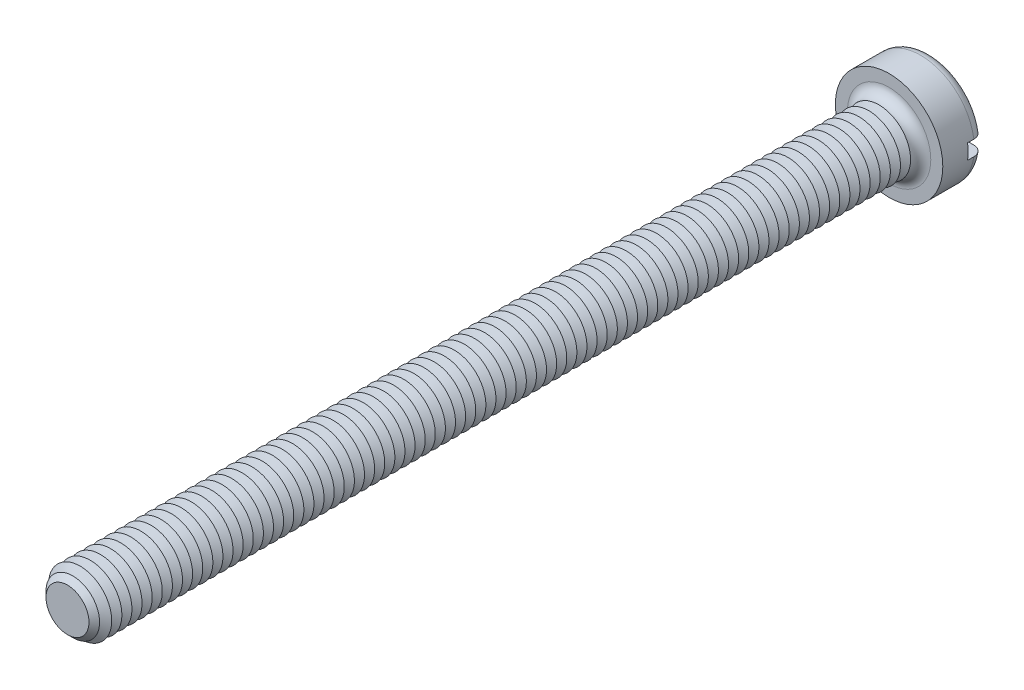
ISO-10303-21;
HEADER;
FILE_DESCRIPTION(('STEP AP214'),'2;1');
FILE_NAME('part.step','',(''),(''),'','','');
FILE_SCHEMA(('AUTOMOTIVE_DESIGN { 1 0 10303 214 1 1 1 1 }'));
ENDSEC;
DATA;
#1=APPLICATION_CONTEXT('core data for automotive mechanical design processes');
#2=APPLICATION_PROTOCOL_DEFINITION('international standard','automotive_design',2000,#1);
#3=PRODUCT_CONTEXT('',#1,'mechanical');
#4=PRODUCT('Part','Part','',(#3));
#5=PRODUCT_RELATED_PRODUCT_CATEGORY('part','',(#4));
#6=PRODUCT_DEFINITION_FORMATION('','',#4);
#7=PRODUCT_DEFINITION_CONTEXT('part definition',#1,'design');
#8=PRODUCT_DEFINITION('design','',#6,#7);
#9=PRODUCT_DEFINITION_SHAPE('','',#8);
#10=(LENGTH_UNIT() NAMED_UNIT(*) SI_UNIT(.MILLI.,.METRE.));
#11=(NAMED_UNIT(*) PLANE_ANGLE_UNIT() SI_UNIT($,.RADIAN.));
#12=(NAMED_UNIT(*) SI_UNIT($,.STERADIAN.) SOLID_ANGLE_UNIT());
#13=UNCERTAINTY_MEASURE_WITH_UNIT(LENGTH_MEASURE(1.E-05),#10,'distance_accuracy_value','');
#14=(GEOMETRIC_REPRESENTATION_CONTEXT(3) GLOBAL_UNCERTAINTY_ASSIGNED_CONTEXT((#13)) GLOBAL_UNIT_ASSIGNED_CONTEXT((#10,
#11,#12)) REPRESENTATION_CONTEXT('',''));
#15=CARTESIAN_POINT('',(0.,0.,0.));
#16=DIRECTION('',(0.,0.,1.));
#17=DIRECTION('',(1.,0.,0.));
#18=AXIS2_PLACEMENT_3D('',#15,#16,#17);
#19=CARTESIAN_POINT('',(0.,0.,-3.3));
#20=DIRECTION('',(0.,0.,1.));
#21=DIRECTION('',(1.,0.,0.));
#22=AXIS2_PLACEMENT_3D('',#19,#20,#21);
#23=PLANE('',#22);
#24=CARTESIAN_POINT('',(0.,0.,-3.3));
#25=DIRECTION('',(0.,0.,1.));
#26=DIRECTION('',(1.,0.,0.));
#27=AXIS2_PLACEMENT_3D('',#24,#25,#26);
#28=CIRCLE('',#27,3.45);
#29=CARTESIAN_POINT('',(-3.39742549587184,0.6,-3.3));
#30=VERTEX_POINT('',#29);
#31=CARTESIAN_POINT('',(3.39742549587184,0.6,-3.3));
#32=VERTEX_POINT('',#31);
#33=EDGE_CURVE('E116',#30,#32,#28,.F.);
#34=ORIENTED_EDGE('',*,*,#33,.T.);
#35=DIRECTION('',(1.,0.,0.));
#36=VECTOR('',#35,1.);
#37=CARTESIAN_POINT('',(-4.25,0.600000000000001,-3.3));
#38=LINE('',#37,#36);
#39=EDGE_CURVE('E111',#30,#32,#38,.T.);
#40=ORIENTED_EDGE('',*,*,#39,.F.);
#41=EDGE_LOOP('',(#34,#40));
#42=FACE_BOUND('',#41,.T.);
#43=ADVANCED_FACE('F39',(#42),#23,.F.);
#44=CARTESIAN_POINT('',(0.,0.,-2.5));
#45=DIRECTION('',(0.,0.,1.));
#46=DIRECTION('',(1.,0.,0.));
#47=AXIS2_PLACEMENT_3D('',#44,#45,#46);
#48=TOROIDAL_SURFACE('',#47,3.45,0.8);
#49=CARTESIAN_POINT('',(-4.06369072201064,0.600000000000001,-2.95537828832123));
#50=CARTESIAN_POINT('',(-4.03774340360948,0.600000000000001,-2.99245078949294));
#51=CARTESIAN_POINT('',(-4.00861849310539,0.600000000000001,-3.02734231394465));
#52=CARTESIAN_POINT('',(-3.94488199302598,0.600000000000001,-3.0917502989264));
#53=CARTESIAN_POINT('',(-3.91026320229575,0.600000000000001,-3.12125959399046));
#54=CARTESIAN_POINT('',(-3.83660561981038,0.600000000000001,-3.17403695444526));
#55=CARTESIAN_POINT('',(-3.79757117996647,0.6,-3.19731109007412));
#56=CARTESIAN_POINT('',(-3.71618817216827,0.6,-3.23703443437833));
#57=CARTESIAN_POINT('',(-3.67384041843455,0.6,-3.25348531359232));
#58=CARTESIAN_POINT('',(-3.58661930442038,0.6,-3.2792758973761));
#59=CARTESIAN_POINT('',(-3.54172669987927,0.6,-3.288550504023));
#60=CARTESIAN_POINT('',(-3.45102322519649,0.6,-3.29952632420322));
#61=CARTESIAN_POINT('',(-3.40521225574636,0.6,-3.30122671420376));
#62=CARTESIAN_POINT('',(-3.31340831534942,0.6,-3.29701196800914));
#63=CARTESIAN_POINT('',(-3.26741940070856,0.6,-3.29100823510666));
#64=CARTESIAN_POINT('',(-3.17708556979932,0.6,-3.27141469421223));
#65=CARTESIAN_POINT('',(-3.13274074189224,0.6,-3.25782447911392));
#66=CARTESIAN_POINT('',(-3.0466814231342,0.6,-3.22332549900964));
#67=CARTESIAN_POINT('',(-3.00498444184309,0.6,-3.20237301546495));
#68=CARTESIAN_POINT('',(-2.92572251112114,0.6,-3.15372961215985));
#69=CARTESIAN_POINT('',(-2.88815755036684,0.6,-3.12603871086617));
#70=CARTESIAN_POINT('',(-2.81847654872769,0.6,-3.06483322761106));
#71=CARTESIAN_POINT('',(-2.78633186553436,0.6,-3.03135128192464));
#72=CARTESIAN_POINT('',(-2.72824805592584,0.6,-2.95937651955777));
#73=CARTESIAN_POINT('',(-2.70230829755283,0.6,-2.92088421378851));
#74=CARTESIAN_POINT('',(-2.65791262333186,0.6,-2.84074227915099));
#75=CARTESIAN_POINT('',(-2.63932560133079,0.6,-2.79916531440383));
#76=CARTESIAN_POINT('',(-2.60958432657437,0.6,-2.7134333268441));
#77=CARTESIAN_POINT('',(-2.59842889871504,0.6,-2.66927871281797));
#78=CARTESIAN_POINT('',(-2.58411140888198,0.6,-2.58073966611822));
#79=CARTESIAN_POINT('',(-2.58077086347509,0.6,-2.5363840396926));
#80=CARTESIAN_POINT('',(-2.58167367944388,0.6,-2.44775208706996));
#81=CARTESIAN_POINT('',(-2.58591644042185,0.6,-2.40347575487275));
#82=CARTESIAN_POINT('',(-2.60175154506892,0.6,-2.31675105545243));
#83=CARTESIAN_POINT('',(-2.61326489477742,0.6,-2.27428821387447));
#84=CARTESIAN_POINT('',(-2.6431863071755,0.6,-2.19186794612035));
#85=CARTESIAN_POINT('',(-2.66159465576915,0.6,-2.15191062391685));
#86=CARTESIAN_POINT('',(-2.70494650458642,0.6,-2.07517696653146));
#87=CARTESIAN_POINT('',(-2.72995486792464,0.6,-2.03843731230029));
#88=CARTESIAN_POINT('',(-2.7856570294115,0.6,-1.96955746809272));
#89=CARTESIAN_POINT('',(-2.81635145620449,0.6,-1.93741778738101));
#90=CARTESIAN_POINT('',(-2.88329572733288,0.6,-1.87788048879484));
#91=CARTESIAN_POINT('',(-2.91965530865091,0.6,-1.85060625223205));
#92=CARTESIAN_POINT('',(-2.9963658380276,0.6,-1.80241044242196));
#93=CARTESIAN_POINT('',(-3.03671721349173,0.6,-1.78148955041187));
#94=CARTESIAN_POINT('',(-3.12111125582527,0.6,-1.74619829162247));
#95=CARTESIAN_POINT('',(-3.16521020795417,0.6,-1.73196239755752));
#96=CARTESIAN_POINT('',(-3.25516487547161,0.6,-1.71103773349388));
#97=CARTESIAN_POINT('',(-3.30102068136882,0.6,-1.70434935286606));
#98=CARTESIAN_POINT('',(-3.39352689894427,0.6,-1.69870104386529));
#99=CARTESIAN_POINT('',(-3.44018061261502,0.6,-1.69979487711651));
#100=CARTESIAN_POINT('',(-3.53263583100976,0.6,-1.70983959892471));
#101=CARTESIAN_POINT('',(-3.57843734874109,0.6,-1.71879036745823));
#102=CARTESIAN_POINT('',(-3.66763544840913,0.6,-1.74426972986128));
#103=CARTESIAN_POINT('',(-3.71104292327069,0.6,-1.76076015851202));
#104=CARTESIAN_POINT('',(-3.79442616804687,0.6,-1.80087686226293));
#105=CARTESIAN_POINT('',(-3.83440212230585,0.600000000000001,-1.82450275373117));
#106=CARTESIAN_POINT('',(-3.90929765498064,0.600000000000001,-1.87793548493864));
#107=CARTESIAN_POINT('',(-3.94426963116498,0.600000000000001,-1.90766887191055));
#108=CARTESIAN_POINT('',(-4.00864839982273,0.600000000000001,-1.9726503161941));
#109=CARTESIAN_POINT('',(-4.03805555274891,0.600000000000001,-2.00789801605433));
#110=CARTESIAN_POINT('',(-4.09009460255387,0.600000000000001,-2.08244463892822));
#111=CARTESIAN_POINT('',(-4.11280448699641,0.600000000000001,-2.12168912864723));
#112=CARTESIAN_POINT('',(-4.15124086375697,0.600000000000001,-2.2034588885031));
#113=CARTESIAN_POINT('',(-4.16696802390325,0.600000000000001,-2.24598384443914));
#114=CARTESIAN_POINT('',(-4.19085131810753,0.600000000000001,-2.33267862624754));
#115=CARTESIAN_POINT('',(-4.19907708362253,0.600000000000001,-2.37682928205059));
#116=CARTESIAN_POINT('',(-4.2079638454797,0.600000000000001,-2.46589754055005));
#117=CARTESIAN_POINT('',(-4.20862315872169,0.600000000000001,-2.51081531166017));
#118=CARTESIAN_POINT('',(-4.20236829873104,0.600000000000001,-2.59993343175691));
#119=CARTESIAN_POINT('',(-4.19548454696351,0.600000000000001,-2.64413593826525));
#120=CARTESIAN_POINT('',(-4.17439924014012,0.600000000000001,-2.73071930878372));
#121=CARTESIAN_POINT('',(-4.16020675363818,0.600000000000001,-2.77310235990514));
#122=CARTESIAN_POINT('',(-4.1318825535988,0.600000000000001,-2.83880495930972));
#123=CARTESIAN_POINT('',(-4.11991183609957,0.600000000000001,-2.86307959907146));
#124=CARTESIAN_POINT('',(-4.09356927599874,0.600000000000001,-2.91028856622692));
#125=CARTESIAN_POINT('',(-4.07919744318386,0.600000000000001,-2.9332228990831));
#126=CARTESIAN_POINT('',(-4.06369072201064,0.600000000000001,-2.95537828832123));
#127=B_SPLINE_CURVE_WITH_KNOTS('',3,(#49,#50,#51,#52,#53,#54,#55,#56,#57,#58,#59,#60,#61,#62,
#63,#64,#65,#66,#67,#68,#69,#70,#71,#72,#73,#74,#75,#76,#77,#78,#79,#80,#81,#82,#83,#84,#85,#86,
#87,#88,#89,#90,#91,#92,#93,#94,#95,#96,#97,#98,#99,#100,#101,#102,#103,#104,#105,#106,#107,
#108,#109,#110,#111,#112,#113,#114,#115,#116,#117,#118,#119,#120,#121,#122,#123,#124,#125,#126),
.UNSPECIFIED.,.T.,.F.,(4,2,2,2,2,2,2,2,2,2,2,2,2,2,2,2,2,2,2,2,2,2,2,2,2,2,2,2,2,2,2,2,2,2,2,2,
2,2,4),(0.,0.13565225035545,0.271483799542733,0.407182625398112,0.542848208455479,
0.679730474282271,0.816627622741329,0.955113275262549,1.09360635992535,1.23293614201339,
1.37226554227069,1.51083389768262,1.64938813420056,1.78534653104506,1.92128342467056,
2.0540840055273,2.18687407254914,2.31824564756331,2.44962267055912,2.58234229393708,
2.71507659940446,2.85080630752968,2.98655056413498,3.12491938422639,3.26329534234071,
3.40262816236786,3.54195885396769,3.68059194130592,3.81921757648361,3.95626453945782,
4.09330262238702,4.2286754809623,4.36403538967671,4.49812564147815,4.63224572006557,
4.76582687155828,4.89924267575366,4.98031194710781,5.0613808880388),.UNSPECIFIED.);
#128=CARTESIAN_POINT('',(-4.20743389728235,0.600000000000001,-2.50000000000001));
#129=VERTEX_POINT('',#128);
#130=EDGE_CURVE('E825',#129,#30,#127,.T.);
#131=ORIENTED_EDGE('',*,*,#130,.F.);
#132=CARTESIAN_POINT('',(0.,0.,-2.5));
#133=DIRECTION('',(0.,0.,1.));
#134=DIRECTION('',(1.,0.,0.));
#135=AXIS2_PLACEMENT_3D('',#132,#133,#134);
#136=CIRCLE('',#135,4.25);
#137=CARTESIAN_POINT('',(4.20743389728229,0.599999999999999,-2.5));
#138=VERTEX_POINT('',#137);
#139=EDGE_CURVE('E125',#138,#129,#136,.T.);
#140=ORIENTED_EDGE('',*,*,#139,.F.);
#141=CARTESIAN_POINT('',(2.63947327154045,0.6,-2.79608831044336));
#142=CARTESIAN_POINT('',(2.65655980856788,0.6,-2.83790320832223));
#143=CARTESIAN_POINT('',(2.67725642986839,0.6,-2.87828303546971));
#144=CARTESIAN_POINT('',(2.72519250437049,0.6,-2.95500233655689));
#145=CARTESIAN_POINT('',(2.75244152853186,0.6,-2.9913357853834));
#146=CARTESIAN_POINT('',(2.81257938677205,0.6,-3.05889430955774));
#147=CARTESIAN_POINT('',(2.84545995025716,0.6,-3.09012674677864));
#148=CARTESIAN_POINT('',(2.91591143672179,0.6,-3.14672620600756));
#149=CARTESIAN_POINT('',(2.95348119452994,0.6,-3.17209468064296));
#150=CARTESIAN_POINT('',(3.03291143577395,0.6,-3.21669611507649));
#151=CARTESIAN_POINT('',(3.07483186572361,0.6,-3.23582234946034));
#152=CARTESIAN_POINT('',(3.16126659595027,0.6,-3.26686062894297));
#153=CARTESIAN_POINT('',(3.2057811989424,0.6,-3.27877183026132));
#154=CARTESIAN_POINT('',(3.29669878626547,0.6,-3.29514603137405));
#155=CARTESIAN_POINT('',(3.34311773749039,0.6,-3.29952056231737));
#156=CARTESIAN_POINT('',(3.43603189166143,0.6,-3.30040472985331));
#157=CARTESIAN_POINT('',(3.48252709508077,0.6,-3.29691431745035));
#158=CARTESIAN_POINT('',(3.57420049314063,0.6,-3.28214240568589));
#159=CARTESIAN_POINT('',(3.61938038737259,0.6,-3.27087147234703));
#160=CARTESIAN_POINT('',(3.70717477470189,0.6,-3.24082890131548));
#161=CARTESIAN_POINT('',(3.74978938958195,0.6,-3.22205762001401));
#162=CARTESIAN_POINT('',(3.83078828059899,0.6,-3.17773607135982));
#163=CARTESIAN_POINT('',(3.86921015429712,0.599999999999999,-3.15225453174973));
#164=CARTESIAN_POINT('',(3.94116038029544,0.599999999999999,-3.09512672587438));
#165=CARTESIAN_POINT('',(3.9746890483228,0.599999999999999,-3.06348085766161));
#166=CARTESIAN_POINT('',(4.03545911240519,0.599999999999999,-2.99534640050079));
#167=CARTESIAN_POINT('',(4.06277344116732,0.599999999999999,-2.95892285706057));
#168=CARTESIAN_POINT('',(4.11082191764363,0.599999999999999,-2.88196698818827));
#169=CARTESIAN_POINT('',(4.13155647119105,0.599999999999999,-2.84143491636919));
#170=CARTESIAN_POINT('',(4.16563480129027,0.599999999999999,-2.75787550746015));
#171=CARTESIAN_POINT('',(4.1790544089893,0.599999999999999,-2.71487908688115));
#172=CARTESIAN_POINT('',(4.19843340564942,0.599999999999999,-2.62723691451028));
#173=CARTESIAN_POINT('',(4.20439310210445,0.599999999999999,-2.58259123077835));
#174=CARTESIAN_POINT('',(4.2086595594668,0.599999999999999,-2.49321831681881));
#175=CARTESIAN_POINT('',(4.20701422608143,0.599999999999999,-2.4484933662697));
#176=CARTESIAN_POINT('',(4.1962295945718,0.599999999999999,-2.35995704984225));
#177=CARTESIAN_POINT('',(4.18709040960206,0.599999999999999,-2.31614567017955));
#178=CARTESIAN_POINT('',(4.16160290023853,0.599999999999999,-2.23072100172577));
#179=CARTESIAN_POINT('',(4.14526169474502,0.599999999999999,-2.18910558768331));
#180=CARTESIAN_POINT('',(4.10585410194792,0.599999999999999,-2.10919238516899));
#181=CARTESIAN_POINT('',(4.08278762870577,0.599999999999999,-2.07089463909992));
#182=CARTESIAN_POINT('',(4.030487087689,0.599999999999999,-1.99851484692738));
#183=CARTESIAN_POINT('',(4.00122628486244,0.599999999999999,-1.9644521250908));
#184=CARTESIAN_POINT('',(3.93744772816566,0.599999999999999,-1.90166877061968));
#185=CARTESIAN_POINT('',(3.90292977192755,0.599999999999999,-1.87294834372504));
#186=CARTESIAN_POINT('',(3.82928727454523,0.599999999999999,-1.82137853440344));
#187=CARTESIAN_POINT('',(3.79012374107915,0.6,-1.79858484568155));
#188=CARTESIAN_POINT('',(3.70856025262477,0.6,-1.75980712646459));
#189=CARTESIAN_POINT('',(3.66616010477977,0.6,-1.74382350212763));
#190=CARTESIAN_POINT('',(3.57878495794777,0.6,-1.71891499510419));
#191=CARTESIAN_POINT('',(3.53378519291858,0.6,-1.71007699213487));
#192=CARTESIAN_POINT('',(3.44294322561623,0.6,-1.69998722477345));
#193=CARTESIAN_POINT('',(3.3971009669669,0.6,-1.69873596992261));
#194=CARTESIAN_POINT('',(3.30531297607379,0.6,-1.70385439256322));
#195=CARTESIAN_POINT('',(3.25937213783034,0.6,-1.71031204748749));
#196=CARTESIAN_POINT('',(3.1692099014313,0.6,-1.73080107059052));
#197=CARTESIAN_POINT('',(3.12498860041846,0.6,-1.74483286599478));
#198=CARTESIAN_POINT('',(3.03926209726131,0.6,-1.78018941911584));
#199=CARTESIAN_POINT('',(2.99777407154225,0.6,-1.80155586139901));
#200=CARTESIAN_POINT('',(2.91899881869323,0.6,-1.85098881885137));
#201=CARTESIAN_POINT('',(2.88171158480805,0.6,-1.8790553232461));
#202=CARTESIAN_POINT('',(2.81266124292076,0.6,-1.94094884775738));
#203=CARTESIAN_POINT('',(2.78086710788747,0.6,-1.97474122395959));
#204=CARTESIAN_POINT('',(2.72353615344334,0.6,-2.0472724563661));
#205=CARTESIAN_POINT('',(2.69799841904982,0.6,-2.08601058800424));
#206=CARTESIAN_POINT('',(2.65444718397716,0.6,-2.16655019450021));
#207=CARTESIAN_POINT('',(2.63629889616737,0.6,-2.20827875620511));
#208=CARTESIAN_POINT('',(2.60744942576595,0.6,-2.29424821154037));
#209=CARTESIAN_POINT('',(2.59674901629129,0.6,-2.33848936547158));
#210=CARTESIAN_POINT('',(2.5833312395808,0.6,-2.42714258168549));
#211=CARTESIAN_POINT('',(2.58043995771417,0.6,-2.47152848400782));
#212=CARTESIAN_POINT('',(2.58224493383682,0.6,-2.56010574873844));
#213=CARTESIAN_POINT('',(2.58693104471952,0.6,-2.60429729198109));
#214=CARTESIAN_POINT('',(2.60020046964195,0.6,-2.67311978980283));
#215=CARTESIAN_POINT('',(2.60635343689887,0.6,-2.69824441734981));
#216=CARTESIAN_POINT('',(2.62110140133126,0.6,-2.74776540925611));
#217=CARTESIAN_POINT('',(2.62969634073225,0.6,-2.77216179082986));
#218=CARTESIAN_POINT('',(2.63947327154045,0.6,-2.79608831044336));
#219=B_SPLINE_CURVE_WITH_KNOTS('',3,(#141,#142,#143,#144,#145,#146,#147,#148,#149,#150,#151,
#152,#153,#154,#155,#156,#157,#158,#159,#160,#161,#162,#163,#164,#165,#166,#167,#168,#169,#170,
#171,#172,#173,#174,#175,#176,#177,#178,#179,#180,#181,#182,#183,#184,#185,#186,#187,#188,#189,
#190,#191,#192,#193,#194,#195,#196,#197,#198,#199,#200,#201,#202,#203,#204,#205,#206,#207,#208,
#209,#210,#211,#212,#213,#214,#215,#216,#217,#218),.UNSPECIFIED.,.T.,.F.,(4,2,2,2,2,2,2,2,2,2,2,
2,2,2,2,2,2,2,2,2,2,2,2,2,2,2,2,2,2,2,2,2,2,2,2,2,2,2,4),(0.,0.135416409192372,
0.271031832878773,0.406449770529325,0.541834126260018,0.679424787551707,0.817031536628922,
0.956242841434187,1.09545501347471,1.23447850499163,1.37349539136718,1.51114036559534,
1.64877645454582,1.78470267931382,1.92062051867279,2.05510117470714,2.1895762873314,
2.32320547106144,2.45683263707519,2.59032801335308,2.72382509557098,2.85791055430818,
2.99200117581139,3.12730969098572,3.26262627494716,3.39956435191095,3.53651162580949,
3.67503685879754,3.81356990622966,3.95290367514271,4.09223721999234,4.23075602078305,
4.36925455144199,4.50509949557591,4.6409585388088,4.77376594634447,4.90639565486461,
4.98388287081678,5.06136825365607),.UNSPECIFIED.);
#220=EDGE_CURVE('E827',#32,#138,#219,.T.);
#221=ORIENTED_EDGE('',*,*,#220,.F.);
#222=ORIENTED_EDGE('',*,*,#33,.F.);
#223=EDGE_LOOP('',(#131,#140,#221,#222));
#224=FACE_BOUND('',#223,.T.);
#225=ADVANCED_FACE('F809',(#224),#48,.T.);
#226=CARTESIAN_POINT('',(0.,0.,-3.3));
#227=DIRECTION('',(0.,0.,1.));
#228=DIRECTION('',(1.,0.,0.));
#229=AXIS2_PLACEMENT_3D('',#226,#227,#228);
#230=CYLINDRICAL_SURFACE('',#229,4.25);
#231=DIRECTION('',(0.,0.,1.));
#232=VECTOR('',#231,1.);
#233=CARTESIAN_POINT('',(4.20743389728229,0.599999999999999,-3.3));
#234=LINE('',#233,#232);
#235=CARTESIAN_POINT('',(4.20743389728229,0.599999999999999,-2.));
#236=VERTEX_POINT('',#235);
#237=EDGE_CURVE('E843',#138,#236,#234,.T.);
#238=ORIENTED_EDGE('',*,*,#237,.F.);
#239=ORIENTED_EDGE('',*,*,#139,.T.);
#240=DIRECTION('',(0.,0.,1.));
#241=VECTOR('',#240,1.);
#242=CARTESIAN_POINT('',(-4.20743389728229,0.600000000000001,-3.3));
#243=LINE('',#242,#241);
#244=CARTESIAN_POINT('',(-4.20743389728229,0.600000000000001,-2.));
#245=VERTEX_POINT('',#244);
#246=EDGE_CURVE('E63',#245,#129,#243,.F.);
#247=ORIENTED_EDGE('',*,*,#246,.F.);
#248=CARTESIAN_POINT('',(0.,0.,-2.));
#249=DIRECTION('',(0.,0.,-1.));
#250=DIRECTION('',(-1.,0.,0.));
#251=AXIS2_PLACEMENT_3D('',#248,#249,#250);
#252=CIRCLE('',#251,4.25);
#253=CARTESIAN_POINT('',(-4.20743389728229,-0.599999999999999,-2.));
#254=VERTEX_POINT('',#253);
#255=EDGE_CURVE('E43',#245,#254,#252,.F.);
#256=ORIENTED_EDGE('',*,*,#255,.T.);
#257=DIRECTION('',(0.,0.,1.));
#258=VECTOR('',#257,1.);
#259=CARTESIAN_POINT('',(-4.20743389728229,-0.599999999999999,-3.3));
#260=LINE('',#259,#258);
#261=CARTESIAN_POINT('',(-4.20743389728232,-0.599999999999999,-2.5));
#262=VERTEX_POINT('',#261);
#263=EDGE_CURVE('E840',#262,#254,#260,.T.);
#264=ORIENTED_EDGE('',*,*,#263,.F.);
#265=CARTESIAN_POINT('',(4.20743389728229,-0.600000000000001,-2.5));
#266=VERTEX_POINT('',#265);
#267=EDGE_CURVE('E127',#262,#266,#136,.T.);
#268=ORIENTED_EDGE('',*,*,#267,.T.);
#269=DIRECTION('',(0.,0.,1.));
#270=VECTOR('',#269,1.);
#271=CARTESIAN_POINT('',(4.20743389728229,-0.600000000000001,-3.3));
#272=LINE('',#271,#270);
#273=CARTESIAN_POINT('',(4.20743389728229,-0.600000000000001,-2.));
#274=VERTEX_POINT('',#273);
#275=EDGE_CURVE('E55',#274,#266,#272,.F.);
#276=ORIENTED_EDGE('',*,*,#275,.F.);
#277=EDGE_CURVE('E11',#274,#236,#252,.F.);
#278=ORIENTED_EDGE('',*,*,#277,.T.);
#279=EDGE_LOOP('',(#238,#239,#247,#256,#264,#268,#276,#278));
#280=FACE_BOUND('',#279,.T.);
#281=CARTESIAN_POINT('',(0.,0.,0.));
#282=DIRECTION('',(0.,0.,1.));
#283=DIRECTION('',(1.,0.,0.));
#284=AXIS2_PLACEMENT_3D('',#281,#282,#283);
#285=CIRCLE('',#284,4.25);
#286=CARTESIAN_POINT('',(4.25,0.,0.));
#287=VERTEX_POINT('',#286);
#288=EDGE_CURVE('E845',#287,#287,#285,.T.);
#289=ORIENTED_EDGE('',*,*,#288,.F.);
#290=EDGE_LOOP('',(#289));
#291=FACE_BOUND('',#290,.T.);
#292=ADVANCED_FACE('F805',(#280,#291),#230,.T.);
#293=CARTESIAN_POINT('',(3.39742549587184,-0.6,-3.3));
#294=VERTEX_POINT('',#293);
#295=CARTESIAN_POINT('',(-3.39742549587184,-0.6,-3.3));
#296=VERTEX_POINT('',#295);
#297=EDGE_CURVE('E109',#294,#296,#28,.F.);
#298=ORIENTED_EDGE('',*,*,#297,.T.);
#299=DIRECTION('',(-1.,0.,0.));
#300=VECTOR('',#299,1.);
#301=CARTESIAN_POINT('',(-4.25,-0.599999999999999,-3.3));
#302=LINE('',#301,#300);
#303=EDGE_CURVE('E96',#294,#296,#302,.T.);
#304=ORIENTED_EDGE('',*,*,#303,.F.);
#305=EDGE_LOOP('',(#298,#304));
#306=FACE_BOUND('',#305,.T.);
#307=ADVANCED_FACE('F108',(#306),#23,.F.);
#308=CARTESIAN_POINT('',(0.,0.,0.));
#309=DIRECTION('',(0.,0.,1.));
#310=DIRECTION('',(1.,0.,0.));
#311=AXIS2_PLACEMENT_3D('',#308,#309,#310);
#312=PLANE('',#311);
#313=CARTESIAN_POINT('',(0.,0.,0.));
#314=DIRECTION('',(0.,0.,1.));
#315=DIRECTION('',(1.,0.,0.));
#316=AXIS2_PLACEMENT_3D('',#313,#314,#315);
#317=CIRCLE('',#316,3.3);
#318=CARTESIAN_POINT('',(3.3,0.,0.));
#319=VERTEX_POINT('',#318);
#320=EDGE_CURVE('E115',#319,#319,#317,.F.);
#321=ORIENTED_EDGE('',*,*,#320,.T.);
#322=EDGE_LOOP('',(#321));
#323=FACE_BOUND('',#322,.T.);
#324=ORIENTED_EDGE('',*,*,#288,.T.);
#325=EDGE_LOOP('',(#324));
#326=FACE_BOUND('',#325,.T.);
#327=ADVANCED_FACE('F804',(#323,#326),#312,.T.);
#328=CARTESIAN_POINT('',(-4.06369072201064,-0.599999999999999,-2.95537828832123));
#329=CARTESIAN_POINT('',(-4.08928577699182,-0.599999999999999,-2.91880204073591));
#330=CARTESIAN_POINT('',(-4.11182555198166,-0.599999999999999,-2.88005030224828));
#331=CARTESIAN_POINT('',(-4.15010404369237,-0.599999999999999,-2.79928452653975));
#332=CARTESIAN_POINT('',(-4.16583526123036,-0.599999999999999,-2.75726695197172));
#333=CARTESIAN_POINT('',(-4.19000286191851,-0.599999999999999,-2.67118996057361));
#334=CARTESIAN_POINT('',(-4.19844101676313,-0.599999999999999,-2.62713104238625));
#335=CARTESIAN_POINT('',(-4.20777174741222,-0.599999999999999,-2.53823222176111));
#336=CARTESIAN_POINT('',(-4.20866608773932,-0.599999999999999,-2.49339250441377));
#337=CARTESIAN_POINT('',(-4.20289683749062,-0.599999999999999,-2.40433856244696));
#338=CARTESIAN_POINT('',(-4.19625607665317,-0.599999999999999,-2.36012285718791));
#339=CARTESIAN_POINT('',(-4.17565084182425,-0.599999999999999,-2.27343166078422));
#340=CARTESIAN_POINT('',(-4.16168615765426,-0.599999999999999,-2.23095621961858));
#341=CARTESIAN_POINT('',(-4.12683188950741,-0.599999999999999,-2.14890863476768));
#342=CARTESIAN_POINT('',(-4.10593663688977,-0.599999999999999,-2.10933890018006));
#343=CARTESIAN_POINT('',(-4.05783763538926,-0.599999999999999,-2.03424145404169));
#344=CARTESIAN_POINT('',(-4.03063375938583,-0.599999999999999,-1.99871382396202));
#345=CARTESIAN_POINT('',(-3.97052236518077,-0.599999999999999,-1.93246905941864));
#346=CARTESIAN_POINT('',(-3.93758114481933,-0.599999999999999,-1.90178251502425));
#347=CARTESIAN_POINT('',(-3.86706007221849,-0.599999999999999,-1.84630837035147));
#348=CARTESIAN_POINT('',(-3.82948001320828,-0.6,-1.82152103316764));
#349=CARTESIAN_POINT('',(-3.75033766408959,-0.6,-1.77826995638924));
#350=CARTESIAN_POINT('',(-3.70873831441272,-0.6,-1.7598740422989));
#351=CARTESIAN_POINT('',(-3.62306661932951,-0.6,-1.73023196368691));
#352=CARTESIAN_POINT('',(-3.57899411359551,-0.6,-1.71898626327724));
#353=CARTESIAN_POINT('',(-3.48904845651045,-0.6,-1.70382025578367));
#354=CARTESIAN_POINT('',(-3.44315982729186,-0.6,-1.69999172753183));
#355=CARTESIAN_POINT('',(-3.35138360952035,-0.6,-1.7000083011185));
#356=CARTESIAN_POINT('',(-3.30549602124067,-0.6,-1.70385391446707));
#357=CARTESIAN_POINT('',(-3.21452492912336,-0.6,-1.71917227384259));
#358=CARTESIAN_POINT('',(-3.16945455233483,-0.6,-1.73072307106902));
#359=CARTESIAN_POINT('',(-3.08188104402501,-0.6,-1.76120640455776));
#360=CARTESIAN_POINT('',(-3.0393780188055,-0.6,-1.78013924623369));
#361=CARTESIAN_POINT('',(-2.95805296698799,-0.6,-1.82493384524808));
#362=CARTESIAN_POINT('',(-2.9192403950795,-0.6,-1.85081278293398));
#363=CARTESIAN_POINT('',(-2.84656695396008,-0.6,-1.90878317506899));
#364=CARTESIAN_POINT('',(-2.81270591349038,-0.6,-1.94087441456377));
#365=CARTESIAN_POINT('',(-2.75131050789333,-0.6,-2.01002500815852));
#366=CARTESIAN_POINT('',(-2.72371339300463,-0.6,-2.04702860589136));
#367=CARTESIAN_POINT('',(-2.67528742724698,-0.6,-2.12522869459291));
#368=CARTESIAN_POINT('',(-2.65445765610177,-0.6,-2.1664246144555));
#369=CARTESIAN_POINT('',(-2.62065354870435,-0.6,-2.25087266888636));
#370=CARTESIAN_POINT('',(-2.60751663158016,-0.6,-2.29405971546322));
#371=CARTESIAN_POINT('',(-2.58885106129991,-0.6,-2.38204659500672));
#372=CARTESIAN_POINT('',(-2.58332131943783,-0.6,-2.42684619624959));
#373=CARTESIAN_POINT('',(-2.58009777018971,-0.6,-2.51580379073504));
#374=CARTESIAN_POINT('',(-2.58224575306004,-0.6,-2.55995612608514));
#375=CARTESIAN_POINT('',(-2.59395205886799,-0.6,-2.64726495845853));
#376=CARTESIAN_POINT('',(-2.60351013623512,-0.6,-2.69042148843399));
#377=CARTESIAN_POINT('',(-2.62967159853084,-0.6,-2.77438771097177));
#378=CARTESIAN_POINT('',(-2.64625243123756,-0.6,-2.81520444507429));
#379=CARTESIAN_POINT('',(-2.68592348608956,-0.6,-2.89353901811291));
#380=CARTESIAN_POINT('',(-2.70901418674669,-0.6,-2.9310566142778));
#381=CARTESIAN_POINT('',(-2.7614318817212,-0.6,-3.00240040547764));
#382=CARTESIAN_POINT('',(-2.79085487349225,-0.6,-3.03615603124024));
#383=CARTESIAN_POINT('',(-2.85483456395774,-0.6,-3.09838834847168));
#384=CARTESIAN_POINT('',(-2.88939187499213,-0.6,-3.12686440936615));
#385=CARTESIAN_POINT('',(-2.96351967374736,-0.6,-3.17841283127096));
#386=CARTESIAN_POINT('',(-3.00318741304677,-0.6,-3.20134539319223));
#387=CARTESIAN_POINT('',(-3.08576649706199,-0.6,-3.24034364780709));
#388=CARTESIAN_POINT('',(-3.12867814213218,-0.6,-3.25640870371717));
#389=CARTESIAN_POINT('',(-3.21724048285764,-0.6,-3.28143816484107));
#390=CARTESIAN_POINT('',(-3.26292314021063,-0.6,-3.29028963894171));
#391=CARTESIAN_POINT('',(-3.35512527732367,-0.6,-3.30021681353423));
#392=CARTESIAN_POINT('',(-3.40164474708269,-0.6,-3.30129260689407));
#393=CARTESIAN_POINT('',(-3.49429978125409,-0.6,-3.29560589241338));
#394=CARTESIAN_POINT('',(-3.54043436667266,-0.6,-3.28882735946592));
#395=CARTESIAN_POINT('',(-3.63090382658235,-0.6,-3.26755492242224));
#396=CARTESIAN_POINT('',(-3.67523831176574,-0.6,-3.25305935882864));
#397=CARTESIAN_POINT('',(-3.76046509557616,-0.6,-3.21686867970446));
#398=CARTESIAN_POINT('',(-3.80138087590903,-0.599999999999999,-3.1952288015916));
#399=CARTESIAN_POINT('',(-3.8788986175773,-0.599999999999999,-3.14531817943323));
#400=CARTESIAN_POINT('',(-3.91550599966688,-0.599999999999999,-3.11705590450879));
#401=CARTESIAN_POINT('',(-3.97074313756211,-0.599999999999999,-3.06628809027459));
#402=CARTESIAN_POINT('',(-3.99100743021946,-0.599999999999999,-3.04553102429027));
#403=CARTESIAN_POINT('',(-4.02917385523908,-0.599999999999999,-3.00194762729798));
#404=CARTESIAN_POINT('',(-4.04707600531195,-0.599999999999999,-2.97912131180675));
#405=CARTESIAN_POINT('',(-4.06369072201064,-0.599999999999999,-2.95537828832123));
#406=B_SPLINE_CURVE_WITH_KNOTS('',3,(#328,#329,#330,#331,#332,#333,#334,#335,#336,#337,#338,
#339,#340,#341,#342,#343,#344,#345,#346,#347,#348,#349,#350,#351,#352,#353,#354,#355,#356,#357,
#358,#359,#360,#361,#362,#363,#364,#365,#366,#367,#368,#369,#370,#371,#372,#373,#374,#375,#376,
#377,#378,#379,#380,#381,#382,#383,#384,#385,#386,#387,#388,#389,#390,#391,#392,#393,#394,#395,
#396,#397,#398,#399,#400,#401,#402,#403,#404,#405),.UNSPECIFIED.,.T.,.F.,(4,2,2,2,2,2,2,2,2,2,2,
2,2,2,2,2,2,2,2,2,2,2,2,2,2,2,2,2,2,2,2,2,2,2,2,2,2,2,4),(0.,0.133821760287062,
0.267790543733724,0.401726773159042,0.535631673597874,0.669131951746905,0.802636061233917,
0.936249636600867,1.06986590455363,1.2042952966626,1.3387306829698,1.47455198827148,
1.61038210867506,1.74788249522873,1.88539204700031,2.02431612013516,2.16324594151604,
2.30252260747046,2.4417944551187,2.57960263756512,2.71739207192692,2.85215325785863,
2.98689515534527,3.11887666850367,3.25085380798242,3.38241030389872,3.51397647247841,
3.64769871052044,3.78143690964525,3.91826005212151,4.05509587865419,4.19403485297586,
4.33297216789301,4.47219345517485,4.61144469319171,4.74964356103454,4.887666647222,
4.97453605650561,5.06140481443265),.UNSPECIFIED.);
#407=EDGE_CURVE('E103',#296,#262,#406,.T.);
#408=ORIENTED_EDGE('',*,*,#407,.F.);
#409=ORIENTED_EDGE('',*,*,#297,.F.);
#410=CARTESIAN_POINT('',(2.63947327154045,-0.6,-2.79608831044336));
#411=CARTESIAN_POINT('',(2.62285766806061,-0.6,-2.75541510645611));
#412=CARTESIAN_POINT('',(2.60963282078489,-0.6,-2.71332585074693));
#413=CARTESIAN_POINT('',(2.59042394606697,-0.6,-2.62749460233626));
#414=CARTESIAN_POINT('',(2.58444686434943,-0.6,-2.58375106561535));
#415=CARTESIAN_POINT('',(2.57995287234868,-0.6,-2.49588524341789));
#416=CARTESIAN_POINT('',(2.58143477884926,-0.6,-2.45176301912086));
#417=CARTESIAN_POINT('',(2.59180622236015,-0.6,-2.36440906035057));
#418=CARTESIAN_POINT('',(2.60069434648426,-0.6,-2.32117715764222));
#419=CARTESIAN_POINT('',(2.62554964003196,-0.6,-2.23689909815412));
#420=CARTESIAN_POINT('',(2.6415022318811,-0.6,-2.19584863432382));
#421=CARTESIAN_POINT('',(2.67996913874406,-0.6,-2.11694797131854));
#422=CARTESIAN_POINT('',(2.70248409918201,-0.6,-2.07909808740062));
#423=CARTESIAN_POINT('',(2.75378972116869,-0.6,-2.00702296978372));
#424=CARTESIAN_POINT('',(2.7826732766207,-0.6,-1.97286389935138));
#425=CARTESIAN_POINT('',(2.84564717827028,-0.6,-1.90974167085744));
#426=CARTESIAN_POINT('',(2.87973812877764,-0.6,-1.88077911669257));
#427=CARTESIAN_POINT('',(2.95300941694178,-0.6,-1.82817307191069));
#428=CARTESIAN_POINT('',(2.99228920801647,-0.6,-1.8046680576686));
#429=CARTESIAN_POINT('',(3.07419050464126,-0.6,-1.76446470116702));
#430=CARTESIAN_POINT('',(3.11681231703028,-0.6,-1.74776698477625));
#431=CARTESIAN_POINT('',(3.20492149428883,-0.6,-1.72140945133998));
#432=CARTESIAN_POINT('',(3.25044365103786,-0.6,-1.71186578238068));
#433=CARTESIAN_POINT('',(3.34244451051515,-0.6,-1.70053183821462));
#434=CARTESIAN_POINT('',(3.38892324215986,-0.6,-1.69874179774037));
#435=CARTESIAN_POINT('',(3.48165030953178,-0.6,-1.70299737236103));
#436=CARTESIAN_POINT('',(3.52789766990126,-0.6,-1.70906439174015));
#437=CARTESIAN_POINT('',(3.61869999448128,-0.6,-1.72893768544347));
#438=CARTESIAN_POINT('',(3.6632550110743,-0.6,-1.742743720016));
#439=CARTESIAN_POINT('',(3.7490339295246,-0.6,-1.77760539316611));
#440=CARTESIAN_POINT('',(3.79028083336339,-0.600000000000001,-1.79860440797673));
#441=CARTESIAN_POINT('',(3.86860401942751,-0.600000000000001,-1.84731105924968));
#442=CARTESIAN_POINT('',(3.90568056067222,-0.600000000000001,-1.87501827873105));
#443=CARTESIAN_POINT('',(3.97412845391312,-0.600000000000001,-1.93599408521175));
#444=CARTESIAN_POINT('',(4.00556369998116,-0.600000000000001,-1.96919094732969));
#445=CARTESIAN_POINT('',(4.06233546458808,-0.600000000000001,-2.0404445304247));
#446=CARTESIAN_POINT('',(4.08767237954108,-0.600000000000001,-2.07850093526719));
#447=CARTESIAN_POINT('',(4.13122502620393,-0.600000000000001,-2.15791791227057));
#448=CARTESIAN_POINT('',(4.14951966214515,-0.600000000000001,-2.19923522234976));
#449=CARTESIAN_POINT('',(4.17884974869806,-0.600000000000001,-2.28437065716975));
#450=CARTESIAN_POINT('',(4.18988555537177,-0.600000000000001,-2.32818865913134));
#451=CARTESIAN_POINT('',(4.20430724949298,-0.600000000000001,-2.41670951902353));
#452=CARTESIAN_POINT('',(4.2077528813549,-0.600000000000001,-2.46140265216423));
#453=CARTESIAN_POINT('',(4.20706844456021,-0.600000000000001,-2.55073028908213));
#454=CARTESIAN_POINT('',(4.20293856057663,-0.600000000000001,-2.595364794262));
#455=CARTESIAN_POINT('',(4.18724926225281,-0.600000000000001,-2.68317733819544));
#456=CARTESIAN_POINT('',(4.17571081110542,-0.600000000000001,-2.72635912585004));
#457=CARTESIAN_POINT('',(4.14556645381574,-0.600000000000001,-2.81017999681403));
#458=CARTESIAN_POINT('',(4.12696052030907,-0.600000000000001,-2.85081907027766));
#459=CARTESIAN_POINT('',(4.08317014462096,-0.600000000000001,-2.92852328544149));
#460=CARTESIAN_POINT('',(4.0579684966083,-0.600000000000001,-2.96557872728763));
#461=CARTESIAN_POINT('',(4.00174565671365,-0.600000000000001,-3.034972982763));
#462=CARTESIAN_POINT('',(3.97072429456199,-0.600000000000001,-3.06731165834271));
#463=CARTESIAN_POINT('',(3.90349659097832,-0.600000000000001,-3.12662735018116));
#464=CARTESIAN_POINT('',(3.86725240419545,-0.600000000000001,-3.15356146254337));
#465=CARTESIAN_POINT('',(3.79079809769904,-0.600000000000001,-3.20104156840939));
#466=CARTESIAN_POINT('',(3.75058775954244,-0.6,-3.22158720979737));
#467=CARTESIAN_POINT('',(3.6668595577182,-0.6,-3.25595832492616));
#468=CARTESIAN_POINT('',(3.62330947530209,-0.6,-3.26970530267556));
#469=CARTESIAN_POINT('',(3.53453348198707,-0.6,-3.28979004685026));
#470=CARTESIAN_POINT('',(3.48930745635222,-0.6,-3.29612730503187));
#471=CARTESIAN_POINT('',(3.39787506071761,-0.6,-3.30128612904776));
#472=CARTESIAN_POINT('',(3.35166346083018,-0.6,-3.30001513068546));
#473=CARTESIAN_POINT('',(3.26009663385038,-0.6,-3.28980210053));
#474=CARTESIAN_POINT('',(3.21474142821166,-0.6,-3.28085987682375));
#475=CARTESIAN_POINT('',(3.12577990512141,-0.6,-3.2554540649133));
#476=CARTESIAN_POINT('',(3.08219120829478,-0.6,-3.23892872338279));
#477=CARTESIAN_POINT('',(2.99839730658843,-0.6,-3.1987810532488));
#478=CARTESIAN_POINT('',(2.95819301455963,-0.6,-3.17515681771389));
#479=CARTESIAN_POINT('',(2.88239372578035,-0.6,-3.12147666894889));
#480=CARTESIAN_POINT('',(2.84679445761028,-0.6,-3.09142678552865));
#481=CARTESIAN_POINT('',(2.78127483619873,-0.6,-3.02571584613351));
#482=CARTESIAN_POINT('',(2.75134725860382,-0.6,-2.99006203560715));
#483=CARTESIAN_POINT('',(2.70767232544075,-0.6,-2.92780516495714));
#484=CARTESIAN_POINT('',(2.69197340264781,-0.6,-2.90254809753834));
#485=CARTESIAN_POINT('',(2.66349078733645,-0.6,-2.8504392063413));
#486=CARTESIAN_POINT('',(2.65070705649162,-0.6,-2.82358740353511));
#487=CARTESIAN_POINT('',(2.63947327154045,-0.6,-2.79608831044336));
#488=B_SPLINE_CURVE_WITH_KNOTS('',3,(#410,#411,#412,#413,#414,#415,#416,#417,#418,#419,#420,
#421,#422,#423,#424,#425,#426,#427,#428,#429,#430,#431,#432,#433,#434,#435,#436,#437,#438,#439,
#440,#441,#442,#443,#444,#445,#446,#447,#448,#449,#450,#451,#452,#453,#454,#455,#456,#457,#458,
#459,#460,#461,#462,#463,#464,#465,#466,#467,#468,#469,#470,#471,#472,#473,#474,#475,#476,#477,
#478,#479,#480,#481,#482,#483,#484,#485,#486,#487),.UNSPECIFIED.,.T.,.F.,(4,2,2,2,2,2,2,2,2,2,2,
2,2,2,2,2,2,2,2,2,2,2,2,2,2,2,2,2,2,2,2,2,2,2,2,2,2,2,4),(0.,0.131701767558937,
0.263529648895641,0.395336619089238,0.527118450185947,0.658629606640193,0.790153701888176,
0.923740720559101,1.05734325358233,1.19403504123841,1.33073939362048,1.46961778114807,
1.60850037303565,1.74776210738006,1.88701952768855,2.02520497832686,2.16338184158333,
2.29987843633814,2.43636615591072,2.57127672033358,2.7061806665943,2.84001889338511,
2.97385385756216,3.1073117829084,3.24077022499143,3.37458034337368,3.50839437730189,
3.64323196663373,3.77807698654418,3.91444452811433,4.05082142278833,4.18886086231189,
4.32690375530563,4.46609131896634,4.60531630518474,4.74441121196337,4.88332773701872,
4.97237227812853,5.06141564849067),.UNSPECIFIED.);
#489=EDGE_CURVE('E92',#266,#294,#488,.T.);
#490=ORIENTED_EDGE('',*,*,#489,.F.);
#491=ORIENTED_EDGE('',*,*,#267,.F.);
#492=EDGE_LOOP('',(#408,#409,#490,#491));
#493=FACE_BOUND('',#492,.T.);
#494=ADVANCED_FACE('F113',(#493),#48,.T.);
#495=CARTESIAN_POINT('',(0.,0.,0.799999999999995));
#496=DIRECTION('',(0.,0.,1.));
#497=DIRECTION('',(1.,0.,0.));
#498=AXIS2_PLACEMENT_3D('',#495,#496,#497);
#499=TOROIDAL_SURFACE('',#498,3.3,0.8);
#500=ORIENTED_EDGE('',*,*,#320,.F.);
#501=EDGE_LOOP('',(#500));
#502=FACE_BOUND('',#501,.T.);
#503=CARTESIAN_POINT('',(0.,0.,0.800000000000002));
#504=DIRECTION('',(0.,0.,-1.));
#505=DIRECTION('',(-1.,0.,0.));
#506=AXIS2_PLACEMENT_3D('',#503,#504,#505);
#507=CIRCLE('',#506,2.5);
#508=CARTESIAN_POINT('',(-2.5,0.,0.800000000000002));
#509=VERTEX_POINT('',#508);
#510=EDGE_CURVE('E850',#509,#509,#507,.T.);
#511=ORIENTED_EDGE('',*,*,#510,.T.);
#512=EDGE_LOOP('',(#511));
#513=FACE_BOUND('',#512,.T.);
#514=ADVANCED_FACE('F797',(#502,#513),#499,.F.);
#515=CARTESIAN_POINT('',(0.,0.,1.2));
#516=DIRECTION('',(0.,0.,-1.));
#517=DIRECTION('',(-1.,0.,0.));
#518=AXIS2_PLACEMENT_3D('',#515,#516,#517);
#519=CONICAL_SURFACE('',#518,1.80717967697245,1.0471975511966);
#520=ORIENTED_EDGE('',*,*,#510,.F.);
#521=EDGE_LOOP('',(#520));
#522=FACE_BOUND('',#521,.T.);
#523=CARTESIAN_POINT('',(0.,0.,1.2));
#524=DIRECTION('',(0.,0.,-1.));
#525=DIRECTION('',(-1.,0.,0.));
#526=AXIS2_PLACEMENT_3D('',#523,#524,#525);
#527=CIRCLE('',#526,1.80717967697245);
#528=CARTESIAN_POINT('',(-1.80717967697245,0.,1.2));
#529=VERTEX_POINT('',#528);
#530=EDGE_CURVE('E856',#529,#529,#527,.T.);
#531=ORIENTED_EDGE('',*,*,#530,.T.);
#532=EDGE_LOOP('',(#531));
#533=FACE_BOUND('',#532,.T.);
#534=ADVANCED_FACE('F793',(#522,#533),#519,.T.);
#535=CARTESIAN_POINT('',(0.,0.,1.6));
#536=DIRECTION('',(0.,0.,1.));
#537=DIRECTION('',(1.,0.,0.));
#538=AXIS2_PLACEMENT_3D('',#535,#536,#537);
#539=CONICAL_SURFACE('',#538,2.5,1.0471975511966);
#540=ORIENTED_EDGE('',*,*,#530,.F.);
#541=EDGE_LOOP('',(#540));
#542=FACE_BOUND('',#541,.T.);
#543=CARTESIAN_POINT('',(0.,0.,1.6));
#544=DIRECTION('',(0.,0.,-1.));
#545=DIRECTION('',(-1.,0.,0.));
#546=AXIS2_PLACEMENT_3D('',#543,#544,#545);
#547=CIRCLE('',#546,2.5);
#548=CARTESIAN_POINT('',(-2.5,0.,1.6));
#549=VERTEX_POINT('',#548);
#550=EDGE_CURVE('E862',#549,#549,#547,.T.);
#551=ORIENTED_EDGE('',*,*,#550,.T.);
#552=EDGE_LOOP('',(#551));
#553=FACE_BOUND('',#552,.T.);
#554=ADVANCED_FACE('F789',(#542,#553),#539,.T.);
#555=CARTESIAN_POINT('',(0.,0.,2.));
#556=DIRECTION('',(0.,0.,-1.));
#557=DIRECTION('',(-1.,0.,0.));
#558=AXIS2_PLACEMENT_3D('',#555,#556,#557);
#559=CONICAL_SURFACE('',#558,1.80717967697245,1.0471975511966);
#560=ORIENTED_EDGE('',*,*,#550,.F.);
#561=EDGE_LOOP('',(#560));
#562=FACE_BOUND('',#561,.T.);
#563=CARTESIAN_POINT('',(0.,0.,2.));
#564=DIRECTION('',(0.,0.,-1.));
#565=DIRECTION('',(-1.,0.,0.));
#566=AXIS2_PLACEMENT_3D('',#563,#564,#565);
#567=CIRCLE('',#566,1.80717967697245);
#568=CARTESIAN_POINT('',(-1.80717967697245,0.,2.));
#569=VERTEX_POINT('',#568);
#570=EDGE_CURVE('E866',#569,#569,#567,.T.);
#571=ORIENTED_EDGE('',*,*,#570,.T.);
#572=EDGE_LOOP('',(#571));
#573=FACE_BOUND('',#572,.T.);
#574=ADVANCED_FACE('F785',(#562,#573),#559,.T.);
#575=CARTESIAN_POINT('',(0.,0.,2.4));
#576=DIRECTION('',(0.,0.,1.));
#577=DIRECTION('',(1.,0.,0.));
#578=AXIS2_PLACEMENT_3D('',#575,#576,#577);
#579=CONICAL_SURFACE('',#578,2.5,1.0471975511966);
#580=ORIENTED_EDGE('',*,*,#570,.F.);
#581=EDGE_LOOP('',(#580));
#582=FACE_BOUND('',#581,.T.);
#583=CARTESIAN_POINT('',(0.,0.,2.4));
#584=DIRECTION('',(0.,0.,-1.));
#585=DIRECTION('',(-1.,0.,0.));
#586=AXIS2_PLACEMENT_3D('',#583,#584,#585);
#587=CIRCLE('',#586,2.5);
#588=CARTESIAN_POINT('',(-2.5,0.,2.4));
#589=VERTEX_POINT('',#588);
#590=EDGE_CURVE('E870',#589,#589,#587,.T.);
#591=ORIENTED_EDGE('',*,*,#590,.T.);
#592=EDGE_LOOP('',(#591));
#593=FACE_BOUND('',#592,.T.);
#594=ADVANCED_FACE('F781',(#582,#593),#579,.T.);
#595=CARTESIAN_POINT('',(0.,0.,2.8));
#596=DIRECTION('',(0.,0.,-1.));
#597=DIRECTION('',(-1.,0.,0.));
#598=AXIS2_PLACEMENT_3D('',#595,#596,#597);
#599=CONICAL_SURFACE('',#598,1.80717967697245,1.0471975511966);
#600=ORIENTED_EDGE('',*,*,#590,.F.);
#601=EDGE_LOOP('',(#600));
#602=FACE_BOUND('',#601,.T.);
#603=CARTESIAN_POINT('',(0.,0.,2.8));
#604=DIRECTION('',(0.,0.,-1.));
#605=DIRECTION('',(-1.,0.,0.));
#606=AXIS2_PLACEMENT_3D('',#603,#604,#605);
#607=CIRCLE('',#606,1.80717967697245);
#608=CARTESIAN_POINT('',(-1.80717967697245,0.,2.8));
#609=VERTEX_POINT('',#608);
#610=EDGE_CURVE('E874',#609,#609,#607,.T.);
#611=ORIENTED_EDGE('',*,*,#610,.T.);
#612=EDGE_LOOP('',(#611));
#613=FACE_BOUND('',#612,.T.);
#614=ADVANCED_FACE('F777',(#602,#613),#599,.T.);
#615=CARTESIAN_POINT('',(0.,0.,3.2));
#616=DIRECTION('',(0.,0.,1.));
#617=DIRECTION('',(1.,0.,0.));
#618=AXIS2_PLACEMENT_3D('',#615,#616,#617);
#619=CONICAL_SURFACE('',#618,2.5,1.0471975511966);
#620=ORIENTED_EDGE('',*,*,#610,.F.);
#621=EDGE_LOOP('',(#620));
#622=FACE_BOUND('',#621,.T.);
#623=CARTESIAN_POINT('',(0.,0.,3.2));
#624=DIRECTION('',(0.,0.,-1.));
#625=DIRECTION('',(-1.,0.,0.));
#626=AXIS2_PLACEMENT_3D('',#623,#624,#625);
#627=CIRCLE('',#626,2.5);
#628=CARTESIAN_POINT('',(-2.5,0.,3.2));
#629=VERTEX_POINT('',#628);
#630=EDGE_CURVE('E878',#629,#629,#627,.T.);
#631=ORIENTED_EDGE('',*,*,#630,.T.);
#632=EDGE_LOOP('',(#631));
#633=FACE_BOUND('',#632,.T.);
#634=ADVANCED_FACE('F773',(#622,#633),#619,.T.);
#635=CARTESIAN_POINT('',(0.,0.,3.6));
#636=DIRECTION('',(0.,0.,-1.));
#637=DIRECTION('',(-1.,0.,0.));
#638=AXIS2_PLACEMENT_3D('',#635,#636,#637);
#639=CONICAL_SURFACE('',#638,1.80717967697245,1.0471975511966);
#640=ORIENTED_EDGE('',*,*,#630,.F.);
#641=EDGE_LOOP('',(#640));
#642=FACE_BOUND('',#641,.T.);
#643=CARTESIAN_POINT('',(0.,0.,3.6));
#644=DIRECTION('',(0.,0.,-1.));
#645=DIRECTION('',(-1.,0.,0.));
#646=AXIS2_PLACEMENT_3D('',#643,#644,#645);
#647=CIRCLE('',#646,1.80717967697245);
#648=CARTESIAN_POINT('',(-1.80717967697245,0.,3.6));
#649=VERTEX_POINT('',#648);
#650=EDGE_CURVE('E882',#649,#649,#647,.T.);
#651=ORIENTED_EDGE('',*,*,#650,.T.);
#652=EDGE_LOOP('',(#651));
#653=FACE_BOUND('',#652,.T.);
#654=ADVANCED_FACE('F769',(#642,#653),#639,.T.);
#655=CARTESIAN_POINT('',(0.,0.,4.));
#656=DIRECTION('',(0.,0.,1.));
#657=DIRECTION('',(1.,0.,0.));
#658=AXIS2_PLACEMENT_3D('',#655,#656,#657);
#659=CONICAL_SURFACE('',#658,2.5,1.0471975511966);
#660=ORIENTED_EDGE('',*,*,#650,.F.);
#661=EDGE_LOOP('',(#660));
#662=FACE_BOUND('',#661,.T.);
#663=CARTESIAN_POINT('',(0.,0.,4.));
#664=DIRECTION('',(0.,0.,-1.));
#665=DIRECTION('',(-1.,0.,0.));
#666=AXIS2_PLACEMENT_3D('',#663,#664,#665);
#667=CIRCLE('',#666,2.5);
#668=CARTESIAN_POINT('',(-2.5,0.,4.));
#669=VERTEX_POINT('',#668);
#670=EDGE_CURVE('E886',#669,#669,#667,.T.);
#671=ORIENTED_EDGE('',*,*,#670,.T.);
#672=EDGE_LOOP('',(#671));
#673=FACE_BOUND('',#672,.T.);
#674=ADVANCED_FACE('F765',(#662,#673),#659,.T.);
#675=CARTESIAN_POINT('',(0.,0.,4.4));
#676=DIRECTION('',(0.,0.,-1.));
#677=DIRECTION('',(-1.,0.,0.));
#678=AXIS2_PLACEMENT_3D('',#675,#676,#677);
#679=CONICAL_SURFACE('',#678,1.80717967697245,1.0471975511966);
#680=ORIENTED_EDGE('',*,*,#670,.F.);
#681=EDGE_LOOP('',(#680));
#682=FACE_BOUND('',#681,.T.);
#683=CARTESIAN_POINT('',(0.,0.,4.4));
#684=DIRECTION('',(0.,0.,-1.));
#685=DIRECTION('',(-1.,0.,0.));
#686=AXIS2_PLACEMENT_3D('',#683,#684,#685);
#687=CIRCLE('',#686,1.80717967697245);
#688=CARTESIAN_POINT('',(-1.80717967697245,0.,4.4));
#689=VERTEX_POINT('',#688);
#690=EDGE_CURVE('E890',#689,#689,#687,.T.);
#691=ORIENTED_EDGE('',*,*,#690,.T.);
#692=EDGE_LOOP('',(#691));
#693=FACE_BOUND('',#692,.T.);
#694=ADVANCED_FACE('F761',(#682,#693),#679,.T.);
#695=CARTESIAN_POINT('',(0.,0.,4.8));
#696=DIRECTION('',(0.,0.,1.));
#697=DIRECTION('',(1.,0.,0.));
#698=AXIS2_PLACEMENT_3D('',#695,#696,#697);
#699=CONICAL_SURFACE('',#698,2.5,1.0471975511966);
#700=ORIENTED_EDGE('',*,*,#690,.F.);
#701=EDGE_LOOP('',(#700));
#702=FACE_BOUND('',#701,.T.);
#703=CARTESIAN_POINT('',(0.,0.,4.8));
#704=DIRECTION('',(0.,0.,-1.));
#705=DIRECTION('',(-1.,0.,0.));
#706=AXIS2_PLACEMENT_3D('',#703,#704,#705);
#707=CIRCLE('',#706,2.5);
#708=CARTESIAN_POINT('',(-2.5,0.,4.8));
#709=VERTEX_POINT('',#708);
#710=EDGE_CURVE('E894',#709,#709,#707,.T.);
#711=ORIENTED_EDGE('',*,*,#710,.T.);
#712=EDGE_LOOP('',(#711));
#713=FACE_BOUND('',#712,.T.);
#714=ADVANCED_FACE('F757',(#702,#713),#699,.T.);
#715=CARTESIAN_POINT('',(0.,0.,5.2));
#716=DIRECTION('',(0.,0.,-1.));
#717=DIRECTION('',(-1.,0.,0.));
#718=AXIS2_PLACEMENT_3D('',#715,#716,#717);
#719=CONICAL_SURFACE('',#718,1.80717967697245,1.0471975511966);
#720=ORIENTED_EDGE('',*,*,#710,.F.);
#721=EDGE_LOOP('',(#720));
#722=FACE_BOUND('',#721,.T.);
#723=CARTESIAN_POINT('',(0.,0.,5.2));
#724=DIRECTION('',(0.,0.,-1.));
#725=DIRECTION('',(-1.,0.,0.));
#726=AXIS2_PLACEMENT_3D('',#723,#724,#725);
#727=CIRCLE('',#726,1.80717967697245);
#728=CARTESIAN_POINT('',(-1.80717967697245,0.,5.2));
#729=VERTEX_POINT('',#728);
#730=EDGE_CURVE('E898',#729,#729,#727,.T.);
#731=ORIENTED_EDGE('',*,*,#730,.T.);
#732=EDGE_LOOP('',(#731));
#733=FACE_BOUND('',#732,.T.);
#734=ADVANCED_FACE('F753',(#722,#733),#719,.T.);
#735=CARTESIAN_POINT('',(0.,0.,5.6));
#736=DIRECTION('',(0.,0.,1.));
#737=DIRECTION('',(1.,0.,0.));
#738=AXIS2_PLACEMENT_3D('',#735,#736,#737);
#739=CONICAL_SURFACE('',#738,2.5,1.0471975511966);
#740=ORIENTED_EDGE('',*,*,#730,.F.);
#741=EDGE_LOOP('',(#740));
#742=FACE_BOUND('',#741,.T.);
#743=CARTESIAN_POINT('',(0.,0.,5.6));
#744=DIRECTION('',(0.,0.,-1.));
#745=DIRECTION('',(-1.,0.,0.));
#746=AXIS2_PLACEMENT_3D('',#743,#744,#745);
#747=CIRCLE('',#746,2.5);
#748=CARTESIAN_POINT('',(-2.5,0.,5.6));
#749=VERTEX_POINT('',#748);
#750=EDGE_CURVE('E902',#749,#749,#747,.T.);
#751=ORIENTED_EDGE('',*,*,#750,.T.);
#752=EDGE_LOOP('',(#751));
#753=FACE_BOUND('',#752,.T.);
#754=ADVANCED_FACE('F749',(#742,#753),#739,.T.);
#755=CARTESIAN_POINT('',(0.,0.,6.));
#756=DIRECTION('',(0.,0.,-1.));
#757=DIRECTION('',(-1.,0.,0.));
#758=AXIS2_PLACEMENT_3D('',#755,#756,#757);
#759=CONICAL_SURFACE('',#758,1.80717967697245,1.0471975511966);
#760=ORIENTED_EDGE('',*,*,#750,.F.);
#761=EDGE_LOOP('',(#760));
#762=FACE_BOUND('',#761,.T.);
#763=CARTESIAN_POINT('',(0.,0.,6.));
#764=DIRECTION('',(0.,0.,-1.));
#765=DIRECTION('',(-1.,0.,0.));
#766=AXIS2_PLACEMENT_3D('',#763,#764,#765);
#767=CIRCLE('',#766,1.80717967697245);
#768=CARTESIAN_POINT('',(-1.80717967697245,0.,6.));
#769=VERTEX_POINT('',#768);
#770=EDGE_CURVE('E905',#769,#769,#767,.T.);
#771=ORIENTED_EDGE('',*,*,#770,.T.);
#772=EDGE_LOOP('',(#771));
#773=FACE_BOUND('',#772,.T.);
#774=ADVANCED_FACE('F745',(#762,#773),#759,.T.);
#775=CARTESIAN_POINT('',(0.,0.,6.4));
#776=DIRECTION('',(0.,0.,1.));
#777=DIRECTION('',(1.,0.,0.));
#778=AXIS2_PLACEMENT_3D('',#775,#776,#777);
#779=CONICAL_SURFACE('',#778,2.5,1.0471975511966);
#780=ORIENTED_EDGE('',*,*,#770,.F.);
#781=EDGE_LOOP('',(#780));
#782=FACE_BOUND('',#781,.T.);
#783=CARTESIAN_POINT('',(0.,0.,6.4));
#784=DIRECTION('',(0.,0.,-1.));
#785=DIRECTION('',(-1.,0.,0.));
#786=AXIS2_PLACEMENT_3D('',#783,#784,#785);
#787=CIRCLE('',#786,2.5);
#788=CARTESIAN_POINT('',(-2.5,0.,6.4));
#789=VERTEX_POINT('',#788);
#790=EDGE_CURVE('E909',#789,#789,#787,.T.);
#791=ORIENTED_EDGE('',*,*,#790,.T.);
#792=EDGE_LOOP('',(#791));
#793=FACE_BOUND('',#792,.T.);
#794=ADVANCED_FACE('F741',(#782,#793),#779,.T.);
#795=CARTESIAN_POINT('',(0.,0.,6.8));
#796=DIRECTION('',(0.,0.,-1.));
#797=DIRECTION('',(-1.,0.,0.));
#798=AXIS2_PLACEMENT_3D('',#795,#796,#797);
#799=CONICAL_SURFACE('',#798,1.80717967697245,1.0471975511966);
#800=ORIENTED_EDGE('',*,*,#790,.F.);
#801=EDGE_LOOP('',(#800));
#802=FACE_BOUND('',#801,.T.);
#803=CARTESIAN_POINT('',(0.,0.,6.8));
#804=DIRECTION('',(0.,0.,-1.));
#805=DIRECTION('',(-1.,0.,0.));
#806=AXIS2_PLACEMENT_3D('',#803,#804,#805);
#807=CIRCLE('',#806,1.80717967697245);
#808=CARTESIAN_POINT('',(-1.80717967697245,0.,6.8));
#809=VERTEX_POINT('',#808);
#810=EDGE_CURVE('E912',#809,#809,#807,.T.);
#811=ORIENTED_EDGE('',*,*,#810,.T.);
#812=EDGE_LOOP('',(#811));
#813=FACE_BOUND('',#812,.T.);
#814=ADVANCED_FACE('F737',(#802,#813),#799,.T.);
#815=CARTESIAN_POINT('',(0.,0.,7.2));
#816=DIRECTION('',(0.,0.,1.));
#817=DIRECTION('',(1.,0.,0.));
#818=AXIS2_PLACEMENT_3D('',#815,#816,#817);
#819=CONICAL_SURFACE('',#818,2.5,1.0471975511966);
#820=ORIENTED_EDGE('',*,*,#810,.F.);
#821=EDGE_LOOP('',(#820));
#822=FACE_BOUND('',#821,.T.);
#823=CARTESIAN_POINT('',(0.,0.,7.2));
#824=DIRECTION('',(0.,0.,-1.));
#825=DIRECTION('',(-1.,0.,0.));
#826=AXIS2_PLACEMENT_3D('',#823,#824,#825);
#827=CIRCLE('',#826,2.5);
#828=CARTESIAN_POINT('',(-2.5,0.,7.2));
#829=VERTEX_POINT('',#828);
#830=EDGE_CURVE('E916',#829,#829,#827,.T.);
#831=ORIENTED_EDGE('',*,*,#830,.T.);
#832=EDGE_LOOP('',(#831));
#833=FACE_BOUND('',#832,.T.);
#834=ADVANCED_FACE('F733',(#822,#833),#819,.T.);
#835=CARTESIAN_POINT('',(0.,0.,7.6));
#836=DIRECTION('',(0.,0.,-1.));
#837=DIRECTION('',(-1.,0.,0.));
#838=AXIS2_PLACEMENT_3D('',#835,#836,#837);
#839=CONICAL_SURFACE('',#838,1.80717967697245,1.0471975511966);
#840=ORIENTED_EDGE('',*,*,#830,.F.);
#841=EDGE_LOOP('',(#840));
#842=FACE_BOUND('',#841,.T.);
#843=CARTESIAN_POINT('',(0.,0.,7.6));
#844=DIRECTION('',(0.,0.,-1.));
#845=DIRECTION('',(-1.,0.,0.));
#846=AXIS2_PLACEMENT_3D('',#843,#844,#845);
#847=CIRCLE('',#846,1.80717967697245);
#848=CARTESIAN_POINT('',(-1.80717967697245,0.,7.6));
#849=VERTEX_POINT('',#848);
#850=EDGE_CURVE('E920',#849,#849,#847,.T.);
#851=ORIENTED_EDGE('',*,*,#850,.T.);
#852=EDGE_LOOP('',(#851));
#853=FACE_BOUND('',#852,.T.);
#854=ADVANCED_FACE('F729',(#842,#853),#839,.T.);
#855=CARTESIAN_POINT('',(0.,0.,8.));
#856=DIRECTION('',(0.,0.,1.));
#857=DIRECTION('',(1.,0.,0.));
#858=AXIS2_PLACEMENT_3D('',#855,#856,#857);
#859=CONICAL_SURFACE('',#858,2.5,1.0471975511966);
#860=ORIENTED_EDGE('',*,*,#850,.F.);
#861=EDGE_LOOP('',(#860));
#862=FACE_BOUND('',#861,.T.);
#863=CARTESIAN_POINT('',(0.,0.,8.));
#864=DIRECTION('',(0.,0.,-1.));
#865=DIRECTION('',(-1.,0.,0.));
#866=AXIS2_PLACEMENT_3D('',#863,#864,#865);
#867=CIRCLE('',#866,2.5);
#868=CARTESIAN_POINT('',(-2.5,0.,8.));
#869=VERTEX_POINT('',#868);
#870=EDGE_CURVE('E924',#869,#869,#867,.T.);
#871=ORIENTED_EDGE('',*,*,#870,.T.);
#872=EDGE_LOOP('',(#871));
#873=FACE_BOUND('',#872,.T.);
#874=ADVANCED_FACE('F725',(#862,#873),#859,.T.);
#875=CARTESIAN_POINT('',(0.,0.,8.4));
#876=DIRECTION('',(0.,0.,-1.));
#877=DIRECTION('',(-1.,0.,0.));
#878=AXIS2_PLACEMENT_3D('',#875,#876,#877);
#879=CONICAL_SURFACE('',#878,1.80717967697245,1.0471975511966);
#880=ORIENTED_EDGE('',*,*,#870,.F.);
#881=EDGE_LOOP('',(#880));
#882=FACE_BOUND('',#881,.T.);
#883=CARTESIAN_POINT('',(0.,0.,8.4));
#884=DIRECTION('',(0.,0.,-1.));
#885=DIRECTION('',(-1.,0.,0.));
#886=AXIS2_PLACEMENT_3D('',#883,#884,#885);
#887=CIRCLE('',#886,1.80717967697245);
#888=CARTESIAN_POINT('',(-1.80717967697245,0.,8.4));
#889=VERTEX_POINT('',#888);
#890=EDGE_CURVE('E928',#889,#889,#887,.T.);
#891=ORIENTED_EDGE('',*,*,#890,.T.);
#892=EDGE_LOOP('',(#891));
#893=FACE_BOUND('',#892,.T.);
#894=ADVANCED_FACE('F721',(#882,#893),#879,.T.);
#895=CARTESIAN_POINT('',(0.,0.,8.8));
#896=DIRECTION('',(0.,0.,1.));
#897=DIRECTION('',(1.,0.,0.));
#898=AXIS2_PLACEMENT_3D('',#895,#896,#897);
#899=CONICAL_SURFACE('',#898,2.5,1.0471975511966);
#900=ORIENTED_EDGE('',*,*,#890,.F.);
#901=EDGE_LOOP('',(#900));
#902=FACE_BOUND('',#901,.T.);
#903=CARTESIAN_POINT('',(0.,0.,8.8));
#904=DIRECTION('',(0.,0.,-1.));
#905=DIRECTION('',(-1.,0.,0.));
#906=AXIS2_PLACEMENT_3D('',#903,#904,#905);
#907=CIRCLE('',#906,2.5);
#908=CARTESIAN_POINT('',(-2.5,0.,8.8));
#909=VERTEX_POINT('',#908);
#910=EDGE_CURVE('E932',#909,#909,#907,.T.);
#911=ORIENTED_EDGE('',*,*,#910,.T.);
#912=EDGE_LOOP('',(#911));
#913=FACE_BOUND('',#912,.T.);
#914=ADVANCED_FACE('F717',(#902,#913),#899,.T.);
#915=CARTESIAN_POINT('',(0.,0.,9.2));
#916=DIRECTION('',(0.,0.,-1.));
#917=DIRECTION('',(-1.,0.,0.));
#918=AXIS2_PLACEMENT_3D('',#915,#916,#917);
#919=CONICAL_SURFACE('',#918,1.80717967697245,1.0471975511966);
#920=ORIENTED_EDGE('',*,*,#910,.F.);
#921=EDGE_LOOP('',(#920));
#922=FACE_BOUND('',#921,.T.);
#923=CARTESIAN_POINT('',(0.,0.,9.2));
#924=DIRECTION('',(0.,0.,-1.));
#925=DIRECTION('',(-1.,0.,0.));
#926=AXIS2_PLACEMENT_3D('',#923,#924,#925);
#927=CIRCLE('',#926,1.80717967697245);
#928=CARTESIAN_POINT('',(-1.80717967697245,0.,9.2));
#929=VERTEX_POINT('',#928);
#930=EDGE_CURVE('E936',#929,#929,#927,.T.);
#931=ORIENTED_EDGE('',*,*,#930,.T.);
#932=EDGE_LOOP('',(#931));
#933=FACE_BOUND('',#932,.T.);
#934=ADVANCED_FACE('F713',(#922,#933),#919,.T.);
#935=CARTESIAN_POINT('',(0.,0.,9.6));
#936=DIRECTION('',(0.,0.,1.));
#937=DIRECTION('',(1.,0.,0.));
#938=AXIS2_PLACEMENT_3D('',#935,#936,#937);
#939=CONICAL_SURFACE('',#938,2.5,1.0471975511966);
#940=ORIENTED_EDGE('',*,*,#930,.F.);
#941=EDGE_LOOP('',(#940));
#942=FACE_BOUND('',#941,.T.);
#943=CARTESIAN_POINT('',(0.,0.,9.6));
#944=DIRECTION('',(0.,0.,-1.));
#945=DIRECTION('',(-1.,0.,0.));
#946=AXIS2_PLACEMENT_3D('',#943,#944,#945);
#947=CIRCLE('',#946,2.5);
#948=CARTESIAN_POINT('',(-2.5,0.,9.6));
#949=VERTEX_POINT('',#948);
#950=EDGE_CURVE('E940',#949,#949,#947,.T.);
#951=ORIENTED_EDGE('',*,*,#950,.T.);
#952=EDGE_LOOP('',(#951));
#953=FACE_BOUND('',#952,.T.);
#954=ADVANCED_FACE('F709',(#942,#953),#939,.T.);
#955=CARTESIAN_POINT('',(0.,0.,10.));
#956=DIRECTION('',(0.,0.,-1.));
#957=DIRECTION('',(-1.,0.,0.));
#958=AXIS2_PLACEMENT_3D('',#955,#956,#957);
#959=CONICAL_SURFACE('',#958,1.80717967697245,1.0471975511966);
#960=ORIENTED_EDGE('',*,*,#950,.F.);
#961=EDGE_LOOP('',(#960));
#962=FACE_BOUND('',#961,.T.);
#963=CARTESIAN_POINT('',(0.,0.,10.));
#964=DIRECTION('',(0.,0.,-1.));
#965=DIRECTION('',(-1.,0.,0.));
#966=AXIS2_PLACEMENT_3D('',#963,#964,#965);
#967=CIRCLE('',#966,1.80717967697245);
#968=CARTESIAN_POINT('',(-1.80717967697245,0.,10.));
#969=VERTEX_POINT('',#968);
#970=EDGE_CURVE('E944',#969,#969,#967,.T.);
#971=ORIENTED_EDGE('',*,*,#970,.T.);
#972=EDGE_LOOP('',(#971));
#973=FACE_BOUND('',#972,.T.);
#974=ADVANCED_FACE('F705',(#962,#973),#959,.T.);
#975=CARTESIAN_POINT('',(0.,0.,10.4));
#976=DIRECTION('',(0.,0.,1.));
#977=DIRECTION('',(1.,0.,0.));
#978=AXIS2_PLACEMENT_3D('',#975,#976,#977);
#979=CONICAL_SURFACE('',#978,2.5,1.0471975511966);
#980=ORIENTED_EDGE('',*,*,#970,.F.);
#981=EDGE_LOOP('',(#980));
#982=FACE_BOUND('',#981,.T.);
#983=CARTESIAN_POINT('',(0.,0.,10.4));
#984=DIRECTION('',(0.,0.,-1.));
#985=DIRECTION('',(-1.,0.,0.));
#986=AXIS2_PLACEMENT_3D('',#983,#984,#985);
#987=CIRCLE('',#986,2.5);
#988=CARTESIAN_POINT('',(-2.5,0.,10.4));
#989=VERTEX_POINT('',#988);
#990=EDGE_CURVE('E948',#989,#989,#987,.T.);
#991=ORIENTED_EDGE('',*,*,#990,.T.);
#992=EDGE_LOOP('',(#991));
#993=FACE_BOUND('',#992,.T.);
#994=ADVANCED_FACE('F701',(#982,#993),#979,.T.);
#995=CARTESIAN_POINT('',(0.,0.,10.8));
#996=DIRECTION('',(0.,0.,-1.));
#997=DIRECTION('',(-1.,0.,0.));
#998=AXIS2_PLACEMENT_3D('',#995,#996,#997);
#999=CONICAL_SURFACE('',#998,1.80717967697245,1.0471975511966);
#1000=ORIENTED_EDGE('',*,*,#990,.F.);
#1001=EDGE_LOOP('',(#1000));
#1002=FACE_BOUND('',#1001,.T.);
#1003=CARTESIAN_POINT('',(0.,0.,10.8));
#1004=DIRECTION('',(0.,0.,-1.));
#1005=DIRECTION('',(-1.,0.,0.));
#1006=AXIS2_PLACEMENT_3D('',#1003,#1004,#1005);
#1007=CIRCLE('',#1006,1.80717967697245);
#1008=CARTESIAN_POINT('',(-1.80717967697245,0.,10.8));
#1009=VERTEX_POINT('',#1008);
#1010=EDGE_CURVE('E952',#1009,#1009,#1007,.T.);
#1011=ORIENTED_EDGE('',*,*,#1010,.T.);
#1012=EDGE_LOOP('',(#1011));
#1013=FACE_BOUND('',#1012,.T.);
#1014=ADVANCED_FACE('F697',(#1002,#1013),#999,.T.);
#1015=CARTESIAN_POINT('',(0.,0.,11.2));
#1016=DIRECTION('',(0.,0.,1.));
#1017=DIRECTION('',(1.,0.,0.));
#1018=AXIS2_PLACEMENT_3D('',#1015,#1016,#1017);
#1019=CONICAL_SURFACE('',#1018,2.5,1.0471975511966);
#1020=ORIENTED_EDGE('',*,*,#1010,.F.);
#1021=EDGE_LOOP('',(#1020));
#1022=FACE_BOUND('',#1021,.T.);
#1023=CARTESIAN_POINT('',(0.,0.,11.2));
#1024=DIRECTION('',(0.,0.,-1.));
#1025=DIRECTION('',(-1.,0.,0.));
#1026=AXIS2_PLACEMENT_3D('',#1023,#1024,#1025);
#1027=CIRCLE('',#1026,2.5);
#1028=CARTESIAN_POINT('',(-2.5,0.,11.2));
#1029=VERTEX_POINT('',#1028);
#1030=EDGE_CURVE('E956',#1029,#1029,#1027,.T.);
#1031=ORIENTED_EDGE('',*,*,#1030,.T.);
#1032=EDGE_LOOP('',(#1031));
#1033=FACE_BOUND('',#1032,.T.);
#1034=ADVANCED_FACE('F693',(#1022,#1033),#1019,.T.);
#1035=CARTESIAN_POINT('',(0.,0.,11.6));
#1036=DIRECTION('',(0.,0.,-1.));
#1037=DIRECTION('',(-1.,0.,0.));
#1038=AXIS2_PLACEMENT_3D('',#1035,#1036,#1037);
#1039=CONICAL_SURFACE('',#1038,1.80717967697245,1.0471975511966);
#1040=ORIENTED_EDGE('',*,*,#1030,.F.);
#1041=EDGE_LOOP('',(#1040));
#1042=FACE_BOUND('',#1041,.T.);
#1043=CARTESIAN_POINT('',(0.,0.,11.6));
#1044=DIRECTION('',(0.,0.,-1.));
#1045=DIRECTION('',(-1.,0.,0.));
#1046=AXIS2_PLACEMENT_3D('',#1043,#1044,#1045);
#1047=CIRCLE('',#1046,1.80717967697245);
#1048=CARTESIAN_POINT('',(-1.80717967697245,0.,11.6));
#1049=VERTEX_POINT('',#1048);
#1050=EDGE_CURVE('E960',#1049,#1049,#1047,.T.);
#1051=ORIENTED_EDGE('',*,*,#1050,.T.);
#1052=EDGE_LOOP('',(#1051));
#1053=FACE_BOUND('',#1052,.T.);
#1054=ADVANCED_FACE('F689',(#1042,#1053),#1039,.T.);
#1055=CARTESIAN_POINT('',(0.,0.,12.));
#1056=DIRECTION('',(0.,0.,1.));
#1057=DIRECTION('',(1.,0.,0.));
#1058=AXIS2_PLACEMENT_3D('',#1055,#1056,#1057);
#1059=CONICAL_SURFACE('',#1058,2.5,1.0471975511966);
#1060=ORIENTED_EDGE('',*,*,#1050,.F.);
#1061=EDGE_LOOP('',(#1060));
#1062=FACE_BOUND('',#1061,.T.);
#1063=CARTESIAN_POINT('',(0.,0.,12.));
#1064=DIRECTION('',(0.,0.,-1.));
#1065=DIRECTION('',(-1.,0.,0.));
#1066=AXIS2_PLACEMENT_3D('',#1063,#1064,#1065);
#1067=CIRCLE('',#1066,2.5);
#1068=CARTESIAN_POINT('',(-2.5,0.,12.));
#1069=VERTEX_POINT('',#1068);
#1070=EDGE_CURVE('E964',#1069,#1069,#1067,.T.);
#1071=ORIENTED_EDGE('',*,*,#1070,.T.);
#1072=EDGE_LOOP('',(#1071));
#1073=FACE_BOUND('',#1072,.T.);
#1074=ADVANCED_FACE('F685',(#1062,#1073),#1059,.T.);
#1075=CARTESIAN_POINT('',(0.,0.,12.4));
#1076=DIRECTION('',(0.,0.,-1.));
#1077=DIRECTION('',(-1.,0.,0.));
#1078=AXIS2_PLACEMENT_3D('',#1075,#1076,#1077);
#1079=CONICAL_SURFACE('',#1078,1.80717967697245,1.0471975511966);
#1080=ORIENTED_EDGE('',*,*,#1070,.F.);
#1081=EDGE_LOOP('',(#1080));
#1082=FACE_BOUND('',#1081,.T.);
#1083=CARTESIAN_POINT('',(0.,0.,12.4));
#1084=DIRECTION('',(0.,0.,-1.));
#1085=DIRECTION('',(-1.,0.,0.));
#1086=AXIS2_PLACEMENT_3D('',#1083,#1084,#1085);
#1087=CIRCLE('',#1086,1.80717967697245);
#1088=CARTESIAN_POINT('',(-1.80717967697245,0.,12.4));
#1089=VERTEX_POINT('',#1088);
#1090=EDGE_CURVE('E968',#1089,#1089,#1087,.T.);
#1091=ORIENTED_EDGE('',*,*,#1090,.T.);
#1092=EDGE_LOOP('',(#1091));
#1093=FACE_BOUND('',#1092,.T.);
#1094=ADVANCED_FACE('F681',(#1082,#1093),#1079,.T.);
#1095=CARTESIAN_POINT('',(0.,0.,12.8));
#1096=DIRECTION('',(0.,0.,1.));
#1097=DIRECTION('',(1.,0.,0.));
#1098=AXIS2_PLACEMENT_3D('',#1095,#1096,#1097);
#1099=CONICAL_SURFACE('',#1098,2.5,1.0471975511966);
#1100=ORIENTED_EDGE('',*,*,#1090,.F.);
#1101=EDGE_LOOP('',(#1100));
#1102=FACE_BOUND('',#1101,.T.);
#1103=CARTESIAN_POINT('',(0.,0.,12.8));
#1104=DIRECTION('',(0.,0.,-1.));
#1105=DIRECTION('',(-1.,0.,0.));
#1106=AXIS2_PLACEMENT_3D('',#1103,#1104,#1105);
#1107=CIRCLE('',#1106,2.5);
#1108=CARTESIAN_POINT('',(-2.5,0.,12.8));
#1109=VERTEX_POINT('',#1108);
#1110=EDGE_CURVE('E972',#1109,#1109,#1107,.T.);
#1111=ORIENTED_EDGE('',*,*,#1110,.T.);
#1112=EDGE_LOOP('',(#1111));
#1113=FACE_BOUND('',#1112,.T.);
#1114=ADVANCED_FACE('F677',(#1102,#1113),#1099,.T.);
#1115=CARTESIAN_POINT('',(0.,0.,13.2));
#1116=DIRECTION('',(0.,0.,-1.));
#1117=DIRECTION('',(-1.,0.,0.));
#1118=AXIS2_PLACEMENT_3D('',#1115,#1116,#1117);
#1119=CONICAL_SURFACE('',#1118,1.80717967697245,1.0471975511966);
#1120=ORIENTED_EDGE('',*,*,#1110,.F.);
#1121=EDGE_LOOP('',(#1120));
#1122=FACE_BOUND('',#1121,.T.);
#1123=CARTESIAN_POINT('',(0.,0.,13.2));
#1124=DIRECTION('',(0.,0.,-1.));
#1125=DIRECTION('',(-1.,0.,0.));
#1126=AXIS2_PLACEMENT_3D('',#1123,#1124,#1125);
#1127=CIRCLE('',#1126,1.80717967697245);
#1128=CARTESIAN_POINT('',(-1.80717967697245,0.,13.2));
#1129=VERTEX_POINT('',#1128);
#1130=EDGE_CURVE('E976',#1129,#1129,#1127,.T.);
#1131=ORIENTED_EDGE('',*,*,#1130,.T.);
#1132=EDGE_LOOP('',(#1131));
#1133=FACE_BOUND('',#1132,.T.);
#1134=ADVANCED_FACE('F673',(#1122,#1133),#1119,.T.);
#1135=CARTESIAN_POINT('',(0.,0.,13.6));
#1136=DIRECTION('',(0.,0.,1.));
#1137=DIRECTION('',(1.,0.,0.));
#1138=AXIS2_PLACEMENT_3D('',#1135,#1136,#1137);
#1139=CONICAL_SURFACE('',#1138,2.5,1.0471975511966);
#1140=ORIENTED_EDGE('',*,*,#1130,.F.);
#1141=EDGE_LOOP('',(#1140));
#1142=FACE_BOUND('',#1141,.T.);
#1143=CARTESIAN_POINT('',(0.,0.,13.6));
#1144=DIRECTION('',(0.,0.,-1.));
#1145=DIRECTION('',(-1.,0.,0.));
#1146=AXIS2_PLACEMENT_3D('',#1143,#1144,#1145);
#1147=CIRCLE('',#1146,2.5);
#1148=CARTESIAN_POINT('',(-2.5,0.,13.6));
#1149=VERTEX_POINT('',#1148);
#1150=EDGE_CURVE('E979',#1149,#1149,#1147,.T.);
#1151=ORIENTED_EDGE('',*,*,#1150,.T.);
#1152=EDGE_LOOP('',(#1151));
#1153=FACE_BOUND('',#1152,.T.);
#1154=ADVANCED_FACE('F669',(#1142,#1153),#1139,.T.);
#1155=CARTESIAN_POINT('',(0.,0.,14.));
#1156=DIRECTION('',(0.,0.,-1.));
#1157=DIRECTION('',(-1.,0.,0.));
#1158=AXIS2_PLACEMENT_3D('',#1155,#1156,#1157);
#1159=CONICAL_SURFACE('',#1158,1.80717967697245,1.0471975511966);
#1160=ORIENTED_EDGE('',*,*,#1150,.F.);
#1161=EDGE_LOOP('',(#1160));
#1162=FACE_BOUND('',#1161,.T.);
#1163=CARTESIAN_POINT('',(0.,0.,14.));
#1164=DIRECTION('',(0.,0.,-1.));
#1165=DIRECTION('',(-1.,0.,0.));
#1166=AXIS2_PLACEMENT_3D('',#1163,#1164,#1165);
#1167=CIRCLE('',#1166,1.80717967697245);
#1168=CARTESIAN_POINT('',(-1.80717967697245,0.,14.));
#1169=VERTEX_POINT('',#1168);
#1170=EDGE_CURVE('E983',#1169,#1169,#1167,.T.);
#1171=ORIENTED_EDGE('',*,*,#1170,.T.);
#1172=EDGE_LOOP('',(#1171));
#1173=FACE_BOUND('',#1172,.T.);
#1174=ADVANCED_FACE('F665',(#1162,#1173),#1159,.T.);
#1175=CARTESIAN_POINT('',(0.,0.,14.4));
#1176=DIRECTION('',(0.,0.,1.));
#1177=DIRECTION('',(1.,0.,0.));
#1178=AXIS2_PLACEMENT_3D('',#1175,#1176,#1177);
#1179=CONICAL_SURFACE('',#1178,2.5,1.0471975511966);
#1180=ORIENTED_EDGE('',*,*,#1170,.F.);
#1181=EDGE_LOOP('',(#1180));
#1182=FACE_BOUND('',#1181,.T.);
#1183=CARTESIAN_POINT('',(0.,0.,14.4));
#1184=DIRECTION('',(0.,0.,-1.));
#1185=DIRECTION('',(-1.,0.,0.));
#1186=AXIS2_PLACEMENT_3D('',#1183,#1184,#1185);
#1187=CIRCLE('',#1186,2.5);
#1188=CARTESIAN_POINT('',(-2.5,0.,14.4));
#1189=VERTEX_POINT('',#1188);
#1190=EDGE_CURVE('E987',#1189,#1189,#1187,.T.);
#1191=ORIENTED_EDGE('',*,*,#1190,.T.);
#1192=EDGE_LOOP('',(#1191));
#1193=FACE_BOUND('',#1192,.T.);
#1194=ADVANCED_FACE('F661',(#1182,#1193),#1179,.T.);
#1195=CARTESIAN_POINT('',(0.,0.,14.8));
#1196=DIRECTION('',(0.,0.,-1.));
#1197=DIRECTION('',(-1.,0.,0.));
#1198=AXIS2_PLACEMENT_3D('',#1195,#1196,#1197);
#1199=CONICAL_SURFACE('',#1198,1.80717967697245,1.0471975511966);
#1200=ORIENTED_EDGE('',*,*,#1190,.F.);
#1201=EDGE_LOOP('',(#1200));
#1202=FACE_BOUND('',#1201,.T.);
#1203=CARTESIAN_POINT('',(0.,0.,14.8));
#1204=DIRECTION('',(0.,0.,-1.));
#1205=DIRECTION('',(-1.,0.,0.));
#1206=AXIS2_PLACEMENT_3D('',#1203,#1204,#1205);
#1207=CIRCLE('',#1206,1.80717967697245);
#1208=CARTESIAN_POINT('',(-1.80717967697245,0.,14.8));
#1209=VERTEX_POINT('',#1208);
#1210=EDGE_CURVE('E991',#1209,#1209,#1207,.T.);
#1211=ORIENTED_EDGE('',*,*,#1210,.T.);
#1212=EDGE_LOOP('',(#1211));
#1213=FACE_BOUND('',#1212,.T.);
#1214=ADVANCED_FACE('F657',(#1202,#1213),#1199,.T.);
#1215=CARTESIAN_POINT('',(0.,0.,15.2));
#1216=DIRECTION('',(0.,0.,1.));
#1217=DIRECTION('',(1.,0.,0.));
#1218=AXIS2_PLACEMENT_3D('',#1215,#1216,#1217);
#1219=CONICAL_SURFACE('',#1218,2.5,1.0471975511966);
#1220=ORIENTED_EDGE('',*,*,#1210,.F.);
#1221=EDGE_LOOP('',(#1220));
#1222=FACE_BOUND('',#1221,.T.);
#1223=CARTESIAN_POINT('',(0.,0.,15.2));
#1224=DIRECTION('',(0.,0.,-1.));
#1225=DIRECTION('',(-1.,0.,0.));
#1226=AXIS2_PLACEMENT_3D('',#1223,#1224,#1225);
#1227=CIRCLE('',#1226,2.5);
#1228=CARTESIAN_POINT('',(-2.5,0.,15.2));
#1229=VERTEX_POINT('',#1228);
#1230=EDGE_CURVE('E995',#1229,#1229,#1227,.T.);
#1231=ORIENTED_EDGE('',*,*,#1230,.T.);
#1232=EDGE_LOOP('',(#1231));
#1233=FACE_BOUND('',#1232,.T.);
#1234=ADVANCED_FACE('F653',(#1222,#1233),#1219,.T.);
#1235=CARTESIAN_POINT('',(0.,0.,15.6));
#1236=DIRECTION('',(0.,0.,-1.));
#1237=DIRECTION('',(-1.,0.,0.));
#1238=AXIS2_PLACEMENT_3D('',#1235,#1236,#1237);
#1239=CONICAL_SURFACE('',#1238,1.80717967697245,1.0471975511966);
#1240=ORIENTED_EDGE('',*,*,#1230,.F.);
#1241=EDGE_LOOP('',(#1240));
#1242=FACE_BOUND('',#1241,.T.);
#1243=CARTESIAN_POINT('',(0.,0.,15.6));
#1244=DIRECTION('',(0.,0.,-1.));
#1245=DIRECTION('',(-1.,0.,0.));
#1246=AXIS2_PLACEMENT_3D('',#1243,#1244,#1245);
#1247=CIRCLE('',#1246,1.80717967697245);
#1248=CARTESIAN_POINT('',(-1.80717967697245,0.,15.6));
#1249=VERTEX_POINT('',#1248);
#1250=EDGE_CURVE('E999',#1249,#1249,#1247,.T.);
#1251=ORIENTED_EDGE('',*,*,#1250,.T.);
#1252=EDGE_LOOP('',(#1251));
#1253=FACE_BOUND('',#1252,.T.);
#1254=ADVANCED_FACE('F649',(#1242,#1253),#1239,.T.);
#1255=CARTESIAN_POINT('',(0.,0.,16.));
#1256=DIRECTION('',(0.,0.,1.));
#1257=DIRECTION('',(1.,0.,0.));
#1258=AXIS2_PLACEMENT_3D('',#1255,#1256,#1257);
#1259=CONICAL_SURFACE('',#1258,2.5,1.0471975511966);
#1260=ORIENTED_EDGE('',*,*,#1250,.F.);
#1261=EDGE_LOOP('',(#1260));
#1262=FACE_BOUND('',#1261,.T.);
#1263=CARTESIAN_POINT('',(0.,0.,16.));
#1264=DIRECTION('',(0.,0.,-1.));
#1265=DIRECTION('',(-1.,0.,0.));
#1266=AXIS2_PLACEMENT_3D('',#1263,#1264,#1265);
#1267=CIRCLE('',#1266,2.5);
#1268=CARTESIAN_POINT('',(-2.5,0.,16.));
#1269=VERTEX_POINT('',#1268);
#1270=EDGE_CURVE('E1003',#1269,#1269,#1267,.T.);
#1271=ORIENTED_EDGE('',*,*,#1270,.T.);
#1272=EDGE_LOOP('',(#1271));
#1273=FACE_BOUND('',#1272,.T.);
#1274=ADVANCED_FACE('F645',(#1262,#1273),#1259,.T.);
#1275=CARTESIAN_POINT('',(0.,0.,16.4));
#1276=DIRECTION('',(0.,0.,-1.));
#1277=DIRECTION('',(-1.,0.,0.));
#1278=AXIS2_PLACEMENT_3D('',#1275,#1276,#1277);
#1279=CONICAL_SURFACE('',#1278,1.80717967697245,1.0471975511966);
#1280=ORIENTED_EDGE('',*,*,#1270,.F.);
#1281=EDGE_LOOP('',(#1280));
#1282=FACE_BOUND('',#1281,.T.);
#1283=CARTESIAN_POINT('',(0.,0.,16.4));
#1284=DIRECTION('',(0.,0.,-1.));
#1285=DIRECTION('',(-1.,0.,0.));
#1286=AXIS2_PLACEMENT_3D('',#1283,#1284,#1285);
#1287=CIRCLE('',#1286,1.80717967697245);
#1288=CARTESIAN_POINT('',(-1.80717967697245,0.,16.4));
#1289=VERTEX_POINT('',#1288);
#1290=EDGE_CURVE('E1007',#1289,#1289,#1287,.T.);
#1291=ORIENTED_EDGE('',*,*,#1290,.T.);
#1292=EDGE_LOOP('',(#1291));
#1293=FACE_BOUND('',#1292,.T.);
#1294=ADVANCED_FACE('F641',(#1282,#1293),#1279,.T.);
#1295=CARTESIAN_POINT('',(0.,0.,16.8));
#1296=DIRECTION('',(0.,0.,1.));
#1297=DIRECTION('',(1.,0.,0.));
#1298=AXIS2_PLACEMENT_3D('',#1295,#1296,#1297);
#1299=CONICAL_SURFACE('',#1298,2.5,1.0471975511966);
#1300=ORIENTED_EDGE('',*,*,#1290,.F.);
#1301=EDGE_LOOP('',(#1300));
#1302=FACE_BOUND('',#1301,.T.);
#1303=CARTESIAN_POINT('',(0.,0.,16.8));
#1304=DIRECTION('',(0.,0.,-1.));
#1305=DIRECTION('',(-1.,0.,0.));
#1306=AXIS2_PLACEMENT_3D('',#1303,#1304,#1305);
#1307=CIRCLE('',#1306,2.5);
#1308=CARTESIAN_POINT('',(-2.5,0.,16.8));
#1309=VERTEX_POINT('',#1308);
#1310=EDGE_CURVE('E1011',#1309,#1309,#1307,.T.);
#1311=ORIENTED_EDGE('',*,*,#1310,.T.);
#1312=EDGE_LOOP('',(#1311));
#1313=FACE_BOUND('',#1312,.T.);
#1314=ADVANCED_FACE('F637',(#1302,#1313),#1299,.T.);
#1315=CARTESIAN_POINT('',(0.,0.,17.2));
#1316=DIRECTION('',(0.,0.,-1.));
#1317=DIRECTION('',(-1.,0.,0.));
#1318=AXIS2_PLACEMENT_3D('',#1315,#1316,#1317);
#1319=CONICAL_SURFACE('',#1318,1.80717967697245,1.0471975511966);
#1320=ORIENTED_EDGE('',*,*,#1310,.F.);
#1321=EDGE_LOOP('',(#1320));
#1322=FACE_BOUND('',#1321,.T.);
#1323=CARTESIAN_POINT('',(0.,0.,17.2));
#1324=DIRECTION('',(0.,0.,-1.));
#1325=DIRECTION('',(-1.,0.,0.));
#1326=AXIS2_PLACEMENT_3D('',#1323,#1324,#1325);
#1327=CIRCLE('',#1326,1.80717967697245);
#1328=CARTESIAN_POINT('',(-1.80717967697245,0.,17.2));
#1329=VERTEX_POINT('',#1328);
#1330=EDGE_CURVE('E1015',#1329,#1329,#1327,.T.);
#1331=ORIENTED_EDGE('',*,*,#1330,.T.);
#1332=EDGE_LOOP('',(#1331));
#1333=FACE_BOUND('',#1332,.T.);
#1334=ADVANCED_FACE('F633',(#1322,#1333),#1319,.T.);
#1335=CARTESIAN_POINT('',(0.,0.,17.6));
#1336=DIRECTION('',(0.,0.,1.));
#1337=DIRECTION('',(1.,0.,0.));
#1338=AXIS2_PLACEMENT_3D('',#1335,#1336,#1337);
#1339=CONICAL_SURFACE('',#1338,2.5,1.0471975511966);
#1340=ORIENTED_EDGE('',*,*,#1330,.F.);
#1341=EDGE_LOOP('',(#1340));
#1342=FACE_BOUND('',#1341,.T.);
#1343=CARTESIAN_POINT('',(0.,0.,17.6));
#1344=DIRECTION('',(0.,0.,-1.));
#1345=DIRECTION('',(-1.,0.,0.));
#1346=AXIS2_PLACEMENT_3D('',#1343,#1344,#1345);
#1347=CIRCLE('',#1346,2.5);
#1348=CARTESIAN_POINT('',(-2.5,0.,17.6));
#1349=VERTEX_POINT('',#1348);
#1350=EDGE_CURVE('E1019',#1349,#1349,#1347,.T.);
#1351=ORIENTED_EDGE('',*,*,#1350,.T.);
#1352=EDGE_LOOP('',(#1351));
#1353=FACE_BOUND('',#1352,.T.);
#1354=ADVANCED_FACE('F629',(#1342,#1353),#1339,.T.);
#1355=CARTESIAN_POINT('',(0.,0.,18.));
#1356=DIRECTION('',(0.,0.,-1.));
#1357=DIRECTION('',(-1.,0.,0.));
#1358=AXIS2_PLACEMENT_3D('',#1355,#1356,#1357);
#1359=CONICAL_SURFACE('',#1358,1.80717967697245,1.0471975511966);
#1360=ORIENTED_EDGE('',*,*,#1350,.F.);
#1361=EDGE_LOOP('',(#1360));
#1362=FACE_BOUND('',#1361,.T.);
#1363=CARTESIAN_POINT('',(0.,0.,18.));
#1364=DIRECTION('',(0.,0.,-1.));
#1365=DIRECTION('',(-1.,0.,0.));
#1366=AXIS2_PLACEMENT_3D('',#1363,#1364,#1365);
#1367=CIRCLE('',#1366,1.80717967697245);
#1368=CARTESIAN_POINT('',(-1.80717967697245,0.,18.));
#1369=VERTEX_POINT('',#1368);
#1370=EDGE_CURVE('E1023',#1369,#1369,#1367,.T.);
#1371=ORIENTED_EDGE('',*,*,#1370,.T.);
#1372=EDGE_LOOP('',(#1371));
#1373=FACE_BOUND('',#1372,.T.);
#1374=ADVANCED_FACE('F625',(#1362,#1373),#1359,.T.);
#1375=CARTESIAN_POINT('',(0.,0.,18.4));
#1376=DIRECTION('',(0.,0.,1.));
#1377=DIRECTION('',(1.,0.,0.));
#1378=AXIS2_PLACEMENT_3D('',#1375,#1376,#1377);
#1379=CONICAL_SURFACE('',#1378,2.5,1.0471975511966);
#1380=ORIENTED_EDGE('',*,*,#1370,.F.);
#1381=EDGE_LOOP('',(#1380));
#1382=FACE_BOUND('',#1381,.T.);
#1383=CARTESIAN_POINT('',(0.,0.,18.4));
#1384=DIRECTION('',(0.,0.,-1.));
#1385=DIRECTION('',(-1.,0.,0.));
#1386=AXIS2_PLACEMENT_3D('',#1383,#1384,#1385);
#1387=CIRCLE('',#1386,2.5);
#1388=CARTESIAN_POINT('',(-2.5,0.,18.4));
#1389=VERTEX_POINT('',#1388);
#1390=EDGE_CURVE('E1027',#1389,#1389,#1387,.T.);
#1391=ORIENTED_EDGE('',*,*,#1390,.T.);
#1392=EDGE_LOOP('',(#1391));
#1393=FACE_BOUND('',#1392,.T.);
#1394=ADVANCED_FACE('F621',(#1382,#1393),#1379,.T.);
#1395=CARTESIAN_POINT('',(0.,0.,18.8));
#1396=DIRECTION('',(0.,0.,-1.));
#1397=DIRECTION('',(-1.,0.,0.));
#1398=AXIS2_PLACEMENT_3D('',#1395,#1396,#1397);
#1399=CONICAL_SURFACE('',#1398,1.80717967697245,1.0471975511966);
#1400=ORIENTED_EDGE('',*,*,#1390,.F.);
#1401=EDGE_LOOP('',(#1400));
#1402=FACE_BOUND('',#1401,.T.);
#1403=CARTESIAN_POINT('',(0.,0.,18.8));
#1404=DIRECTION('',(0.,0.,-1.));
#1405=DIRECTION('',(-1.,0.,0.));
#1406=AXIS2_PLACEMENT_3D('',#1403,#1404,#1405);
#1407=CIRCLE('',#1406,1.80717967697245);
#1408=CARTESIAN_POINT('',(-1.80717967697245,0.,18.8));
#1409=VERTEX_POINT('',#1408);
#1410=EDGE_CURVE('E1031',#1409,#1409,#1407,.T.);
#1411=ORIENTED_EDGE('',*,*,#1410,.T.);
#1412=EDGE_LOOP('',(#1411));
#1413=FACE_BOUND('',#1412,.T.);
#1414=ADVANCED_FACE('F617',(#1402,#1413),#1399,.T.);
#1415=CARTESIAN_POINT('',(0.,0.,19.2));
#1416=DIRECTION('',(0.,0.,1.));
#1417=DIRECTION('',(1.,0.,0.));
#1418=AXIS2_PLACEMENT_3D('',#1415,#1416,#1417);
#1419=CONICAL_SURFACE('',#1418,2.5,1.0471975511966);
#1420=ORIENTED_EDGE('',*,*,#1410,.F.);
#1421=EDGE_LOOP('',(#1420));
#1422=FACE_BOUND('',#1421,.T.);
#1423=CARTESIAN_POINT('',(0.,0.,19.2));
#1424=DIRECTION('',(0.,0.,-1.));
#1425=DIRECTION('',(-1.,0.,0.));
#1426=AXIS2_PLACEMENT_3D('',#1423,#1424,#1425);
#1427=CIRCLE('',#1426,2.5);
#1428=CARTESIAN_POINT('',(-2.5,0.,19.2));
#1429=VERTEX_POINT('',#1428);
#1430=EDGE_CURVE('E1035',#1429,#1429,#1427,.T.);
#1431=ORIENTED_EDGE('',*,*,#1430,.T.);
#1432=EDGE_LOOP('',(#1431));
#1433=FACE_BOUND('',#1432,.T.);
#1434=ADVANCED_FACE('F613',(#1422,#1433),#1419,.T.);
#1435=CARTESIAN_POINT('',(0.,0.,19.6));
#1436=DIRECTION('',(0.,0.,-1.));
#1437=DIRECTION('',(-1.,0.,0.));
#1438=AXIS2_PLACEMENT_3D('',#1435,#1436,#1437);
#1439=CONICAL_SURFACE('',#1438,1.80717967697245,1.0471975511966);
#1440=ORIENTED_EDGE('',*,*,#1430,.F.);
#1441=EDGE_LOOP('',(#1440));
#1442=FACE_BOUND('',#1441,.T.);
#1443=CARTESIAN_POINT('',(0.,0.,19.6));
#1444=DIRECTION('',(0.,0.,-1.));
#1445=DIRECTION('',(-1.,0.,0.));
#1446=AXIS2_PLACEMENT_3D('',#1443,#1444,#1445);
#1447=CIRCLE('',#1446,1.80717967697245);
#1448=CARTESIAN_POINT('',(-1.80717967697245,0.,19.6));
#1449=VERTEX_POINT('',#1448);
#1450=EDGE_CURVE('E1039',#1449,#1449,#1447,.T.);
#1451=ORIENTED_EDGE('',*,*,#1450,.T.);
#1452=EDGE_LOOP('',(#1451));
#1453=FACE_BOUND('',#1452,.T.);
#1454=ADVANCED_FACE('F609',(#1442,#1453),#1439,.T.);
#1455=CARTESIAN_POINT('',(0.,0.,20.));
#1456=DIRECTION('',(0.,0.,1.));
#1457=DIRECTION('',(1.,0.,0.));
#1458=AXIS2_PLACEMENT_3D('',#1455,#1456,#1457);
#1459=CONICAL_SURFACE('',#1458,2.5,1.0471975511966);
#1460=ORIENTED_EDGE('',*,*,#1450,.F.);
#1461=EDGE_LOOP('',(#1460));
#1462=FACE_BOUND('',#1461,.T.);
#1463=CARTESIAN_POINT('',(0.,0.,20.));
#1464=DIRECTION('',(0.,0.,-1.));
#1465=DIRECTION('',(-1.,0.,0.));
#1466=AXIS2_PLACEMENT_3D('',#1463,#1464,#1465);
#1467=CIRCLE('',#1466,2.5);
#1468=CARTESIAN_POINT('',(-2.5,0.,20.));
#1469=VERTEX_POINT('',#1468);
#1470=EDGE_CURVE('E1043',#1469,#1469,#1467,.T.);
#1471=ORIENTED_EDGE('',*,*,#1470,.T.);
#1472=EDGE_LOOP('',(#1471));
#1473=FACE_BOUND('',#1472,.T.);
#1474=ADVANCED_FACE('F605',(#1462,#1473),#1459,.T.);
#1475=CARTESIAN_POINT('',(0.,0.,20.4));
#1476=DIRECTION('',(0.,0.,-1.));
#1477=DIRECTION('',(-1.,0.,0.));
#1478=AXIS2_PLACEMENT_3D('',#1475,#1476,#1477);
#1479=CONICAL_SURFACE('',#1478,1.80717967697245,1.0471975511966);
#1480=ORIENTED_EDGE('',*,*,#1470,.F.);
#1481=EDGE_LOOP('',(#1480));
#1482=FACE_BOUND('',#1481,.T.);
#1483=CARTESIAN_POINT('',(0.,0.,20.4));
#1484=DIRECTION('',(0.,0.,-1.));
#1485=DIRECTION('',(-1.,0.,0.));
#1486=AXIS2_PLACEMENT_3D('',#1483,#1484,#1485);
#1487=CIRCLE('',#1486,1.80717967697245);
#1488=CARTESIAN_POINT('',(-1.80717967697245,0.,20.4));
#1489=VERTEX_POINT('',#1488);
#1490=EDGE_CURVE('E1047',#1489,#1489,#1487,.T.);
#1491=ORIENTED_EDGE('',*,*,#1490,.T.);
#1492=EDGE_LOOP('',(#1491));
#1493=FACE_BOUND('',#1492,.T.);
#1494=ADVANCED_FACE('F601',(#1482,#1493),#1479,.T.);
#1495=CARTESIAN_POINT('',(0.,0.,20.8));
#1496=DIRECTION('',(0.,0.,1.));
#1497=DIRECTION('',(1.,0.,0.));
#1498=AXIS2_PLACEMENT_3D('',#1495,#1496,#1497);
#1499=CONICAL_SURFACE('',#1498,2.5,1.0471975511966);
#1500=ORIENTED_EDGE('',*,*,#1490,.F.);
#1501=EDGE_LOOP('',(#1500));
#1502=FACE_BOUND('',#1501,.T.);
#1503=CARTESIAN_POINT('',(0.,0.,20.8));
#1504=DIRECTION('',(0.,0.,-1.));
#1505=DIRECTION('',(-1.,0.,0.));
#1506=AXIS2_PLACEMENT_3D('',#1503,#1504,#1505);
#1507=CIRCLE('',#1506,2.5);
#1508=CARTESIAN_POINT('',(-2.5,0.,20.8));
#1509=VERTEX_POINT('',#1508);
#1510=EDGE_CURVE('E1051',#1509,#1509,#1507,.T.);
#1511=ORIENTED_EDGE('',*,*,#1510,.T.);
#1512=EDGE_LOOP('',(#1511));
#1513=FACE_BOUND('',#1512,.T.);
#1514=ADVANCED_FACE('F597',(#1502,#1513),#1499,.T.);
#1515=CARTESIAN_POINT('',(0.,0.,21.2));
#1516=DIRECTION('',(0.,0.,-1.));
#1517=DIRECTION('',(-1.,0.,0.));
#1518=AXIS2_PLACEMENT_3D('',#1515,#1516,#1517);
#1519=CONICAL_SURFACE('',#1518,1.80717967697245,1.0471975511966);
#1520=ORIENTED_EDGE('',*,*,#1510,.F.);
#1521=EDGE_LOOP('',(#1520));
#1522=FACE_BOUND('',#1521,.T.);
#1523=CARTESIAN_POINT('',(0.,0.,21.2));
#1524=DIRECTION('',(0.,0.,-1.));
#1525=DIRECTION('',(-1.,0.,0.));
#1526=AXIS2_PLACEMENT_3D('',#1523,#1524,#1525);
#1527=CIRCLE('',#1526,1.80717967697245);
#1528=CARTESIAN_POINT('',(-1.80717967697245,0.,21.2));
#1529=VERTEX_POINT('',#1528);
#1530=EDGE_CURVE('E1055',#1529,#1529,#1527,.T.);
#1531=ORIENTED_EDGE('',*,*,#1530,.T.);
#1532=EDGE_LOOP('',(#1531));
#1533=FACE_BOUND('',#1532,.T.);
#1534=ADVANCED_FACE('F593',(#1522,#1533),#1519,.T.);
#1535=CARTESIAN_POINT('',(0.,0.,21.6));
#1536=DIRECTION('',(0.,0.,1.));
#1537=DIRECTION('',(1.,0.,0.));
#1538=AXIS2_PLACEMENT_3D('',#1535,#1536,#1537);
#1539=CONICAL_SURFACE('',#1538,2.5,1.0471975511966);
#1540=ORIENTED_EDGE('',*,*,#1530,.F.);
#1541=EDGE_LOOP('',(#1540));
#1542=FACE_BOUND('',#1541,.T.);
#1543=CARTESIAN_POINT('',(0.,0.,21.6));
#1544=DIRECTION('',(0.,0.,-1.));
#1545=DIRECTION('',(-1.,0.,0.));
#1546=AXIS2_PLACEMENT_3D('',#1543,#1544,#1545);
#1547=CIRCLE('',#1546,2.5);
#1548=CARTESIAN_POINT('',(-2.5,0.,21.6));
#1549=VERTEX_POINT('',#1548);
#1550=EDGE_CURVE('E1059',#1549,#1549,#1547,.T.);
#1551=ORIENTED_EDGE('',*,*,#1550,.T.);
#1552=EDGE_LOOP('',(#1551));
#1553=FACE_BOUND('',#1552,.T.);
#1554=ADVANCED_FACE('F589',(#1542,#1553),#1539,.T.);
#1555=CARTESIAN_POINT('',(0.,0.,22.));
#1556=DIRECTION('',(0.,0.,-1.));
#1557=DIRECTION('',(-1.,0.,0.));
#1558=AXIS2_PLACEMENT_3D('',#1555,#1556,#1557);
#1559=CONICAL_SURFACE('',#1558,1.80717967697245,1.0471975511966);
#1560=ORIENTED_EDGE('',*,*,#1550,.F.);
#1561=EDGE_LOOP('',(#1560));
#1562=FACE_BOUND('',#1561,.T.);
#1563=CARTESIAN_POINT('',(0.,0.,22.));
#1564=DIRECTION('',(0.,0.,-1.));
#1565=DIRECTION('',(-1.,0.,0.));
#1566=AXIS2_PLACEMENT_3D('',#1563,#1564,#1565);
#1567=CIRCLE('',#1566,1.80717967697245);
#1568=CARTESIAN_POINT('',(-1.80717967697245,0.,22.));
#1569=VERTEX_POINT('',#1568);
#1570=EDGE_CURVE('E1063',#1569,#1569,#1567,.T.);
#1571=ORIENTED_EDGE('',*,*,#1570,.T.);
#1572=EDGE_LOOP('',(#1571));
#1573=FACE_BOUND('',#1572,.T.);
#1574=ADVANCED_FACE('F585',(#1562,#1573),#1559,.T.);
#1575=CARTESIAN_POINT('',(0.,0.,22.4));
#1576=DIRECTION('',(0.,0.,1.));
#1577=DIRECTION('',(1.,0.,0.));
#1578=AXIS2_PLACEMENT_3D('',#1575,#1576,#1577);
#1579=CONICAL_SURFACE('',#1578,2.5,1.0471975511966);
#1580=ORIENTED_EDGE('',*,*,#1570,.F.);
#1581=EDGE_LOOP('',(#1580));
#1582=FACE_BOUND('',#1581,.T.);
#1583=CARTESIAN_POINT('',(0.,0.,22.4));
#1584=DIRECTION('',(0.,0.,-1.));
#1585=DIRECTION('',(-1.,0.,0.));
#1586=AXIS2_PLACEMENT_3D('',#1583,#1584,#1585);
#1587=CIRCLE('',#1586,2.5);
#1588=CARTESIAN_POINT('',(-2.5,0.,22.4));
#1589=VERTEX_POINT('',#1588);
#1590=EDGE_CURVE('E1067',#1589,#1589,#1587,.T.);
#1591=ORIENTED_EDGE('',*,*,#1590,.T.);
#1592=EDGE_LOOP('',(#1591));
#1593=FACE_BOUND('',#1592,.T.);
#1594=ADVANCED_FACE('F581',(#1582,#1593),#1579,.T.);
#1595=CARTESIAN_POINT('',(0.,0.,22.8));
#1596=DIRECTION('',(0.,0.,-1.));
#1597=DIRECTION('',(-1.,0.,0.));
#1598=AXIS2_PLACEMENT_3D('',#1595,#1596,#1597);
#1599=CONICAL_SURFACE('',#1598,1.80717967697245,1.0471975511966);
#1600=ORIENTED_EDGE('',*,*,#1590,.F.);
#1601=EDGE_LOOP('',(#1600));
#1602=FACE_BOUND('',#1601,.T.);
#1603=CARTESIAN_POINT('',(0.,0.,22.8));
#1604=DIRECTION('',(0.,0.,-1.));
#1605=DIRECTION('',(-1.,0.,0.));
#1606=AXIS2_PLACEMENT_3D('',#1603,#1604,#1605);
#1607=CIRCLE('',#1606,1.80717967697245);
#1608=CARTESIAN_POINT('',(-1.80717967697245,0.,22.8));
#1609=VERTEX_POINT('',#1608);
#1610=EDGE_CURVE('E1071',#1609,#1609,#1607,.T.);
#1611=ORIENTED_EDGE('',*,*,#1610,.T.);
#1612=EDGE_LOOP('',(#1611));
#1613=FACE_BOUND('',#1612,.T.);
#1614=ADVANCED_FACE('F577',(#1602,#1613),#1599,.T.);
#1615=CARTESIAN_POINT('',(0.,0.,23.2));
#1616=DIRECTION('',(0.,0.,1.));
#1617=DIRECTION('',(1.,0.,0.));
#1618=AXIS2_PLACEMENT_3D('',#1615,#1616,#1617);
#1619=CONICAL_SURFACE('',#1618,2.5,1.0471975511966);
#1620=ORIENTED_EDGE('',*,*,#1610,.F.);
#1621=EDGE_LOOP('',(#1620));
#1622=FACE_BOUND('',#1621,.T.);
#1623=CARTESIAN_POINT('',(0.,0.,23.2));
#1624=DIRECTION('',(0.,0.,-1.));
#1625=DIRECTION('',(-1.,0.,0.));
#1626=AXIS2_PLACEMENT_3D('',#1623,#1624,#1625);
#1627=CIRCLE('',#1626,2.5);
#1628=CARTESIAN_POINT('',(-2.5,0.,23.2));
#1629=VERTEX_POINT('',#1628);
#1630=EDGE_CURVE('E1075',#1629,#1629,#1627,.T.);
#1631=ORIENTED_EDGE('',*,*,#1630,.T.);
#1632=EDGE_LOOP('',(#1631));
#1633=FACE_BOUND('',#1632,.T.);
#1634=ADVANCED_FACE('F573',(#1622,#1633),#1619,.T.);
#1635=CARTESIAN_POINT('',(0.,0.,23.6));
#1636=DIRECTION('',(0.,0.,-1.));
#1637=DIRECTION('',(-1.,0.,0.));
#1638=AXIS2_PLACEMENT_3D('',#1635,#1636,#1637);
#1639=CONICAL_SURFACE('',#1638,1.80717967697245,1.0471975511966);
#1640=ORIENTED_EDGE('',*,*,#1630,.F.);
#1641=EDGE_LOOP('',(#1640));
#1642=FACE_BOUND('',#1641,.T.);
#1643=CARTESIAN_POINT('',(0.,0.,23.6));
#1644=DIRECTION('',(0.,0.,-1.));
#1645=DIRECTION('',(-1.,0.,0.));
#1646=AXIS2_PLACEMENT_3D('',#1643,#1644,#1645);
#1647=CIRCLE('',#1646,1.80717967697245);
#1648=CARTESIAN_POINT('',(-1.80717967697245,0.,23.6));
#1649=VERTEX_POINT('',#1648);
#1650=EDGE_CURVE('E1079',#1649,#1649,#1647,.T.);
#1651=ORIENTED_EDGE('',*,*,#1650,.T.);
#1652=EDGE_LOOP('',(#1651));
#1653=FACE_BOUND('',#1652,.T.);
#1654=ADVANCED_FACE('F569',(#1642,#1653),#1639,.T.);
#1655=CARTESIAN_POINT('',(0.,0.,24.));
#1656=DIRECTION('',(0.,0.,1.));
#1657=DIRECTION('',(1.,0.,0.));
#1658=AXIS2_PLACEMENT_3D('',#1655,#1656,#1657);
#1659=CONICAL_SURFACE('',#1658,2.5,1.0471975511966);
#1660=ORIENTED_EDGE('',*,*,#1650,.F.);
#1661=EDGE_LOOP('',(#1660));
#1662=FACE_BOUND('',#1661,.T.);
#1663=CARTESIAN_POINT('',(0.,0.,24.));
#1664=DIRECTION('',(0.,0.,-1.));
#1665=DIRECTION('',(-1.,0.,0.));
#1666=AXIS2_PLACEMENT_3D('',#1663,#1664,#1665);
#1667=CIRCLE('',#1666,2.5);
#1668=CARTESIAN_POINT('',(-2.5,0.,24.));
#1669=VERTEX_POINT('',#1668);
#1670=EDGE_CURVE('E1083',#1669,#1669,#1667,.T.);
#1671=ORIENTED_EDGE('',*,*,#1670,.T.);
#1672=EDGE_LOOP('',(#1671));
#1673=FACE_BOUND('',#1672,.T.);
#1674=ADVANCED_FACE('F565',(#1662,#1673),#1659,.T.);
#1675=CARTESIAN_POINT('',(0.,0.,24.4));
#1676=DIRECTION('',(0.,0.,-1.));
#1677=DIRECTION('',(-1.,0.,0.));
#1678=AXIS2_PLACEMENT_3D('',#1675,#1676,#1677);
#1679=CONICAL_SURFACE('',#1678,1.80717967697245,1.0471975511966);
#1680=ORIENTED_EDGE('',*,*,#1670,.F.);
#1681=EDGE_LOOP('',(#1680));
#1682=FACE_BOUND('',#1681,.T.);
#1683=CARTESIAN_POINT('',(0.,0.,24.4));
#1684=DIRECTION('',(0.,0.,-1.));
#1685=DIRECTION('',(-1.,0.,0.));
#1686=AXIS2_PLACEMENT_3D('',#1683,#1684,#1685);
#1687=CIRCLE('',#1686,1.80717967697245);
#1688=CARTESIAN_POINT('',(-1.80717967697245,0.,24.4));
#1689=VERTEX_POINT('',#1688);
#1690=EDGE_CURVE('E1087',#1689,#1689,#1687,.T.);
#1691=ORIENTED_EDGE('',*,*,#1690,.T.);
#1692=EDGE_LOOP('',(#1691));
#1693=FACE_BOUND('',#1692,.T.);
#1694=ADVANCED_FACE('F561',(#1682,#1693),#1679,.T.);
#1695=CARTESIAN_POINT('',(0.,0.,24.8));
#1696=DIRECTION('',(0.,0.,1.));
#1697=DIRECTION('',(1.,0.,0.));
#1698=AXIS2_PLACEMENT_3D('',#1695,#1696,#1697);
#1699=CONICAL_SURFACE('',#1698,2.5,1.0471975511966);
#1700=ORIENTED_EDGE('',*,*,#1690,.F.);
#1701=EDGE_LOOP('',(#1700));
#1702=FACE_BOUND('',#1701,.T.);
#1703=CARTESIAN_POINT('',(0.,0.,24.8));
#1704=DIRECTION('',(0.,0.,-1.));
#1705=DIRECTION('',(-1.,0.,0.));
#1706=AXIS2_PLACEMENT_3D('',#1703,#1704,#1705);
#1707=CIRCLE('',#1706,2.5);
#1708=CARTESIAN_POINT('',(-2.5,0.,24.8));
#1709=VERTEX_POINT('',#1708);
#1710=EDGE_CURVE('E1091',#1709,#1709,#1707,.T.);
#1711=ORIENTED_EDGE('',*,*,#1710,.T.);
#1712=EDGE_LOOP('',(#1711));
#1713=FACE_BOUND('',#1712,.T.);
#1714=ADVANCED_FACE('F557',(#1702,#1713),#1699,.T.);
#1715=CARTESIAN_POINT('',(0.,0.,25.2));
#1716=DIRECTION('',(0.,0.,-1.));
#1717=DIRECTION('',(-1.,0.,0.));
#1718=AXIS2_PLACEMENT_3D('',#1715,#1716,#1717);
#1719=CONICAL_SURFACE('',#1718,1.80717967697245,1.0471975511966);
#1720=ORIENTED_EDGE('',*,*,#1710,.F.);
#1721=EDGE_LOOP('',(#1720));
#1722=FACE_BOUND('',#1721,.T.);
#1723=CARTESIAN_POINT('',(0.,0.,25.2));
#1724=DIRECTION('',(0.,0.,-1.));
#1725=DIRECTION('',(-1.,0.,0.));
#1726=AXIS2_PLACEMENT_3D('',#1723,#1724,#1725);
#1727=CIRCLE('',#1726,1.80717967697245);
#1728=CARTESIAN_POINT('',(-1.80717967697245,0.,25.2));
#1729=VERTEX_POINT('',#1728);
#1730=EDGE_CURVE('E1095',#1729,#1729,#1727,.T.);
#1731=ORIENTED_EDGE('',*,*,#1730,.T.);
#1732=EDGE_LOOP('',(#1731));
#1733=FACE_BOUND('',#1732,.T.);
#1734=ADVANCED_FACE('F553',(#1722,#1733),#1719,.T.);
#1735=CARTESIAN_POINT('',(0.,0.,25.6));
#1736=DIRECTION('',(0.,0.,1.));
#1737=DIRECTION('',(1.,0.,0.));
#1738=AXIS2_PLACEMENT_3D('',#1735,#1736,#1737);
#1739=CONICAL_SURFACE('',#1738,2.5,1.0471975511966);
#1740=ORIENTED_EDGE('',*,*,#1730,.F.);
#1741=EDGE_LOOP('',(#1740));
#1742=FACE_BOUND('',#1741,.T.);
#1743=CARTESIAN_POINT('',(0.,0.,25.6));
#1744=DIRECTION('',(0.,0.,-1.));
#1745=DIRECTION('',(-1.,0.,0.));
#1746=AXIS2_PLACEMENT_3D('',#1743,#1744,#1745);
#1747=CIRCLE('',#1746,2.5);
#1748=CARTESIAN_POINT('',(-2.5,0.,25.6));
#1749=VERTEX_POINT('',#1748);
#1750=EDGE_CURVE('E1099',#1749,#1749,#1747,.T.);
#1751=ORIENTED_EDGE('',*,*,#1750,.T.);
#1752=EDGE_LOOP('',(#1751));
#1753=FACE_BOUND('',#1752,.T.);
#1754=ADVANCED_FACE('F549',(#1742,#1753),#1739,.T.);
#1755=CARTESIAN_POINT('',(0.,0.,26.));
#1756=DIRECTION('',(0.,0.,-1.));
#1757=DIRECTION('',(-1.,0.,0.));
#1758=AXIS2_PLACEMENT_3D('',#1755,#1756,#1757);
#1759=CONICAL_SURFACE('',#1758,1.80717967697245,1.0471975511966);
#1760=ORIENTED_EDGE('',*,*,#1750,.F.);
#1761=EDGE_LOOP('',(#1760));
#1762=FACE_BOUND('',#1761,.T.);
#1763=CARTESIAN_POINT('',(0.,0.,26.));
#1764=DIRECTION('',(0.,0.,-1.));
#1765=DIRECTION('',(-1.,0.,0.));
#1766=AXIS2_PLACEMENT_3D('',#1763,#1764,#1765);
#1767=CIRCLE('',#1766,1.80717967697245);
#1768=CARTESIAN_POINT('',(-1.80717967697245,0.,26.));
#1769=VERTEX_POINT('',#1768);
#1770=EDGE_CURVE('E1103',#1769,#1769,#1767,.T.);
#1771=ORIENTED_EDGE('',*,*,#1770,.T.);
#1772=EDGE_LOOP('',(#1771));
#1773=FACE_BOUND('',#1772,.T.);
#1774=ADVANCED_FACE('F545',(#1762,#1773),#1759,.T.);
#1775=CARTESIAN_POINT('',(0.,0.,26.4));
#1776=DIRECTION('',(0.,0.,1.));
#1777=DIRECTION('',(1.,0.,0.));
#1778=AXIS2_PLACEMENT_3D('',#1775,#1776,#1777);
#1779=CONICAL_SURFACE('',#1778,2.5,1.0471975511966);
#1780=ORIENTED_EDGE('',*,*,#1770,.F.);
#1781=EDGE_LOOP('',(#1780));
#1782=FACE_BOUND('',#1781,.T.);
#1783=CARTESIAN_POINT('',(0.,0.,26.4));
#1784=DIRECTION('',(0.,0.,-1.));
#1785=DIRECTION('',(-1.,0.,0.));
#1786=AXIS2_PLACEMENT_3D('',#1783,#1784,#1785);
#1787=CIRCLE('',#1786,2.5);
#1788=CARTESIAN_POINT('',(-2.5,0.,26.4));
#1789=VERTEX_POINT('',#1788);
#1790=EDGE_CURVE('E1107',#1789,#1789,#1787,.T.);
#1791=ORIENTED_EDGE('',*,*,#1790,.T.);
#1792=EDGE_LOOP('',(#1791));
#1793=FACE_BOUND('',#1792,.T.);
#1794=ADVANCED_FACE('F541',(#1782,#1793),#1779,.T.);
#1795=CARTESIAN_POINT('',(0.,0.,26.8));
#1796=DIRECTION('',(0.,0.,-1.));
#1797=DIRECTION('',(-1.,0.,0.));
#1798=AXIS2_PLACEMENT_3D('',#1795,#1796,#1797);
#1799=CONICAL_SURFACE('',#1798,1.80717967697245,1.0471975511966);
#1800=ORIENTED_EDGE('',*,*,#1790,.F.);
#1801=EDGE_LOOP('',(#1800));
#1802=FACE_BOUND('',#1801,.T.);
#1803=CARTESIAN_POINT('',(0.,0.,26.8));
#1804=DIRECTION('',(0.,0.,-1.));
#1805=DIRECTION('',(-1.,0.,0.));
#1806=AXIS2_PLACEMENT_3D('',#1803,#1804,#1805);
#1807=CIRCLE('',#1806,1.80717967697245);
#1808=CARTESIAN_POINT('',(-1.80717967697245,0.,26.8));
#1809=VERTEX_POINT('',#1808);
#1810=EDGE_CURVE('E1111',#1809,#1809,#1807,.T.);
#1811=ORIENTED_EDGE('',*,*,#1810,.T.);
#1812=EDGE_LOOP('',(#1811));
#1813=FACE_BOUND('',#1812,.T.);
#1814=ADVANCED_FACE('F537',(#1802,#1813),#1799,.T.);
#1815=CARTESIAN_POINT('',(0.,0.,27.2));
#1816=DIRECTION('',(0.,0.,1.));
#1817=DIRECTION('',(1.,0.,0.));
#1818=AXIS2_PLACEMENT_3D('',#1815,#1816,#1817);
#1819=CONICAL_SURFACE('',#1818,2.5,1.0471975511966);
#1820=ORIENTED_EDGE('',*,*,#1810,.F.);
#1821=EDGE_LOOP('',(#1820));
#1822=FACE_BOUND('',#1821,.T.);
#1823=CARTESIAN_POINT('',(0.,0.,27.2));
#1824=DIRECTION('',(0.,0.,-1.));
#1825=DIRECTION('',(-1.,0.,0.));
#1826=AXIS2_PLACEMENT_3D('',#1823,#1824,#1825);
#1827=CIRCLE('',#1826,2.5);
#1828=CARTESIAN_POINT('',(-2.5,0.,27.2));
#1829=VERTEX_POINT('',#1828);
#1830=EDGE_CURVE('E1115',#1829,#1829,#1827,.T.);
#1831=ORIENTED_EDGE('',*,*,#1830,.T.);
#1832=EDGE_LOOP('',(#1831));
#1833=FACE_BOUND('',#1832,.T.);
#1834=ADVANCED_FACE('F533',(#1822,#1833),#1819,.T.);
#1835=CARTESIAN_POINT('',(0.,0.,27.6));
#1836=DIRECTION('',(0.,0.,-1.));
#1837=DIRECTION('',(-1.,0.,0.));
#1838=AXIS2_PLACEMENT_3D('',#1835,#1836,#1837);
#1839=CONICAL_SURFACE('',#1838,1.80717967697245,1.0471975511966);
#1840=ORIENTED_EDGE('',*,*,#1830,.F.);
#1841=EDGE_LOOP('',(#1840));
#1842=FACE_BOUND('',#1841,.T.);
#1843=CARTESIAN_POINT('',(0.,0.,27.6));
#1844=DIRECTION('',(0.,0.,-1.));
#1845=DIRECTION('',(-1.,0.,0.));
#1846=AXIS2_PLACEMENT_3D('',#1843,#1844,#1845);
#1847=CIRCLE('',#1846,1.80717967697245);
#1848=CARTESIAN_POINT('',(-1.80717967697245,0.,27.6));
#1849=VERTEX_POINT('',#1848);
#1850=EDGE_CURVE('E1119',#1849,#1849,#1847,.T.);
#1851=ORIENTED_EDGE('',*,*,#1850,.T.);
#1852=EDGE_LOOP('',(#1851));
#1853=FACE_BOUND('',#1852,.T.);
#1854=ADVANCED_FACE('F529',(#1842,#1853),#1839,.T.);
#1855=CARTESIAN_POINT('',(0.,0.,28.));
#1856=DIRECTION('',(0.,0.,1.));
#1857=DIRECTION('',(1.,0.,0.));
#1858=AXIS2_PLACEMENT_3D('',#1855,#1856,#1857);
#1859=CONICAL_SURFACE('',#1858,2.5,1.0471975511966);
#1860=ORIENTED_EDGE('',*,*,#1850,.F.);
#1861=EDGE_LOOP('',(#1860));
#1862=FACE_BOUND('',#1861,.T.);
#1863=CARTESIAN_POINT('',(0.,0.,28.));
#1864=DIRECTION('',(0.,0.,-1.));
#1865=DIRECTION('',(-1.,0.,0.));
#1866=AXIS2_PLACEMENT_3D('',#1863,#1864,#1865);
#1867=CIRCLE('',#1866,2.5);
#1868=CARTESIAN_POINT('',(-2.5,0.,28.));
#1869=VERTEX_POINT('',#1868);
#1870=EDGE_CURVE('E1123',#1869,#1869,#1867,.T.);
#1871=ORIENTED_EDGE('',*,*,#1870,.T.);
#1872=EDGE_LOOP('',(#1871));
#1873=FACE_BOUND('',#1872,.T.);
#1874=ADVANCED_FACE('F525',(#1862,#1873),#1859,.T.);
#1875=CARTESIAN_POINT('',(0.,0.,28.4));
#1876=DIRECTION('',(0.,0.,-1.));
#1877=DIRECTION('',(-1.,0.,0.));
#1878=AXIS2_PLACEMENT_3D('',#1875,#1876,#1877);
#1879=CONICAL_SURFACE('',#1878,1.80717967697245,1.0471975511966);
#1880=ORIENTED_EDGE('',*,*,#1870,.F.);
#1881=EDGE_LOOP('',(#1880));
#1882=FACE_BOUND('',#1881,.T.);
#1883=CARTESIAN_POINT('',(0.,0.,28.4));
#1884=DIRECTION('',(0.,0.,-1.));
#1885=DIRECTION('',(-1.,0.,0.));
#1886=AXIS2_PLACEMENT_3D('',#1883,#1884,#1885);
#1887=CIRCLE('',#1886,1.80717967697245);
#1888=CARTESIAN_POINT('',(-1.80717967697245,0.,28.4));
#1889=VERTEX_POINT('',#1888);
#1890=EDGE_CURVE('E1127',#1889,#1889,#1887,.T.);
#1891=ORIENTED_EDGE('',*,*,#1890,.T.);
#1892=EDGE_LOOP('',(#1891));
#1893=FACE_BOUND('',#1892,.T.);
#1894=ADVANCED_FACE('F521',(#1882,#1893),#1879,.T.);
#1895=CARTESIAN_POINT('',(0.,0.,28.8));
#1896=DIRECTION('',(0.,0.,1.));
#1897=DIRECTION('',(1.,0.,0.));
#1898=AXIS2_PLACEMENT_3D('',#1895,#1896,#1897);
#1899=CONICAL_SURFACE('',#1898,2.5,1.0471975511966);
#1900=ORIENTED_EDGE('',*,*,#1890,.F.);
#1901=EDGE_LOOP('',(#1900));
#1902=FACE_BOUND('',#1901,.T.);
#1903=CARTESIAN_POINT('',(0.,0.,28.8));
#1904=DIRECTION('',(0.,0.,-1.));
#1905=DIRECTION('',(-1.,0.,0.));
#1906=AXIS2_PLACEMENT_3D('',#1903,#1904,#1905);
#1907=CIRCLE('',#1906,2.5);
#1908=CARTESIAN_POINT('',(-2.5,0.,28.8));
#1909=VERTEX_POINT('',#1908);
#1910=EDGE_CURVE('E1131',#1909,#1909,#1907,.T.);
#1911=ORIENTED_EDGE('',*,*,#1910,.T.);
#1912=EDGE_LOOP('',(#1911));
#1913=FACE_BOUND('',#1912,.T.);
#1914=ADVANCED_FACE('F517',(#1902,#1913),#1899,.T.);
#1915=CARTESIAN_POINT('',(0.,0.,29.2));
#1916=DIRECTION('',(0.,0.,-1.));
#1917=DIRECTION('',(-1.,0.,0.));
#1918=AXIS2_PLACEMENT_3D('',#1915,#1916,#1917);
#1919=CONICAL_SURFACE('',#1918,1.80717967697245,1.0471975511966);
#1920=ORIENTED_EDGE('',*,*,#1910,.F.);
#1921=EDGE_LOOP('',(#1920));
#1922=FACE_BOUND('',#1921,.T.);
#1923=CARTESIAN_POINT('',(0.,0.,29.2));
#1924=DIRECTION('',(0.,0.,-1.));
#1925=DIRECTION('',(-1.,0.,0.));
#1926=AXIS2_PLACEMENT_3D('',#1923,#1924,#1925);
#1927=CIRCLE('',#1926,1.80717967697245);
#1928=CARTESIAN_POINT('',(-1.80717967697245,0.,29.2));
#1929=VERTEX_POINT('',#1928);
#1930=EDGE_CURVE('E1135',#1929,#1929,#1927,.T.);
#1931=ORIENTED_EDGE('',*,*,#1930,.T.);
#1932=EDGE_LOOP('',(#1931));
#1933=FACE_BOUND('',#1932,.T.);
#1934=ADVANCED_FACE('F513',(#1922,#1933),#1919,.T.);
#1935=CARTESIAN_POINT('',(0.,0.,29.6));
#1936=DIRECTION('',(0.,0.,1.));
#1937=DIRECTION('',(1.,0.,0.));
#1938=AXIS2_PLACEMENT_3D('',#1935,#1936,#1937);
#1939=CONICAL_SURFACE('',#1938,2.5,1.0471975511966);
#1940=ORIENTED_EDGE('',*,*,#1930,.F.);
#1941=EDGE_LOOP('',(#1940));
#1942=FACE_BOUND('',#1941,.T.);
#1943=CARTESIAN_POINT('',(0.,0.,29.6));
#1944=DIRECTION('',(0.,0.,-1.));
#1945=DIRECTION('',(-1.,0.,0.));
#1946=AXIS2_PLACEMENT_3D('',#1943,#1944,#1945);
#1947=CIRCLE('',#1946,2.5);
#1948=CARTESIAN_POINT('',(-2.5,0.,29.6));
#1949=VERTEX_POINT('',#1948);
#1950=EDGE_CURVE('E1139',#1949,#1949,#1947,.T.);
#1951=ORIENTED_EDGE('',*,*,#1950,.T.);
#1952=EDGE_LOOP('',(#1951));
#1953=FACE_BOUND('',#1952,.T.);
#1954=ADVANCED_FACE('F509',(#1942,#1953),#1939,.T.);
#1955=CARTESIAN_POINT('',(0.,0.,30.));
#1956=DIRECTION('',(0.,0.,-1.));
#1957=DIRECTION('',(-1.,0.,0.));
#1958=AXIS2_PLACEMENT_3D('',#1955,#1956,#1957);
#1959=CONICAL_SURFACE('',#1958,1.80717967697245,1.0471975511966);
#1960=ORIENTED_EDGE('',*,*,#1950,.F.);
#1961=EDGE_LOOP('',(#1960));
#1962=FACE_BOUND('',#1961,.T.);
#1963=CARTESIAN_POINT('',(0.,0.,30.));
#1964=DIRECTION('',(0.,0.,-1.));
#1965=DIRECTION('',(-1.,0.,0.));
#1966=AXIS2_PLACEMENT_3D('',#1963,#1964,#1965);
#1967=CIRCLE('',#1966,1.80717967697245);
#1968=CARTESIAN_POINT('',(-1.80717967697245,0.,30.));
#1969=VERTEX_POINT('',#1968);
#1970=EDGE_CURVE('E1143',#1969,#1969,#1967,.T.);
#1971=ORIENTED_EDGE('',*,*,#1970,.T.);
#1972=EDGE_LOOP('',(#1971));
#1973=FACE_BOUND('',#1972,.T.);
#1974=ADVANCED_FACE('F505',(#1962,#1973),#1959,.T.);
#1975=CARTESIAN_POINT('',(0.,0.,30.4));
#1976=DIRECTION('',(0.,0.,1.));
#1977=DIRECTION('',(1.,0.,0.));
#1978=AXIS2_PLACEMENT_3D('',#1975,#1976,#1977);
#1979=CONICAL_SURFACE('',#1978,2.5,1.0471975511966);
#1980=ORIENTED_EDGE('',*,*,#1970,.F.);
#1981=EDGE_LOOP('',(#1980));
#1982=FACE_BOUND('',#1981,.T.);
#1983=CARTESIAN_POINT('',(0.,0.,30.4));
#1984=DIRECTION('',(0.,0.,-1.));
#1985=DIRECTION('',(-1.,0.,0.));
#1986=AXIS2_PLACEMENT_3D('',#1983,#1984,#1985);
#1987=CIRCLE('',#1986,2.5);
#1988=CARTESIAN_POINT('',(-2.5,0.,30.4));
#1989=VERTEX_POINT('',#1988);
#1990=EDGE_CURVE('E1147',#1989,#1989,#1987,.T.);
#1991=ORIENTED_EDGE('',*,*,#1990,.T.);
#1992=EDGE_LOOP('',(#1991));
#1993=FACE_BOUND('',#1992,.T.);
#1994=ADVANCED_FACE('F501',(#1982,#1993),#1979,.T.);
#1995=CARTESIAN_POINT('',(0.,0.,30.8));
#1996=DIRECTION('',(0.,0.,-1.));
#1997=DIRECTION('',(-1.,0.,0.));
#1998=AXIS2_PLACEMENT_3D('',#1995,#1996,#1997);
#1999=CONICAL_SURFACE('',#1998,1.80717967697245,1.0471975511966);
#2000=ORIENTED_EDGE('',*,*,#1990,.F.);
#2001=EDGE_LOOP('',(#2000));
#2002=FACE_BOUND('',#2001,.T.);
#2003=CARTESIAN_POINT('',(0.,0.,30.8));
#2004=DIRECTION('',(0.,0.,-1.));
#2005=DIRECTION('',(-1.,0.,0.));
#2006=AXIS2_PLACEMENT_3D('',#2003,#2004,#2005);
#2007=CIRCLE('',#2006,1.80717967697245);
#2008=CARTESIAN_POINT('',(-1.80717967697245,0.,30.8));
#2009=VERTEX_POINT('',#2008);
#2010=EDGE_CURVE('E1151',#2009,#2009,#2007,.T.);
#2011=ORIENTED_EDGE('',*,*,#2010,.T.);
#2012=EDGE_LOOP('',(#2011));
#2013=FACE_BOUND('',#2012,.T.);
#2014=ADVANCED_FACE('F497',(#2002,#2013),#1999,.T.);
#2015=CARTESIAN_POINT('',(0.,0.,31.2));
#2016=DIRECTION('',(0.,0.,1.));
#2017=DIRECTION('',(1.,0.,0.));
#2018=AXIS2_PLACEMENT_3D('',#2015,#2016,#2017);
#2019=CONICAL_SURFACE('',#2018,2.5,1.0471975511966);
#2020=ORIENTED_EDGE('',*,*,#2010,.F.);
#2021=EDGE_LOOP('',(#2020));
#2022=FACE_BOUND('',#2021,.T.);
#2023=CARTESIAN_POINT('',(0.,0.,31.2));
#2024=DIRECTION('',(0.,0.,-1.));
#2025=DIRECTION('',(-1.,0.,0.));
#2026=AXIS2_PLACEMENT_3D('',#2023,#2024,#2025);
#2027=CIRCLE('',#2026,2.5);
#2028=CARTESIAN_POINT('',(-2.5,0.,31.2));
#2029=VERTEX_POINT('',#2028);
#2030=EDGE_CURVE('E1155',#2029,#2029,#2027,.T.);
#2031=ORIENTED_EDGE('',*,*,#2030,.T.);
#2032=EDGE_LOOP('',(#2031));
#2033=FACE_BOUND('',#2032,.T.);
#2034=ADVANCED_FACE('F493',(#2022,#2033),#2019,.T.);
#2035=CARTESIAN_POINT('',(0.,0.,31.6));
#2036=DIRECTION('',(0.,0.,-1.));
#2037=DIRECTION('',(-1.,0.,0.));
#2038=AXIS2_PLACEMENT_3D('',#2035,#2036,#2037);
#2039=CONICAL_SURFACE('',#2038,1.80717967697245,1.0471975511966);
#2040=ORIENTED_EDGE('',*,*,#2030,.F.);
#2041=EDGE_LOOP('',(#2040));
#2042=FACE_BOUND('',#2041,.T.);
#2043=CARTESIAN_POINT('',(0.,0.,31.6));
#2044=DIRECTION('',(0.,0.,-1.));
#2045=DIRECTION('',(-1.,0.,0.));
#2046=AXIS2_PLACEMENT_3D('',#2043,#2044,#2045);
#2047=CIRCLE('',#2046,1.80717967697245);
#2048=CARTESIAN_POINT('',(-1.80717967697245,0.,31.6));
#2049=VERTEX_POINT('',#2048);
#2050=EDGE_CURVE('E1159',#2049,#2049,#2047,.T.);
#2051=ORIENTED_EDGE('',*,*,#2050,.T.);
#2052=EDGE_LOOP('',(#2051));
#2053=FACE_BOUND('',#2052,.T.);
#2054=ADVANCED_FACE('F489',(#2042,#2053),#2039,.T.);
#2055=CARTESIAN_POINT('',(0.,0.,32.));
#2056=DIRECTION('',(0.,0.,1.));
#2057=DIRECTION('',(1.,0.,0.));
#2058=AXIS2_PLACEMENT_3D('',#2055,#2056,#2057);
#2059=CONICAL_SURFACE('',#2058,2.5,1.0471975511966);
#2060=ORIENTED_EDGE('',*,*,#2050,.F.);
#2061=EDGE_LOOP('',(#2060));
#2062=FACE_BOUND('',#2061,.T.);
#2063=CARTESIAN_POINT('',(0.,0.,32.));
#2064=DIRECTION('',(0.,0.,-1.));
#2065=DIRECTION('',(-1.,0.,0.));
#2066=AXIS2_PLACEMENT_3D('',#2063,#2064,#2065);
#2067=CIRCLE('',#2066,2.5);
#2068=CARTESIAN_POINT('',(-2.5,0.,32.));
#2069=VERTEX_POINT('',#2068);
#2070=EDGE_CURVE('E1163',#2069,#2069,#2067,.T.);
#2071=ORIENTED_EDGE('',*,*,#2070,.T.);
#2072=EDGE_LOOP('',(#2071));
#2073=FACE_BOUND('',#2072,.T.);
#2074=ADVANCED_FACE('F485',(#2062,#2073),#2059,.T.);
#2075=CARTESIAN_POINT('',(0.,0.,32.4));
#2076=DIRECTION('',(0.,0.,-1.));
#2077=DIRECTION('',(-1.,0.,0.));
#2078=AXIS2_PLACEMENT_3D('',#2075,#2076,#2077);
#2079=CONICAL_SURFACE('',#2078,1.80717967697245,1.0471975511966);
#2080=ORIENTED_EDGE('',*,*,#2070,.F.);
#2081=EDGE_LOOP('',(#2080));
#2082=FACE_BOUND('',#2081,.T.);
#2083=CARTESIAN_POINT('',(0.,0.,32.4));
#2084=DIRECTION('',(0.,0.,-1.));
#2085=DIRECTION('',(-1.,0.,0.));
#2086=AXIS2_PLACEMENT_3D('',#2083,#2084,#2085);
#2087=CIRCLE('',#2086,1.80717967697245);
#2088=CARTESIAN_POINT('',(-1.80717967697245,0.,32.4));
#2089=VERTEX_POINT('',#2088);
#2090=EDGE_CURVE('E1167',#2089,#2089,#2087,.T.);
#2091=ORIENTED_EDGE('',*,*,#2090,.T.);
#2092=EDGE_LOOP('',(#2091));
#2093=FACE_BOUND('',#2092,.T.);
#2094=ADVANCED_FACE('F481',(#2082,#2093),#2079,.T.);
#2095=CARTESIAN_POINT('',(0.,0.,32.8));
#2096=DIRECTION('',(0.,0.,1.));
#2097=DIRECTION('',(1.,0.,0.));
#2098=AXIS2_PLACEMENT_3D('',#2095,#2096,#2097);
#2099=CONICAL_SURFACE('',#2098,2.5,1.0471975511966);
#2100=ORIENTED_EDGE('',*,*,#2090,.F.);
#2101=EDGE_LOOP('',(#2100));
#2102=FACE_BOUND('',#2101,.T.);
#2103=CARTESIAN_POINT('',(0.,0.,32.8));
#2104=DIRECTION('',(0.,0.,-1.));
#2105=DIRECTION('',(-1.,0.,0.));
#2106=AXIS2_PLACEMENT_3D('',#2103,#2104,#2105);
#2107=CIRCLE('',#2106,2.5);
#2108=CARTESIAN_POINT('',(-2.5,0.,32.8));
#2109=VERTEX_POINT('',#2108);
#2110=EDGE_CURVE('E1171',#2109,#2109,#2107,.T.);
#2111=ORIENTED_EDGE('',*,*,#2110,.T.);
#2112=EDGE_LOOP('',(#2111));
#2113=FACE_BOUND('',#2112,.T.);
#2114=ADVANCED_FACE('F477',(#2102,#2113),#2099,.T.);
#2115=CARTESIAN_POINT('',(0.,0.,33.2));
#2116=DIRECTION('',(0.,0.,-1.));
#2117=DIRECTION('',(-1.,0.,0.));
#2118=AXIS2_PLACEMENT_3D('',#2115,#2116,#2117);
#2119=CONICAL_SURFACE('',#2118,1.80717967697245,1.0471975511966);
#2120=ORIENTED_EDGE('',*,*,#2110,.F.);
#2121=EDGE_LOOP('',(#2120));
#2122=FACE_BOUND('',#2121,.T.);
#2123=CARTESIAN_POINT('',(0.,0.,33.2));
#2124=DIRECTION('',(0.,0.,-1.));
#2125=DIRECTION('',(-1.,0.,0.));
#2126=AXIS2_PLACEMENT_3D('',#2123,#2124,#2125);
#2127=CIRCLE('',#2126,1.80717967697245);
#2128=CARTESIAN_POINT('',(-1.80717967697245,0.,33.2));
#2129=VERTEX_POINT('',#2128);
#2130=EDGE_CURVE('E1175',#2129,#2129,#2127,.T.);
#2131=ORIENTED_EDGE('',*,*,#2130,.T.);
#2132=EDGE_LOOP('',(#2131));
#2133=FACE_BOUND('',#2132,.T.);
#2134=ADVANCED_FACE('F473',(#2122,#2133),#2119,.T.);
#2135=CARTESIAN_POINT('',(0.,0.,33.6));
#2136=DIRECTION('',(0.,0.,1.));
#2137=DIRECTION('',(1.,0.,0.));
#2138=AXIS2_PLACEMENT_3D('',#2135,#2136,#2137);
#2139=CONICAL_SURFACE('',#2138,2.5,1.0471975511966);
#2140=ORIENTED_EDGE('',*,*,#2130,.F.);
#2141=EDGE_LOOP('',(#2140));
#2142=FACE_BOUND('',#2141,.T.);
#2143=CARTESIAN_POINT('',(0.,0.,33.6));
#2144=DIRECTION('',(0.,0.,-1.));
#2145=DIRECTION('',(-1.,0.,0.));
#2146=AXIS2_PLACEMENT_3D('',#2143,#2144,#2145);
#2147=CIRCLE('',#2146,2.5);
#2148=CARTESIAN_POINT('',(-2.5,0.,33.6));
#2149=VERTEX_POINT('',#2148);
#2150=EDGE_CURVE('E1179',#2149,#2149,#2147,.T.);
#2151=ORIENTED_EDGE('',*,*,#2150,.T.);
#2152=EDGE_LOOP('',(#2151));
#2153=FACE_BOUND('',#2152,.T.);
#2154=ADVANCED_FACE('F469',(#2142,#2153),#2139,.T.);
#2155=CARTESIAN_POINT('',(0.,0.,34.));
#2156=DIRECTION('',(0.,0.,-1.));
#2157=DIRECTION('',(-1.,0.,0.));
#2158=AXIS2_PLACEMENT_3D('',#2155,#2156,#2157);
#2159=CONICAL_SURFACE('',#2158,1.80717967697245,1.0471975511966);
#2160=ORIENTED_EDGE('',*,*,#2150,.F.);
#2161=EDGE_LOOP('',(#2160));
#2162=FACE_BOUND('',#2161,.T.);
#2163=CARTESIAN_POINT('',(0.,0.,34.));
#2164=DIRECTION('',(0.,0.,-1.));
#2165=DIRECTION('',(-1.,0.,0.));
#2166=AXIS2_PLACEMENT_3D('',#2163,#2164,#2165);
#2167=CIRCLE('',#2166,1.80717967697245);
#2168=CARTESIAN_POINT('',(-1.80717967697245,0.,34.));
#2169=VERTEX_POINT('',#2168);
#2170=EDGE_CURVE('E1183',#2169,#2169,#2167,.T.);
#2171=ORIENTED_EDGE('',*,*,#2170,.T.);
#2172=EDGE_LOOP('',(#2171));
#2173=FACE_BOUND('',#2172,.T.);
#2174=ADVANCED_FACE('F465',(#2162,#2173),#2159,.T.);
#2175=CARTESIAN_POINT('',(0.,0.,34.4));
#2176=DIRECTION('',(0.,0.,1.));
#2177=DIRECTION('',(1.,0.,0.));
#2178=AXIS2_PLACEMENT_3D('',#2175,#2176,#2177);
#2179=CONICAL_SURFACE('',#2178,2.5,1.0471975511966);
#2180=ORIENTED_EDGE('',*,*,#2170,.F.);
#2181=EDGE_LOOP('',(#2180));
#2182=FACE_BOUND('',#2181,.T.);
#2183=CARTESIAN_POINT('',(0.,0.,34.4));
#2184=DIRECTION('',(0.,0.,-1.));
#2185=DIRECTION('',(-1.,0.,0.));
#2186=AXIS2_PLACEMENT_3D('',#2183,#2184,#2185);
#2187=CIRCLE('',#2186,2.5);
#2188=CARTESIAN_POINT('',(-2.5,0.,34.4));
#2189=VERTEX_POINT('',#2188);
#2190=EDGE_CURVE('E1187',#2189,#2189,#2187,.T.);
#2191=ORIENTED_EDGE('',*,*,#2190,.T.);
#2192=EDGE_LOOP('',(#2191));
#2193=FACE_BOUND('',#2192,.T.);
#2194=ADVANCED_FACE('F461',(#2182,#2193),#2179,.T.);
#2195=CARTESIAN_POINT('',(0.,0.,34.8));
#2196=DIRECTION('',(0.,0.,-1.));
#2197=DIRECTION('',(-1.,0.,0.));
#2198=AXIS2_PLACEMENT_3D('',#2195,#2196,#2197);
#2199=CONICAL_SURFACE('',#2198,1.80717967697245,1.0471975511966);
#2200=ORIENTED_EDGE('',*,*,#2190,.F.);
#2201=EDGE_LOOP('',(#2200));
#2202=FACE_BOUND('',#2201,.T.);
#2203=CARTESIAN_POINT('',(0.,0.,34.8));
#2204=DIRECTION('',(0.,0.,-1.));
#2205=DIRECTION('',(-1.,0.,0.));
#2206=AXIS2_PLACEMENT_3D('',#2203,#2204,#2205);
#2207=CIRCLE('',#2206,1.80717967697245);
#2208=CARTESIAN_POINT('',(-1.80717967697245,0.,34.8));
#2209=VERTEX_POINT('',#2208);
#2210=EDGE_CURVE('E1191',#2209,#2209,#2207,.T.);
#2211=ORIENTED_EDGE('',*,*,#2210,.T.);
#2212=EDGE_LOOP('',(#2211));
#2213=FACE_BOUND('',#2212,.T.);
#2214=ADVANCED_FACE('F457',(#2202,#2213),#2199,.T.);
#2215=CARTESIAN_POINT('',(0.,0.,35.2));
#2216=DIRECTION('',(0.,0.,1.));
#2217=DIRECTION('',(1.,0.,0.));
#2218=AXIS2_PLACEMENT_3D('',#2215,#2216,#2217);
#2219=CONICAL_SURFACE('',#2218,2.5,1.0471975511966);
#2220=ORIENTED_EDGE('',*,*,#2210,.F.);
#2221=EDGE_LOOP('',(#2220));
#2222=FACE_BOUND('',#2221,.T.);
#2223=CARTESIAN_POINT('',(0.,0.,35.2));
#2224=DIRECTION('',(0.,0.,-1.));
#2225=DIRECTION('',(-1.,0.,0.));
#2226=AXIS2_PLACEMENT_3D('',#2223,#2224,#2225);
#2227=CIRCLE('',#2226,2.5);
#2228=CARTESIAN_POINT('',(-2.5,0.,35.2));
#2229=VERTEX_POINT('',#2228);
#2230=EDGE_CURVE('E1195',#2229,#2229,#2227,.T.);
#2231=ORIENTED_EDGE('',*,*,#2230,.T.);
#2232=EDGE_LOOP('',(#2231));
#2233=FACE_BOUND('',#2232,.T.);
#2234=ADVANCED_FACE('F453',(#2222,#2233),#2219,.T.);
#2235=CARTESIAN_POINT('',(0.,0.,35.6));
#2236=DIRECTION('',(0.,0.,-1.));
#2237=DIRECTION('',(-1.,0.,0.));
#2238=AXIS2_PLACEMENT_3D('',#2235,#2236,#2237);
#2239=CONICAL_SURFACE('',#2238,1.80717967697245,1.0471975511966);
#2240=ORIENTED_EDGE('',*,*,#2230,.F.);
#2241=EDGE_LOOP('',(#2240));
#2242=FACE_BOUND('',#2241,.T.);
#2243=CARTESIAN_POINT('',(0.,0.,35.6));
#2244=DIRECTION('',(0.,0.,-1.));
#2245=DIRECTION('',(-1.,0.,0.));
#2246=AXIS2_PLACEMENT_3D('',#2243,#2244,#2245);
#2247=CIRCLE('',#2246,1.80717967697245);
#2248=CARTESIAN_POINT('',(-1.80717967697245,0.,35.6));
#2249=VERTEX_POINT('',#2248);
#2250=EDGE_CURVE('E1199',#2249,#2249,#2247,.T.);
#2251=ORIENTED_EDGE('',*,*,#2250,.T.);
#2252=EDGE_LOOP('',(#2251));
#2253=FACE_BOUND('',#2252,.T.);
#2254=ADVANCED_FACE('F449',(#2242,#2253),#2239,.T.);
#2255=CARTESIAN_POINT('',(0.,0.,36.));
#2256=DIRECTION('',(0.,0.,1.));
#2257=DIRECTION('',(1.,0.,0.));
#2258=AXIS2_PLACEMENT_3D('',#2255,#2256,#2257);
#2259=CONICAL_SURFACE('',#2258,2.5,1.0471975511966);
#2260=ORIENTED_EDGE('',*,*,#2250,.F.);
#2261=EDGE_LOOP('',(#2260));
#2262=FACE_BOUND('',#2261,.T.);
#2263=CARTESIAN_POINT('',(0.,0.,36.));
#2264=DIRECTION('',(0.,0.,-1.));
#2265=DIRECTION('',(-1.,0.,0.));
#2266=AXIS2_PLACEMENT_3D('',#2263,#2264,#2265);
#2267=CIRCLE('',#2266,2.5);
#2268=CARTESIAN_POINT('',(-2.5,0.,36.));
#2269=VERTEX_POINT('',#2268);
#2270=EDGE_CURVE('E1203',#2269,#2269,#2267,.T.);
#2271=ORIENTED_EDGE('',*,*,#2270,.T.);
#2272=EDGE_LOOP('',(#2271));
#2273=FACE_BOUND('',#2272,.T.);
#2274=ADVANCED_FACE('F445',(#2262,#2273),#2259,.T.);
#2275=CARTESIAN_POINT('',(0.,0.,36.4));
#2276=DIRECTION('',(0.,0.,-1.));
#2277=DIRECTION('',(-1.,0.,0.));
#2278=AXIS2_PLACEMENT_3D('',#2275,#2276,#2277);
#2279=CONICAL_SURFACE('',#2278,1.80717967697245,1.0471975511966);
#2280=ORIENTED_EDGE('',*,*,#2270,.F.);
#2281=EDGE_LOOP('',(#2280));
#2282=FACE_BOUND('',#2281,.T.);
#2283=CARTESIAN_POINT('',(0.,0.,36.4));
#2284=DIRECTION('',(0.,0.,-1.));
#2285=DIRECTION('',(-1.,0.,0.));
#2286=AXIS2_PLACEMENT_3D('',#2283,#2284,#2285);
#2287=CIRCLE('',#2286,1.80717967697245);
#2288=CARTESIAN_POINT('',(-1.80717967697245,0.,36.4));
#2289=VERTEX_POINT('',#2288);
#2290=EDGE_CURVE('E1207',#2289,#2289,#2287,.T.);
#2291=ORIENTED_EDGE('',*,*,#2290,.T.);
#2292=EDGE_LOOP('',(#2291));
#2293=FACE_BOUND('',#2292,.T.);
#2294=ADVANCED_FACE('F441',(#2282,#2293),#2279,.T.);
#2295=CARTESIAN_POINT('',(0.,0.,36.8));
#2296=DIRECTION('',(0.,0.,1.));
#2297=DIRECTION('',(1.,0.,0.));
#2298=AXIS2_PLACEMENT_3D('',#2295,#2296,#2297);
#2299=CONICAL_SURFACE('',#2298,2.5,1.0471975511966);
#2300=ORIENTED_EDGE('',*,*,#2290,.F.);
#2301=EDGE_LOOP('',(#2300));
#2302=FACE_BOUND('',#2301,.T.);
#2303=CARTESIAN_POINT('',(0.,0.,36.8));
#2304=DIRECTION('',(0.,0.,-1.));
#2305=DIRECTION('',(-1.,0.,0.));
#2306=AXIS2_PLACEMENT_3D('',#2303,#2304,#2305);
#2307=CIRCLE('',#2306,2.5);
#2308=CARTESIAN_POINT('',(-2.5,0.,36.8));
#2309=VERTEX_POINT('',#2308);
#2310=EDGE_CURVE('E1211',#2309,#2309,#2307,.T.);
#2311=ORIENTED_EDGE('',*,*,#2310,.T.);
#2312=EDGE_LOOP('',(#2311));
#2313=FACE_BOUND('',#2312,.T.);
#2314=ADVANCED_FACE('F437',(#2302,#2313),#2299,.T.);
#2315=CARTESIAN_POINT('',(0.,0.,37.2));
#2316=DIRECTION('',(0.,0.,-1.));
#2317=DIRECTION('',(-1.,0.,0.));
#2318=AXIS2_PLACEMENT_3D('',#2315,#2316,#2317);
#2319=CONICAL_SURFACE('',#2318,1.80717967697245,1.0471975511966);
#2320=ORIENTED_EDGE('',*,*,#2310,.F.);
#2321=EDGE_LOOP('',(#2320));
#2322=FACE_BOUND('',#2321,.T.);
#2323=CARTESIAN_POINT('',(0.,0.,37.2));
#2324=DIRECTION('',(0.,0.,-1.));
#2325=DIRECTION('',(-1.,0.,0.));
#2326=AXIS2_PLACEMENT_3D('',#2323,#2324,#2325);
#2327=CIRCLE('',#2326,1.80717967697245);
#2328=CARTESIAN_POINT('',(-1.80717967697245,0.,37.2));
#2329=VERTEX_POINT('',#2328);
#2330=EDGE_CURVE('E1215',#2329,#2329,#2327,.T.);
#2331=ORIENTED_EDGE('',*,*,#2330,.T.);
#2332=EDGE_LOOP('',(#2331));
#2333=FACE_BOUND('',#2332,.T.);
#2334=ADVANCED_FACE('F433',(#2322,#2333),#2319,.T.);
#2335=CARTESIAN_POINT('',(0.,0.,37.6));
#2336=DIRECTION('',(0.,0.,1.));
#2337=DIRECTION('',(1.,0.,0.));
#2338=AXIS2_PLACEMENT_3D('',#2335,#2336,#2337);
#2339=CONICAL_SURFACE('',#2338,2.5,1.0471975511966);
#2340=ORIENTED_EDGE('',*,*,#2330,.F.);
#2341=EDGE_LOOP('',(#2340));
#2342=FACE_BOUND('',#2341,.T.);
#2343=CARTESIAN_POINT('',(0.,0.,37.6));
#2344=DIRECTION('',(0.,0.,-1.));
#2345=DIRECTION('',(-1.,0.,0.));
#2346=AXIS2_PLACEMENT_3D('',#2343,#2344,#2345);
#2347=CIRCLE('',#2346,2.5);
#2348=CARTESIAN_POINT('',(-2.5,0.,37.6));
#2349=VERTEX_POINT('',#2348);
#2350=EDGE_CURVE('E1219',#2349,#2349,#2347,.T.);
#2351=ORIENTED_EDGE('',*,*,#2350,.T.);
#2352=EDGE_LOOP('',(#2351));
#2353=FACE_BOUND('',#2352,.T.);
#2354=ADVANCED_FACE('F429',(#2342,#2353),#2339,.T.);
#2355=CARTESIAN_POINT('',(0.,0.,38.));
#2356=DIRECTION('',(0.,0.,-1.));
#2357=DIRECTION('',(-1.,0.,0.));
#2358=AXIS2_PLACEMENT_3D('',#2355,#2356,#2357);
#2359=CONICAL_SURFACE('',#2358,1.80717967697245,1.0471975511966);
#2360=ORIENTED_EDGE('',*,*,#2350,.F.);
#2361=EDGE_LOOP('',(#2360));
#2362=FACE_BOUND('',#2361,.T.);
#2363=CARTESIAN_POINT('',(0.,0.,38.));
#2364=DIRECTION('',(0.,0.,-1.));
#2365=DIRECTION('',(-1.,0.,0.));
#2366=AXIS2_PLACEMENT_3D('',#2363,#2364,#2365);
#2367=CIRCLE('',#2366,1.80717967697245);
#2368=CARTESIAN_POINT('',(-1.80717967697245,0.,38.));
#2369=VERTEX_POINT('',#2368);
#2370=EDGE_CURVE('E1223',#2369,#2369,#2367,.T.);
#2371=ORIENTED_EDGE('',*,*,#2370,.T.);
#2372=EDGE_LOOP('',(#2371));
#2373=FACE_BOUND('',#2372,.T.);
#2374=ADVANCED_FACE('F425',(#2362,#2373),#2359,.T.);
#2375=CARTESIAN_POINT('',(0.,0.,38.4));
#2376=DIRECTION('',(0.,0.,1.));
#2377=DIRECTION('',(1.,0.,0.));
#2378=AXIS2_PLACEMENT_3D('',#2375,#2376,#2377);
#2379=CONICAL_SURFACE('',#2378,2.5,1.0471975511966);
#2380=ORIENTED_EDGE('',*,*,#2370,.F.);
#2381=EDGE_LOOP('',(#2380));
#2382=FACE_BOUND('',#2381,.T.);
#2383=CARTESIAN_POINT('',(0.,0.,38.4));
#2384=DIRECTION('',(0.,0.,-1.));
#2385=DIRECTION('',(-1.,0.,0.));
#2386=AXIS2_PLACEMENT_3D('',#2383,#2384,#2385);
#2387=CIRCLE('',#2386,2.5);
#2388=CARTESIAN_POINT('',(-2.5,0.,38.4));
#2389=VERTEX_POINT('',#2388);
#2390=EDGE_CURVE('E1227',#2389,#2389,#2387,.T.);
#2391=ORIENTED_EDGE('',*,*,#2390,.T.);
#2392=EDGE_LOOP('',(#2391));
#2393=FACE_BOUND('',#2392,.T.);
#2394=ADVANCED_FACE('F421',(#2382,#2393),#2379,.T.);
#2395=CARTESIAN_POINT('',(0.,0.,38.8));
#2396=DIRECTION('',(0.,0.,-1.));
#2397=DIRECTION('',(-1.,0.,0.));
#2398=AXIS2_PLACEMENT_3D('',#2395,#2396,#2397);
#2399=CONICAL_SURFACE('',#2398,1.80717967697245,1.0471975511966);
#2400=ORIENTED_EDGE('',*,*,#2390,.F.);
#2401=EDGE_LOOP('',(#2400));
#2402=FACE_BOUND('',#2401,.T.);
#2403=CARTESIAN_POINT('',(0.,0.,38.8));
#2404=DIRECTION('',(0.,0.,-1.));
#2405=DIRECTION('',(-1.,0.,0.));
#2406=AXIS2_PLACEMENT_3D('',#2403,#2404,#2405);
#2407=CIRCLE('',#2406,1.80717967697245);
#2408=CARTESIAN_POINT('',(-1.80717967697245,0.,38.8));
#2409=VERTEX_POINT('',#2408);
#2410=EDGE_CURVE('E1231',#2409,#2409,#2407,.T.);
#2411=ORIENTED_EDGE('',*,*,#2410,.T.);
#2412=EDGE_LOOP('',(#2411));
#2413=FACE_BOUND('',#2412,.T.);
#2414=ADVANCED_FACE('F417',(#2402,#2413),#2399,.T.);
#2415=CARTESIAN_POINT('',(0.,0.,39.2));
#2416=DIRECTION('',(0.,0.,1.));
#2417=DIRECTION('',(1.,0.,0.));
#2418=AXIS2_PLACEMENT_3D('',#2415,#2416,#2417);
#2419=CONICAL_SURFACE('',#2418,2.5,1.0471975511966);
#2420=ORIENTED_EDGE('',*,*,#2410,.F.);
#2421=EDGE_LOOP('',(#2420));
#2422=FACE_BOUND('',#2421,.T.);
#2423=CARTESIAN_POINT('',(0.,0.,39.2));
#2424=DIRECTION('',(0.,0.,-1.));
#2425=DIRECTION('',(-1.,0.,0.));
#2426=AXIS2_PLACEMENT_3D('',#2423,#2424,#2425);
#2427=CIRCLE('',#2426,2.5);
#2428=CARTESIAN_POINT('',(-2.5,0.,39.2));
#2429=VERTEX_POINT('',#2428);
#2430=EDGE_CURVE('E1235',#2429,#2429,#2427,.T.);
#2431=ORIENTED_EDGE('',*,*,#2430,.T.);
#2432=EDGE_LOOP('',(#2431));
#2433=FACE_BOUND('',#2432,.T.);
#2434=ADVANCED_FACE('F413',(#2422,#2433),#2419,.T.);
#2435=CARTESIAN_POINT('',(0.,0.,39.6));
#2436=DIRECTION('',(0.,0.,-1.));
#2437=DIRECTION('',(-1.,0.,0.));
#2438=AXIS2_PLACEMENT_3D('',#2435,#2436,#2437);
#2439=CONICAL_SURFACE('',#2438,1.80717967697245,1.0471975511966);
#2440=ORIENTED_EDGE('',*,*,#2430,.F.);
#2441=EDGE_LOOP('',(#2440));
#2442=FACE_BOUND('',#2441,.T.);
#2443=CARTESIAN_POINT('',(0.,0.,39.6));
#2444=DIRECTION('',(0.,0.,-1.));
#2445=DIRECTION('',(-1.,0.,0.));
#2446=AXIS2_PLACEMENT_3D('',#2443,#2444,#2445);
#2447=CIRCLE('',#2446,1.80717967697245);
#2448=CARTESIAN_POINT('',(-1.80717967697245,0.,39.6));
#2449=VERTEX_POINT('',#2448);
#2450=EDGE_CURVE('E1239',#2449,#2449,#2447,.T.);
#2451=ORIENTED_EDGE('',*,*,#2450,.T.);
#2452=EDGE_LOOP('',(#2451));
#2453=FACE_BOUND('',#2452,.T.);
#2454=ADVANCED_FACE('F409',(#2442,#2453),#2439,.T.);
#2455=CARTESIAN_POINT('',(0.,0.,40.));
#2456=DIRECTION('',(0.,0.,1.));
#2457=DIRECTION('',(1.,0.,0.));
#2458=AXIS2_PLACEMENT_3D('',#2455,#2456,#2457);
#2459=CONICAL_SURFACE('',#2458,2.5,1.0471975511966);
#2460=ORIENTED_EDGE('',*,*,#2450,.F.);
#2461=EDGE_LOOP('',(#2460));
#2462=FACE_BOUND('',#2461,.T.);
#2463=CARTESIAN_POINT('',(0.,0.,40.));
#2464=DIRECTION('',(0.,0.,-1.));
#2465=DIRECTION('',(-1.,0.,0.));
#2466=AXIS2_PLACEMENT_3D('',#2463,#2464,#2465);
#2467=CIRCLE('',#2466,2.5);
#2468=CARTESIAN_POINT('',(-2.5,0.,40.));
#2469=VERTEX_POINT('',#2468);
#2470=EDGE_CURVE('E1243',#2469,#2469,#2467,.T.);
#2471=ORIENTED_EDGE('',*,*,#2470,.T.);
#2472=EDGE_LOOP('',(#2471));
#2473=FACE_BOUND('',#2472,.T.);
#2474=ADVANCED_FACE('F405',(#2462,#2473),#2459,.T.);
#2475=CARTESIAN_POINT('',(0.,0.,40.4));
#2476=DIRECTION('',(0.,0.,-1.));
#2477=DIRECTION('',(-1.,0.,0.));
#2478=AXIS2_PLACEMENT_3D('',#2475,#2476,#2477);
#2479=CONICAL_SURFACE('',#2478,1.80717967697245,1.0471975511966);
#2480=ORIENTED_EDGE('',*,*,#2470,.F.);
#2481=EDGE_LOOP('',(#2480));
#2482=FACE_BOUND('',#2481,.T.);
#2483=CARTESIAN_POINT('',(0.,0.,40.4));
#2484=DIRECTION('',(0.,0.,-1.));
#2485=DIRECTION('',(-1.,0.,0.));
#2486=AXIS2_PLACEMENT_3D('',#2483,#2484,#2485);
#2487=CIRCLE('',#2486,1.80717967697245);
#2488=CARTESIAN_POINT('',(-1.80717967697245,0.,40.4));
#2489=VERTEX_POINT('',#2488);
#2490=EDGE_CURVE('E1247',#2489,#2489,#2487,.T.);
#2491=ORIENTED_EDGE('',*,*,#2490,.T.);
#2492=EDGE_LOOP('',(#2491));
#2493=FACE_BOUND('',#2492,.T.);
#2494=ADVANCED_FACE('F401',(#2482,#2493),#2479,.T.);
#2495=CARTESIAN_POINT('',(0.,0.,40.8));
#2496=DIRECTION('',(0.,0.,1.));
#2497=DIRECTION('',(1.,0.,0.));
#2498=AXIS2_PLACEMENT_3D('',#2495,#2496,#2497);
#2499=CONICAL_SURFACE('',#2498,2.5,1.0471975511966);
#2500=ORIENTED_EDGE('',*,*,#2490,.F.);
#2501=EDGE_LOOP('',(#2500));
#2502=FACE_BOUND('',#2501,.T.);
#2503=CARTESIAN_POINT('',(0.,0.,40.8));
#2504=DIRECTION('',(0.,0.,-1.));
#2505=DIRECTION('',(-1.,0.,0.));
#2506=AXIS2_PLACEMENT_3D('',#2503,#2504,#2505);
#2507=CIRCLE('',#2506,2.5);
#2508=CARTESIAN_POINT('',(-2.5,0.,40.8));
#2509=VERTEX_POINT('',#2508);
#2510=EDGE_CURVE('E1251',#2509,#2509,#2507,.T.);
#2511=ORIENTED_EDGE('',*,*,#2510,.T.);
#2512=EDGE_LOOP('',(#2511));
#2513=FACE_BOUND('',#2512,.T.);
#2514=ADVANCED_FACE('F397',(#2502,#2513),#2499,.T.);
#2515=CARTESIAN_POINT('',(0.,0.,41.2));
#2516=DIRECTION('',(0.,0.,-1.));
#2517=DIRECTION('',(-1.,0.,0.));
#2518=AXIS2_PLACEMENT_3D('',#2515,#2516,#2517);
#2519=CONICAL_SURFACE('',#2518,1.80717967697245,1.0471975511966);
#2520=ORIENTED_EDGE('',*,*,#2510,.F.);
#2521=EDGE_LOOP('',(#2520));
#2522=FACE_BOUND('',#2521,.T.);
#2523=CARTESIAN_POINT('',(0.,0.,41.2));
#2524=DIRECTION('',(0.,0.,-1.));
#2525=DIRECTION('',(-1.,0.,0.));
#2526=AXIS2_PLACEMENT_3D('',#2523,#2524,#2525);
#2527=CIRCLE('',#2526,1.80717967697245);
#2528=CARTESIAN_POINT('',(-1.80717967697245,0.,41.2));
#2529=VERTEX_POINT('',#2528);
#2530=EDGE_CURVE('E1255',#2529,#2529,#2527,.T.);
#2531=ORIENTED_EDGE('',*,*,#2530,.T.);
#2532=EDGE_LOOP('',(#2531));
#2533=FACE_BOUND('',#2532,.T.);
#2534=ADVANCED_FACE('F393',(#2522,#2533),#2519,.T.);
#2535=CARTESIAN_POINT('',(0.,0.,41.6));
#2536=DIRECTION('',(0.,0.,1.));
#2537=DIRECTION('',(1.,0.,0.));
#2538=AXIS2_PLACEMENT_3D('',#2535,#2536,#2537);
#2539=CONICAL_SURFACE('',#2538,2.5,1.0471975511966);
#2540=ORIENTED_EDGE('',*,*,#2530,.F.);
#2541=EDGE_LOOP('',(#2540));
#2542=FACE_BOUND('',#2541,.T.);
#2543=CARTESIAN_POINT('',(0.,0.,41.6));
#2544=DIRECTION('',(0.,0.,-1.));
#2545=DIRECTION('',(-1.,0.,0.));
#2546=AXIS2_PLACEMENT_3D('',#2543,#2544,#2545);
#2547=CIRCLE('',#2546,2.5);
#2548=CARTESIAN_POINT('',(-2.5,0.,41.6));
#2549=VERTEX_POINT('',#2548);
#2550=EDGE_CURVE('E1259',#2549,#2549,#2547,.T.);
#2551=ORIENTED_EDGE('',*,*,#2550,.T.);
#2552=EDGE_LOOP('',(#2551));
#2553=FACE_BOUND('',#2552,.T.);
#2554=ADVANCED_FACE('F389',(#2542,#2553),#2539,.T.);
#2555=CARTESIAN_POINT('',(0.,0.,42.));
#2556=DIRECTION('',(0.,0.,-1.));
#2557=DIRECTION('',(-1.,0.,0.));
#2558=AXIS2_PLACEMENT_3D('',#2555,#2556,#2557);
#2559=CONICAL_SURFACE('',#2558,1.80717967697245,1.0471975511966);
#2560=ORIENTED_EDGE('',*,*,#2550,.F.);
#2561=EDGE_LOOP('',(#2560));
#2562=FACE_BOUND('',#2561,.T.);
#2563=CARTESIAN_POINT('',(0.,0.,42.));
#2564=DIRECTION('',(0.,0.,-1.));
#2565=DIRECTION('',(-1.,0.,0.));
#2566=AXIS2_PLACEMENT_3D('',#2563,#2564,#2565);
#2567=CIRCLE('',#2566,1.80717967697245);
#2568=CARTESIAN_POINT('',(-1.80717967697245,0.,42.));
#2569=VERTEX_POINT('',#2568);
#2570=EDGE_CURVE('E1263',#2569,#2569,#2567,.T.);
#2571=ORIENTED_EDGE('',*,*,#2570,.T.);
#2572=EDGE_LOOP('',(#2571));
#2573=FACE_BOUND('',#2572,.T.);
#2574=ADVANCED_FACE('F385',(#2562,#2573),#2559,.T.);
#2575=CARTESIAN_POINT('',(0.,0.,42.4));
#2576=DIRECTION('',(0.,0.,1.));
#2577=DIRECTION('',(1.,0.,0.));
#2578=AXIS2_PLACEMENT_3D('',#2575,#2576,#2577);
#2579=CONICAL_SURFACE('',#2578,2.5,1.0471975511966);
#2580=ORIENTED_EDGE('',*,*,#2570,.F.);
#2581=EDGE_LOOP('',(#2580));
#2582=FACE_BOUND('',#2581,.T.);
#2583=CARTESIAN_POINT('',(0.,0.,42.4));
#2584=DIRECTION('',(0.,0.,-1.));
#2585=DIRECTION('',(-1.,0.,0.));
#2586=AXIS2_PLACEMENT_3D('',#2583,#2584,#2585);
#2587=CIRCLE('',#2586,2.5);
#2588=CARTESIAN_POINT('',(-2.5,0.,42.4));
#2589=VERTEX_POINT('',#2588);
#2590=EDGE_CURVE('E1267',#2589,#2589,#2587,.T.);
#2591=ORIENTED_EDGE('',*,*,#2590,.T.);
#2592=EDGE_LOOP('',(#2591));
#2593=FACE_BOUND('',#2592,.T.);
#2594=ADVANCED_FACE('F381',(#2582,#2593),#2579,.T.);
#2595=CARTESIAN_POINT('',(0.,0.,42.8));
#2596=DIRECTION('',(0.,0.,-1.));
#2597=DIRECTION('',(-1.,0.,0.));
#2598=AXIS2_PLACEMENT_3D('',#2595,#2596,#2597);
#2599=CONICAL_SURFACE('',#2598,1.80717967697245,1.0471975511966);
#2600=ORIENTED_EDGE('',*,*,#2590,.F.);
#2601=EDGE_LOOP('',(#2600));
#2602=FACE_BOUND('',#2601,.T.);
#2603=CARTESIAN_POINT('',(0.,0.,42.8));
#2604=DIRECTION('',(0.,0.,-1.));
#2605=DIRECTION('',(-1.,0.,0.));
#2606=AXIS2_PLACEMENT_3D('',#2603,#2604,#2605);
#2607=CIRCLE('',#2606,1.80717967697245);
#2608=CARTESIAN_POINT('',(-1.80717967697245,0.,42.8));
#2609=VERTEX_POINT('',#2608);
#2610=EDGE_CURVE('E1271',#2609,#2609,#2607,.T.);
#2611=ORIENTED_EDGE('',*,*,#2610,.T.);
#2612=EDGE_LOOP('',(#2611));
#2613=FACE_BOUND('',#2612,.T.);
#2614=ADVANCED_FACE('F377',(#2602,#2613),#2599,.T.);
#2615=CARTESIAN_POINT('',(0.,0.,43.2));
#2616=DIRECTION('',(0.,0.,1.));
#2617=DIRECTION('',(1.,0.,0.));
#2618=AXIS2_PLACEMENT_3D('',#2615,#2616,#2617);
#2619=CONICAL_SURFACE('',#2618,2.5,1.0471975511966);
#2620=ORIENTED_EDGE('',*,*,#2610,.F.);
#2621=EDGE_LOOP('',(#2620));
#2622=FACE_BOUND('',#2621,.T.);
#2623=CARTESIAN_POINT('',(0.,0.,43.2));
#2624=DIRECTION('',(0.,0.,-1.));
#2625=DIRECTION('',(-1.,0.,0.));
#2626=AXIS2_PLACEMENT_3D('',#2623,#2624,#2625);
#2627=CIRCLE('',#2626,2.5);
#2628=CARTESIAN_POINT('',(-2.5,0.,43.2));
#2629=VERTEX_POINT('',#2628);
#2630=EDGE_CURVE('E1275',#2629,#2629,#2627,.T.);
#2631=ORIENTED_EDGE('',*,*,#2630,.T.);
#2632=EDGE_LOOP('',(#2631));
#2633=FACE_BOUND('',#2632,.T.);
#2634=ADVANCED_FACE('F373',(#2622,#2633),#2619,.T.);
#2635=CARTESIAN_POINT('',(0.,0.,43.6));
#2636=DIRECTION('',(0.,0.,-1.));
#2637=DIRECTION('',(-1.,0.,0.));
#2638=AXIS2_PLACEMENT_3D('',#2635,#2636,#2637);
#2639=CONICAL_SURFACE('',#2638,1.80717967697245,1.0471975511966);
#2640=ORIENTED_EDGE('',*,*,#2630,.F.);
#2641=EDGE_LOOP('',(#2640));
#2642=FACE_BOUND('',#2641,.T.);
#2643=CARTESIAN_POINT('',(0.,0.,43.6));
#2644=DIRECTION('',(0.,0.,-1.));
#2645=DIRECTION('',(-1.,0.,0.));
#2646=AXIS2_PLACEMENT_3D('',#2643,#2644,#2645);
#2647=CIRCLE('',#2646,1.80717967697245);
#2648=CARTESIAN_POINT('',(-1.80717967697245,0.,43.6));
#2649=VERTEX_POINT('',#2648);
#2650=EDGE_CURVE('E1279',#2649,#2649,#2647,.T.);
#2651=ORIENTED_EDGE('',*,*,#2650,.T.);
#2652=EDGE_LOOP('',(#2651));
#2653=FACE_BOUND('',#2652,.T.);
#2654=ADVANCED_FACE('F369',(#2642,#2653),#2639,.T.);
#2655=CARTESIAN_POINT('',(0.,0.,44.));
#2656=DIRECTION('',(0.,0.,1.));
#2657=DIRECTION('',(1.,0.,0.));
#2658=AXIS2_PLACEMENT_3D('',#2655,#2656,#2657);
#2659=CONICAL_SURFACE('',#2658,2.5,1.0471975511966);
#2660=ORIENTED_EDGE('',*,*,#2650,.F.);
#2661=EDGE_LOOP('',(#2660));
#2662=FACE_BOUND('',#2661,.T.);
#2663=CARTESIAN_POINT('',(0.,0.,44.));
#2664=DIRECTION('',(0.,0.,-1.));
#2665=DIRECTION('',(-1.,0.,0.));
#2666=AXIS2_PLACEMENT_3D('',#2663,#2664,#2665);
#2667=CIRCLE('',#2666,2.5);
#2668=CARTESIAN_POINT('',(-2.5,0.,44.));
#2669=VERTEX_POINT('',#2668);
#2670=EDGE_CURVE('E1283',#2669,#2669,#2667,.T.);
#2671=ORIENTED_EDGE('',*,*,#2670,.T.);
#2672=EDGE_LOOP('',(#2671));
#2673=FACE_BOUND('',#2672,.T.);
#2674=ADVANCED_FACE('F365',(#2662,#2673),#2659,.T.);
#2675=CARTESIAN_POINT('',(0.,0.,44.4));
#2676=DIRECTION('',(0.,0.,-1.));
#2677=DIRECTION('',(-1.,0.,0.));
#2678=AXIS2_PLACEMENT_3D('',#2675,#2676,#2677);
#2679=CONICAL_SURFACE('',#2678,1.80717967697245,1.0471975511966);
#2680=ORIENTED_EDGE('',*,*,#2670,.F.);
#2681=EDGE_LOOP('',(#2680));
#2682=FACE_BOUND('',#2681,.T.);
#2683=CARTESIAN_POINT('',(0.,0.,44.4));
#2684=DIRECTION('',(0.,0.,-1.));
#2685=DIRECTION('',(-1.,0.,0.));
#2686=AXIS2_PLACEMENT_3D('',#2683,#2684,#2685);
#2687=CIRCLE('',#2686,1.80717967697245);
#2688=CARTESIAN_POINT('',(-1.80717967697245,0.,44.4));
#2689=VERTEX_POINT('',#2688);
#2690=EDGE_CURVE('E1287',#2689,#2689,#2687,.T.);
#2691=ORIENTED_EDGE('',*,*,#2690,.T.);
#2692=EDGE_LOOP('',(#2691));
#2693=FACE_BOUND('',#2692,.T.);
#2694=ADVANCED_FACE('F361',(#2682,#2693),#2679,.T.);
#2695=CARTESIAN_POINT('',(0.,0.,44.8));
#2696=DIRECTION('',(0.,0.,1.));
#2697=DIRECTION('',(1.,0.,0.));
#2698=AXIS2_PLACEMENT_3D('',#2695,#2696,#2697);
#2699=CONICAL_SURFACE('',#2698,2.5,1.0471975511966);
#2700=ORIENTED_EDGE('',*,*,#2690,.F.);
#2701=EDGE_LOOP('',(#2700));
#2702=FACE_BOUND('',#2701,.T.);
#2703=CARTESIAN_POINT('',(0.,0.,44.8));
#2704=DIRECTION('',(0.,0.,-1.));
#2705=DIRECTION('',(-1.,0.,0.));
#2706=AXIS2_PLACEMENT_3D('',#2703,#2704,#2705);
#2707=CIRCLE('',#2706,2.5);
#2708=CARTESIAN_POINT('',(-2.5,0.,44.8));
#2709=VERTEX_POINT('',#2708);
#2710=EDGE_CURVE('E1291',#2709,#2709,#2707,.T.);
#2711=ORIENTED_EDGE('',*,*,#2710,.T.);
#2712=EDGE_LOOP('',(#2711));
#2713=FACE_BOUND('',#2712,.T.);
#2714=ADVANCED_FACE('F357',(#2702,#2713),#2699,.T.);
#2715=CARTESIAN_POINT('',(0.,0.,45.2));
#2716=DIRECTION('',(0.,0.,-1.));
#2717=DIRECTION('',(-1.,0.,0.));
#2718=AXIS2_PLACEMENT_3D('',#2715,#2716,#2717);
#2719=CONICAL_SURFACE('',#2718,1.80717967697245,1.0471975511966);
#2720=ORIENTED_EDGE('',*,*,#2710,.F.);
#2721=EDGE_LOOP('',(#2720));
#2722=FACE_BOUND('',#2721,.T.);
#2723=CARTESIAN_POINT('',(0.,0.,45.2));
#2724=DIRECTION('',(0.,0.,-1.));
#2725=DIRECTION('',(-1.,0.,0.));
#2726=AXIS2_PLACEMENT_3D('',#2723,#2724,#2725);
#2727=CIRCLE('',#2726,1.80717967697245);
#2728=CARTESIAN_POINT('',(-1.80717967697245,0.,45.2));
#2729=VERTEX_POINT('',#2728);
#2730=EDGE_CURVE('E1295',#2729,#2729,#2727,.T.);
#2731=ORIENTED_EDGE('',*,*,#2730,.T.);
#2732=EDGE_LOOP('',(#2731));
#2733=FACE_BOUND('',#2732,.T.);
#2734=ADVANCED_FACE('F353',(#2722,#2733),#2719,.T.);
#2735=CARTESIAN_POINT('',(0.,0.,45.6));
#2736=DIRECTION('',(0.,0.,1.));
#2737=DIRECTION('',(1.,0.,0.));
#2738=AXIS2_PLACEMENT_3D('',#2735,#2736,#2737);
#2739=CONICAL_SURFACE('',#2738,2.5,1.0471975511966);
#2740=ORIENTED_EDGE('',*,*,#2730,.F.);
#2741=EDGE_LOOP('',(#2740));
#2742=FACE_BOUND('',#2741,.T.);
#2743=CARTESIAN_POINT('',(0.,0.,45.6));
#2744=DIRECTION('',(0.,0.,-1.));
#2745=DIRECTION('',(-1.,0.,0.));
#2746=AXIS2_PLACEMENT_3D('',#2743,#2744,#2745);
#2747=CIRCLE('',#2746,2.5);
#2748=CARTESIAN_POINT('',(-2.5,0.,45.6));
#2749=VERTEX_POINT('',#2748);
#2750=EDGE_CURVE('E1299',#2749,#2749,#2747,.T.);
#2751=ORIENTED_EDGE('',*,*,#2750,.T.);
#2752=EDGE_LOOP('',(#2751));
#2753=FACE_BOUND('',#2752,.T.);
#2754=ADVANCED_FACE('F349',(#2742,#2753),#2739,.T.);
#2755=CARTESIAN_POINT('',(0.,0.,46.));
#2756=DIRECTION('',(0.,0.,-1.));
#2757=DIRECTION('',(-1.,0.,0.));
#2758=AXIS2_PLACEMENT_3D('',#2755,#2756,#2757);
#2759=CONICAL_SURFACE('',#2758,1.80717967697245,1.0471975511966);
#2760=ORIENTED_EDGE('',*,*,#2750,.F.);
#2761=EDGE_LOOP('',(#2760));
#2762=FACE_BOUND('',#2761,.T.);
#2763=CARTESIAN_POINT('',(0.,0.,46.));
#2764=DIRECTION('',(0.,0.,-1.));
#2765=DIRECTION('',(-1.,0.,0.));
#2766=AXIS2_PLACEMENT_3D('',#2763,#2764,#2765);
#2767=CIRCLE('',#2766,1.80717967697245);
#2768=CARTESIAN_POINT('',(-1.80717967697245,0.,46.));
#2769=VERTEX_POINT('',#2768);
#2770=EDGE_CURVE('E1303',#2769,#2769,#2767,.T.);
#2771=ORIENTED_EDGE('',*,*,#2770,.T.);
#2772=EDGE_LOOP('',(#2771));
#2773=FACE_BOUND('',#2772,.T.);
#2774=ADVANCED_FACE('F345',(#2762,#2773),#2759,.T.);
#2775=CARTESIAN_POINT('',(0.,0.,46.4));
#2776=DIRECTION('',(0.,0.,1.));
#2777=DIRECTION('',(1.,0.,0.));
#2778=AXIS2_PLACEMENT_3D('',#2775,#2776,#2777);
#2779=CONICAL_SURFACE('',#2778,2.5,1.0471975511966);
#2780=ORIENTED_EDGE('',*,*,#2770,.F.);
#2781=EDGE_LOOP('',(#2780));
#2782=FACE_BOUND('',#2781,.T.);
#2783=CARTESIAN_POINT('',(0.,0.,46.4));
#2784=DIRECTION('',(0.,0.,-1.));
#2785=DIRECTION('',(-1.,0.,0.));
#2786=AXIS2_PLACEMENT_3D('',#2783,#2784,#2785);
#2787=CIRCLE('',#2786,2.5);
#2788=CARTESIAN_POINT('',(-2.5,0.,46.4));
#2789=VERTEX_POINT('',#2788);
#2790=EDGE_CURVE('E1307',#2789,#2789,#2787,.T.);
#2791=ORIENTED_EDGE('',*,*,#2790,.T.);
#2792=EDGE_LOOP('',(#2791));
#2793=FACE_BOUND('',#2792,.T.);
#2794=ADVANCED_FACE('F341',(#2782,#2793),#2779,.T.);
#2795=CARTESIAN_POINT('',(0.,0.,46.8));
#2796=DIRECTION('',(0.,0.,-1.));
#2797=DIRECTION('',(-1.,0.,0.));
#2798=AXIS2_PLACEMENT_3D('',#2795,#2796,#2797);
#2799=CONICAL_SURFACE('',#2798,1.80717967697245,1.0471975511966);
#2800=ORIENTED_EDGE('',*,*,#2790,.F.);
#2801=EDGE_LOOP('',(#2800));
#2802=FACE_BOUND('',#2801,.T.);
#2803=CARTESIAN_POINT('',(0.,0.,46.8));
#2804=DIRECTION('',(0.,0.,-1.));
#2805=DIRECTION('',(-1.,0.,0.));
#2806=AXIS2_PLACEMENT_3D('',#2803,#2804,#2805);
#2807=CIRCLE('',#2806,1.80717967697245);
#2808=CARTESIAN_POINT('',(-1.80717967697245,0.,46.8));
#2809=VERTEX_POINT('',#2808);
#2810=EDGE_CURVE('E1311',#2809,#2809,#2807,.T.);
#2811=ORIENTED_EDGE('',*,*,#2810,.T.);
#2812=EDGE_LOOP('',(#2811));
#2813=FACE_BOUND('',#2812,.T.);
#2814=ADVANCED_FACE('F337',(#2802,#2813),#2799,.T.);
#2815=CARTESIAN_POINT('',(0.,0.,47.2));
#2816=DIRECTION('',(0.,0.,1.));
#2817=DIRECTION('',(1.,0.,0.));
#2818=AXIS2_PLACEMENT_3D('',#2815,#2816,#2817);
#2819=CONICAL_SURFACE('',#2818,2.5,1.0471975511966);
#2820=ORIENTED_EDGE('',*,*,#2810,.F.);
#2821=EDGE_LOOP('',(#2820));
#2822=FACE_BOUND('',#2821,.T.);
#2823=CARTESIAN_POINT('',(0.,0.,47.2));
#2824=DIRECTION('',(0.,0.,-1.));
#2825=DIRECTION('',(-1.,0.,0.));
#2826=AXIS2_PLACEMENT_3D('',#2823,#2824,#2825);
#2827=CIRCLE('',#2826,2.5);
#2828=CARTESIAN_POINT('',(-2.5,0.,47.2));
#2829=VERTEX_POINT('',#2828);
#2830=EDGE_CURVE('E1315',#2829,#2829,#2827,.T.);
#2831=ORIENTED_EDGE('',*,*,#2830,.T.);
#2832=EDGE_LOOP('',(#2831));
#2833=FACE_BOUND('',#2832,.T.);
#2834=ADVANCED_FACE('F333',(#2822,#2833),#2819,.T.);
#2835=CARTESIAN_POINT('',(0.,0.,47.6));
#2836=DIRECTION('',(0.,0.,-1.));
#2837=DIRECTION('',(-1.,0.,0.));
#2838=AXIS2_PLACEMENT_3D('',#2835,#2836,#2837);
#2839=CONICAL_SURFACE('',#2838,1.80717967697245,1.0471975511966);
#2840=ORIENTED_EDGE('',*,*,#2830,.F.);
#2841=EDGE_LOOP('',(#2840));
#2842=FACE_BOUND('',#2841,.T.);
#2843=CARTESIAN_POINT('',(0.,0.,47.6));
#2844=DIRECTION('',(0.,0.,-1.));
#2845=DIRECTION('',(-1.,0.,0.));
#2846=AXIS2_PLACEMENT_3D('',#2843,#2844,#2845);
#2847=CIRCLE('',#2846,1.80717967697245);
#2848=CARTESIAN_POINT('',(-1.80717967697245,0.,47.6));
#2849=VERTEX_POINT('',#2848);
#2850=EDGE_CURVE('E1319',#2849,#2849,#2847,.T.);
#2851=ORIENTED_EDGE('',*,*,#2850,.T.);
#2852=EDGE_LOOP('',(#2851));
#2853=FACE_BOUND('',#2852,.T.);
#2854=ADVANCED_FACE('F329',(#2842,#2853),#2839,.T.);
#2855=CARTESIAN_POINT('',(0.,0.,48.));
#2856=DIRECTION('',(0.,0.,1.));
#2857=DIRECTION('',(1.,0.,0.));
#2858=AXIS2_PLACEMENT_3D('',#2855,#2856,#2857);
#2859=CONICAL_SURFACE('',#2858,2.5,1.0471975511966);
#2860=ORIENTED_EDGE('',*,*,#2850,.F.);
#2861=EDGE_LOOP('',(#2860));
#2862=FACE_BOUND('',#2861,.T.);
#2863=CARTESIAN_POINT('',(0.,0.,48.));
#2864=DIRECTION('',(0.,0.,-1.));
#2865=DIRECTION('',(-1.,0.,0.));
#2866=AXIS2_PLACEMENT_3D('',#2863,#2864,#2865);
#2867=CIRCLE('',#2866,2.5);
#2868=CARTESIAN_POINT('',(-2.5,0.,48.));
#2869=VERTEX_POINT('',#2868);
#2870=EDGE_CURVE('E1323',#2869,#2869,#2867,.T.);
#2871=ORIENTED_EDGE('',*,*,#2870,.T.);
#2872=EDGE_LOOP('',(#2871));
#2873=FACE_BOUND('',#2872,.T.);
#2874=ADVANCED_FACE('F325',(#2862,#2873),#2859,.T.);
#2875=CARTESIAN_POINT('',(0.,0.,48.4));
#2876=DIRECTION('',(0.,0.,-1.));
#2877=DIRECTION('',(-1.,0.,0.));
#2878=AXIS2_PLACEMENT_3D('',#2875,#2876,#2877);
#2879=CONICAL_SURFACE('',#2878,1.80717967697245,1.0471975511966);
#2880=ORIENTED_EDGE('',*,*,#2870,.F.);
#2881=EDGE_LOOP('',(#2880));
#2882=FACE_BOUND('',#2881,.T.);
#2883=CARTESIAN_POINT('',(0.,0.,48.4));
#2884=DIRECTION('',(0.,0.,-1.));
#2885=DIRECTION('',(-1.,0.,0.));
#2886=AXIS2_PLACEMENT_3D('',#2883,#2884,#2885);
#2887=CIRCLE('',#2886,1.80717967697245);
#2888=CARTESIAN_POINT('',(-1.80717967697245,0.,48.4));
#2889=VERTEX_POINT('',#2888);
#2890=EDGE_CURVE('E1327',#2889,#2889,#2887,.T.);
#2891=ORIENTED_EDGE('',*,*,#2890,.T.);
#2892=EDGE_LOOP('',(#2891));
#2893=FACE_BOUND('',#2892,.T.);
#2894=ADVANCED_FACE('F321',(#2882,#2893),#2879,.T.);
#2895=CARTESIAN_POINT('',(0.,0.,48.8));
#2896=DIRECTION('',(0.,0.,1.));
#2897=DIRECTION('',(1.,0.,0.));
#2898=AXIS2_PLACEMENT_3D('',#2895,#2896,#2897);
#2899=CONICAL_SURFACE('',#2898,2.5,1.0471975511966);
#2900=ORIENTED_EDGE('',*,*,#2890,.F.);
#2901=EDGE_LOOP('',(#2900));
#2902=FACE_BOUND('',#2901,.T.);
#2903=CARTESIAN_POINT('',(0.,0.,48.8));
#2904=DIRECTION('',(0.,0.,-1.));
#2905=DIRECTION('',(-1.,0.,0.));
#2906=AXIS2_PLACEMENT_3D('',#2903,#2904,#2905);
#2907=CIRCLE('',#2906,2.5);
#2908=CARTESIAN_POINT('',(-2.5,0.,48.8));
#2909=VERTEX_POINT('',#2908);
#2910=EDGE_CURVE('E1331',#2909,#2909,#2907,.T.);
#2911=ORIENTED_EDGE('',*,*,#2910,.T.);
#2912=EDGE_LOOP('',(#2911));
#2913=FACE_BOUND('',#2912,.T.);
#2914=ADVANCED_FACE('F317',(#2902,#2913),#2899,.T.);
#2915=CARTESIAN_POINT('',(0.,0.,49.2));
#2916=DIRECTION('',(0.,0.,-1.));
#2917=DIRECTION('',(-1.,0.,0.));
#2918=AXIS2_PLACEMENT_3D('',#2915,#2916,#2917);
#2919=CONICAL_SURFACE('',#2918,1.80717967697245,1.0471975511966);
#2920=ORIENTED_EDGE('',*,*,#2910,.F.);
#2921=EDGE_LOOP('',(#2920));
#2922=FACE_BOUND('',#2921,.T.);
#2923=CARTESIAN_POINT('',(0.,0.,49.2));
#2924=DIRECTION('',(0.,0.,-1.));
#2925=DIRECTION('',(-1.,0.,0.));
#2926=AXIS2_PLACEMENT_3D('',#2923,#2924,#2925);
#2927=CIRCLE('',#2926,1.80717967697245);
#2928=CARTESIAN_POINT('',(-1.80717967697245,0.,49.2));
#2929=VERTEX_POINT('',#2928);
#2930=EDGE_CURVE('E1335',#2929,#2929,#2927,.T.);
#2931=ORIENTED_EDGE('',*,*,#2930,.T.);
#2932=EDGE_LOOP('',(#2931));
#2933=FACE_BOUND('',#2932,.T.);
#2934=ADVANCED_FACE('F313',(#2922,#2933),#2919,.T.);
#2935=CARTESIAN_POINT('',(0.,0.,49.6));
#2936=DIRECTION('',(0.,0.,1.));
#2937=DIRECTION('',(1.,0.,0.));
#2938=AXIS2_PLACEMENT_3D('',#2935,#2936,#2937);
#2939=CONICAL_SURFACE('',#2938,2.5,1.0471975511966);
#2940=ORIENTED_EDGE('',*,*,#2930,.F.);
#2941=EDGE_LOOP('',(#2940));
#2942=FACE_BOUND('',#2941,.T.);
#2943=CARTESIAN_POINT('',(0.,0.,49.6));
#2944=DIRECTION('',(0.,0.,-1.));
#2945=DIRECTION('',(-1.,0.,0.));
#2946=AXIS2_PLACEMENT_3D('',#2943,#2944,#2945);
#2947=CIRCLE('',#2946,2.5);
#2948=CARTESIAN_POINT('',(-2.5,0.,49.6));
#2949=VERTEX_POINT('',#2948);
#2950=EDGE_CURVE('E1339',#2949,#2949,#2947,.T.);
#2951=ORIENTED_EDGE('',*,*,#2950,.T.);
#2952=EDGE_LOOP('',(#2951));
#2953=FACE_BOUND('',#2952,.T.);
#2954=ADVANCED_FACE('F309',(#2942,#2953),#2939,.T.);
#2955=CARTESIAN_POINT('',(0.,0.,50.));
#2956=DIRECTION('',(0.,0.,-1.));
#2957=DIRECTION('',(-1.,0.,0.));
#2958=AXIS2_PLACEMENT_3D('',#2955,#2956,#2957);
#2959=CONICAL_SURFACE('',#2958,1.80717967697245,1.0471975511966);
#2960=ORIENTED_EDGE('',*,*,#2950,.F.);
#2961=EDGE_LOOP('',(#2960));
#2962=FACE_BOUND('',#2961,.T.);
#2963=CARTESIAN_POINT('',(0.,0.,50.));
#2964=DIRECTION('',(0.,0.,-1.));
#2965=DIRECTION('',(-1.,0.,0.));
#2966=AXIS2_PLACEMENT_3D('',#2963,#2964,#2965);
#2967=CIRCLE('',#2966,1.80717967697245);
#2968=CARTESIAN_POINT('',(-1.80717967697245,0.,50.));
#2969=VERTEX_POINT('',#2968);
#2970=EDGE_CURVE('E1343',#2969,#2969,#2967,.T.);
#2971=ORIENTED_EDGE('',*,*,#2970,.T.);
#2972=EDGE_LOOP('',(#2971));
#2973=FACE_BOUND('',#2972,.T.);
#2974=ADVANCED_FACE('F305',(#2962,#2973),#2959,.T.);
#2975=CARTESIAN_POINT('',(0.,0.,50.4));
#2976=DIRECTION('',(0.,0.,1.));
#2977=DIRECTION('',(1.,0.,0.));
#2978=AXIS2_PLACEMENT_3D('',#2975,#2976,#2977);
#2979=CONICAL_SURFACE('',#2978,2.5,1.0471975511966);
#2980=ORIENTED_EDGE('',*,*,#2970,.F.);
#2981=EDGE_LOOP('',(#2980));
#2982=FACE_BOUND('',#2981,.T.);
#2983=CARTESIAN_POINT('',(0.,0.,50.4));
#2984=DIRECTION('',(0.,0.,-1.));
#2985=DIRECTION('',(-1.,0.,0.));
#2986=AXIS2_PLACEMENT_3D('',#2983,#2984,#2985);
#2987=CIRCLE('',#2986,2.5);
#2988=CARTESIAN_POINT('',(-2.5,0.,50.4));
#2989=VERTEX_POINT('',#2988);
#2990=EDGE_CURVE('E1347',#2989,#2989,#2987,.T.);
#2991=ORIENTED_EDGE('',*,*,#2990,.T.);
#2992=EDGE_LOOP('',(#2991));
#2993=FACE_BOUND('',#2992,.T.);
#2994=ADVANCED_FACE('F301',(#2982,#2993),#2979,.T.);
#2995=CARTESIAN_POINT('',(0.,0.,50.8));
#2996=DIRECTION('',(0.,0.,-1.));
#2997=DIRECTION('',(-1.,0.,0.));
#2998=AXIS2_PLACEMENT_3D('',#2995,#2996,#2997);
#2999=CONICAL_SURFACE('',#2998,1.80717967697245,1.0471975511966);
#3000=ORIENTED_EDGE('',*,*,#2990,.F.);
#3001=EDGE_LOOP('',(#3000));
#3002=FACE_BOUND('',#3001,.T.);
#3003=CARTESIAN_POINT('',(0.,0.,50.8));
#3004=DIRECTION('',(0.,0.,-1.));
#3005=DIRECTION('',(-1.,0.,0.));
#3006=AXIS2_PLACEMENT_3D('',#3003,#3004,#3005);
#3007=CIRCLE('',#3006,1.80717967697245);
#3008=CARTESIAN_POINT('',(-1.80717967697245,0.,50.8));
#3009=VERTEX_POINT('',#3008);
#3010=EDGE_CURVE('E1351',#3009,#3009,#3007,.T.);
#3011=ORIENTED_EDGE('',*,*,#3010,.T.);
#3012=EDGE_LOOP('',(#3011));
#3013=FACE_BOUND('',#3012,.T.);
#3014=ADVANCED_FACE('F297',(#3002,#3013),#2999,.T.);
#3015=CARTESIAN_POINT('',(0.,0.,51.2));
#3016=DIRECTION('',(0.,0.,1.));
#3017=DIRECTION('',(1.,0.,0.));
#3018=AXIS2_PLACEMENT_3D('',#3015,#3016,#3017);
#3019=CONICAL_SURFACE('',#3018,2.5,1.0471975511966);
#3020=ORIENTED_EDGE('',*,*,#3010,.F.);
#3021=EDGE_LOOP('',(#3020));
#3022=FACE_BOUND('',#3021,.T.);
#3023=CARTESIAN_POINT('',(0.,0.,51.2));
#3024=DIRECTION('',(0.,0.,-1.));
#3025=DIRECTION('',(-1.,0.,0.));
#3026=AXIS2_PLACEMENT_3D('',#3023,#3024,#3025);
#3027=CIRCLE('',#3026,2.5);
#3028=CARTESIAN_POINT('',(-2.5,0.,51.2));
#3029=VERTEX_POINT('',#3028);
#3030=EDGE_CURVE('E1355',#3029,#3029,#3027,.T.);
#3031=ORIENTED_EDGE('',*,*,#3030,.T.);
#3032=EDGE_LOOP('',(#3031));
#3033=FACE_BOUND('',#3032,.T.);
#3034=ADVANCED_FACE('F293',(#3022,#3033),#3019,.T.);
#3035=CARTESIAN_POINT('',(0.,0.,51.6));
#3036=DIRECTION('',(0.,0.,-1.));
#3037=DIRECTION('',(-1.,0.,0.));
#3038=AXIS2_PLACEMENT_3D('',#3035,#3036,#3037);
#3039=CONICAL_SURFACE('',#3038,1.80717967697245,1.0471975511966);
#3040=ORIENTED_EDGE('',*,*,#3030,.F.);
#3041=EDGE_LOOP('',(#3040));
#3042=FACE_BOUND('',#3041,.T.);
#3043=CARTESIAN_POINT('',(0.,0.,51.6));
#3044=DIRECTION('',(0.,0.,-1.));
#3045=DIRECTION('',(-1.,0.,0.));
#3046=AXIS2_PLACEMENT_3D('',#3043,#3044,#3045);
#3047=CIRCLE('',#3046,1.80717967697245);
#3048=CARTESIAN_POINT('',(-1.80717967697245,0.,51.6));
#3049=VERTEX_POINT('',#3048);
#3050=EDGE_CURVE('E1359',#3049,#3049,#3047,.T.);
#3051=ORIENTED_EDGE('',*,*,#3050,.T.);
#3052=EDGE_LOOP('',(#3051));
#3053=FACE_BOUND('',#3052,.T.);
#3054=ADVANCED_FACE('F289',(#3042,#3053),#3039,.T.);
#3055=CARTESIAN_POINT('',(0.,0.,52.));
#3056=DIRECTION('',(0.,0.,1.));
#3057=DIRECTION('',(1.,0.,0.));
#3058=AXIS2_PLACEMENT_3D('',#3055,#3056,#3057);
#3059=CONICAL_SURFACE('',#3058,2.5,1.0471975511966);
#3060=ORIENTED_EDGE('',*,*,#3050,.F.);
#3061=EDGE_LOOP('',(#3060));
#3062=FACE_BOUND('',#3061,.T.);
#3063=CARTESIAN_POINT('',(0.,0.,52.));
#3064=DIRECTION('',(0.,0.,-1.));
#3065=DIRECTION('',(-1.,0.,0.));
#3066=AXIS2_PLACEMENT_3D('',#3063,#3064,#3065);
#3067=CIRCLE('',#3066,2.5);
#3068=CARTESIAN_POINT('',(-2.5,0.,52.));
#3069=VERTEX_POINT('',#3068);
#3070=EDGE_CURVE('E1363',#3069,#3069,#3067,.T.);
#3071=ORIENTED_EDGE('',*,*,#3070,.T.);
#3072=EDGE_LOOP('',(#3071));
#3073=FACE_BOUND('',#3072,.T.);
#3074=ADVANCED_FACE('F285',(#3062,#3073),#3059,.T.);
#3075=CARTESIAN_POINT('',(0.,0.,52.4));
#3076=DIRECTION('',(0.,0.,-1.));
#3077=DIRECTION('',(-1.,0.,0.));
#3078=AXIS2_PLACEMENT_3D('',#3075,#3076,#3077);
#3079=CONICAL_SURFACE('',#3078,1.80717967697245,1.0471975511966);
#3080=ORIENTED_EDGE('',*,*,#3070,.F.);
#3081=EDGE_LOOP('',(#3080));
#3082=FACE_BOUND('',#3081,.T.);
#3083=CARTESIAN_POINT('',(0.,0.,52.4));
#3084=DIRECTION('',(0.,0.,-1.));
#3085=DIRECTION('',(-1.,0.,0.));
#3086=AXIS2_PLACEMENT_3D('',#3083,#3084,#3085);
#3087=CIRCLE('',#3086,1.80717967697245);
#3088=CARTESIAN_POINT('',(-1.80717967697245,0.,52.4));
#3089=VERTEX_POINT('',#3088);
#3090=EDGE_CURVE('E1367',#3089,#3089,#3087,.T.);
#3091=ORIENTED_EDGE('',*,*,#3090,.T.);
#3092=EDGE_LOOP('',(#3091));
#3093=FACE_BOUND('',#3092,.T.);
#3094=ADVANCED_FACE('F281',(#3082,#3093),#3079,.T.);
#3095=CARTESIAN_POINT('',(0.,0.,52.8));
#3096=DIRECTION('',(0.,0.,1.));
#3097=DIRECTION('',(1.,0.,0.));
#3098=AXIS2_PLACEMENT_3D('',#3095,#3096,#3097);
#3099=CONICAL_SURFACE('',#3098,2.5,1.0471975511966);
#3100=ORIENTED_EDGE('',*,*,#3090,.F.);
#3101=EDGE_LOOP('',(#3100));
#3102=FACE_BOUND('',#3101,.T.);
#3103=CARTESIAN_POINT('',(0.,0.,52.8));
#3104=DIRECTION('',(0.,0.,-1.));
#3105=DIRECTION('',(-1.,0.,0.));
#3106=AXIS2_PLACEMENT_3D('',#3103,#3104,#3105);
#3107=CIRCLE('',#3106,2.5);
#3108=CARTESIAN_POINT('',(-2.5,0.,52.8));
#3109=VERTEX_POINT('',#3108);
#3110=EDGE_CURVE('E1371',#3109,#3109,#3107,.T.);
#3111=ORIENTED_EDGE('',*,*,#3110,.T.);
#3112=EDGE_LOOP('',(#3111));
#3113=FACE_BOUND('',#3112,.T.);
#3114=ADVANCED_FACE('F277',(#3102,#3113),#3099,.T.);
#3115=CARTESIAN_POINT('',(0.,0.,53.2));
#3116=DIRECTION('',(0.,0.,-1.));
#3117=DIRECTION('',(-1.,0.,0.));
#3118=AXIS2_PLACEMENT_3D('',#3115,#3116,#3117);
#3119=CONICAL_SURFACE('',#3118,1.80717967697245,1.0471975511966);
#3120=ORIENTED_EDGE('',*,*,#3110,.F.);
#3121=EDGE_LOOP('',(#3120));
#3122=FACE_BOUND('',#3121,.T.);
#3123=CARTESIAN_POINT('',(0.,0.,53.2));
#3124=DIRECTION('',(0.,0.,-1.));
#3125=DIRECTION('',(-1.,0.,0.));
#3126=AXIS2_PLACEMENT_3D('',#3123,#3124,#3125);
#3127=CIRCLE('',#3126,1.80717967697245);
#3128=CARTESIAN_POINT('',(-1.80717967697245,0.,53.2));
#3129=VERTEX_POINT('',#3128);
#3130=EDGE_CURVE('E1375',#3129,#3129,#3127,.T.);
#3131=ORIENTED_EDGE('',*,*,#3130,.T.);
#3132=EDGE_LOOP('',(#3131));
#3133=FACE_BOUND('',#3132,.T.);
#3134=ADVANCED_FACE('F273',(#3122,#3133),#3119,.T.);
#3135=CARTESIAN_POINT('',(0.,0.,53.6));
#3136=DIRECTION('',(0.,0.,1.));
#3137=DIRECTION('',(1.,0.,0.));
#3138=AXIS2_PLACEMENT_3D('',#3135,#3136,#3137);
#3139=CONICAL_SURFACE('',#3138,2.5,1.0471975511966);
#3140=ORIENTED_EDGE('',*,*,#3130,.F.);
#3141=EDGE_LOOP('',(#3140));
#3142=FACE_BOUND('',#3141,.T.);
#3143=CARTESIAN_POINT('',(0.,0.,53.6));
#3144=DIRECTION('',(0.,0.,-1.));
#3145=DIRECTION('',(-1.,0.,0.));
#3146=AXIS2_PLACEMENT_3D('',#3143,#3144,#3145);
#3147=CIRCLE('',#3146,2.5);
#3148=CARTESIAN_POINT('',(-2.5,0.,53.6));
#3149=VERTEX_POINT('',#3148);
#3150=EDGE_CURVE('E1379',#3149,#3149,#3147,.T.);
#3151=ORIENTED_EDGE('',*,*,#3150,.T.);
#3152=EDGE_LOOP('',(#3151));
#3153=FACE_BOUND('',#3152,.T.);
#3154=ADVANCED_FACE('F269',(#3142,#3153),#3139,.T.);
#3155=CARTESIAN_POINT('',(0.,0.,54.));
#3156=DIRECTION('',(0.,0.,-1.));
#3157=DIRECTION('',(-1.,0.,0.));
#3158=AXIS2_PLACEMENT_3D('',#3155,#3156,#3157);
#3159=CONICAL_SURFACE('',#3158,1.80717967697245,1.0471975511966);
#3160=ORIENTED_EDGE('',*,*,#3150,.F.);
#3161=EDGE_LOOP('',(#3160));
#3162=FACE_BOUND('',#3161,.T.);
#3163=CARTESIAN_POINT('',(0.,0.,54.));
#3164=DIRECTION('',(0.,0.,-1.));
#3165=DIRECTION('',(-1.,0.,0.));
#3166=AXIS2_PLACEMENT_3D('',#3163,#3164,#3165);
#3167=CIRCLE('',#3166,1.80717967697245);
#3168=CARTESIAN_POINT('',(-1.80717967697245,0.,54.));
#3169=VERTEX_POINT('',#3168);
#3170=EDGE_CURVE('E1383',#3169,#3169,#3167,.T.);
#3171=ORIENTED_EDGE('',*,*,#3170,.T.);
#3172=EDGE_LOOP('',(#3171));
#3173=FACE_BOUND('',#3172,.T.);
#3174=ADVANCED_FACE('F265',(#3162,#3173),#3159,.T.);
#3175=CARTESIAN_POINT('',(0.,0.,54.4));
#3176=DIRECTION('',(0.,0.,1.));
#3177=DIRECTION('',(1.,0.,0.));
#3178=AXIS2_PLACEMENT_3D('',#3175,#3176,#3177);
#3179=CONICAL_SURFACE('',#3178,2.5,1.0471975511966);
#3180=ORIENTED_EDGE('',*,*,#3170,.F.);
#3181=EDGE_LOOP('',(#3180));
#3182=FACE_BOUND('',#3181,.T.);
#3183=CARTESIAN_POINT('',(0.,0.,54.4));
#3184=DIRECTION('',(0.,0.,-1.));
#3185=DIRECTION('',(-1.,0.,0.));
#3186=AXIS2_PLACEMENT_3D('',#3183,#3184,#3185);
#3187=CIRCLE('',#3186,2.5);
#3188=CARTESIAN_POINT('',(-2.5,0.,54.4));
#3189=VERTEX_POINT('',#3188);
#3190=EDGE_CURVE('E1387',#3189,#3189,#3187,.T.);
#3191=ORIENTED_EDGE('',*,*,#3190,.T.);
#3192=EDGE_LOOP('',(#3191));
#3193=FACE_BOUND('',#3192,.T.);
#3194=ADVANCED_FACE('F261',(#3182,#3193),#3179,.T.);
#3195=CARTESIAN_POINT('',(0.,0.,54.8));
#3196=DIRECTION('',(0.,0.,-1.));
#3197=DIRECTION('',(-1.,0.,0.));
#3198=AXIS2_PLACEMENT_3D('',#3195,#3196,#3197);
#3199=CONICAL_SURFACE('',#3198,1.80717967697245,1.0471975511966);
#3200=ORIENTED_EDGE('',*,*,#3190,.F.);
#3201=EDGE_LOOP('',(#3200));
#3202=FACE_BOUND('',#3201,.T.);
#3203=CARTESIAN_POINT('',(0.,0.,54.8));
#3204=DIRECTION('',(0.,0.,-1.));
#3205=DIRECTION('',(-1.,0.,0.));
#3206=AXIS2_PLACEMENT_3D('',#3203,#3204,#3205);
#3207=CIRCLE('',#3206,1.80717967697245);
#3208=CARTESIAN_POINT('',(-1.80717967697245,0.,54.8));
#3209=VERTEX_POINT('',#3208);
#3210=EDGE_CURVE('E1391',#3209,#3209,#3207,.T.);
#3211=ORIENTED_EDGE('',*,*,#3210,.T.);
#3212=EDGE_LOOP('',(#3211));
#3213=FACE_BOUND('',#3212,.T.);
#3214=ADVANCED_FACE('F257',(#3202,#3213),#3199,.T.);
#3215=CARTESIAN_POINT('',(0.,0.,55.2));
#3216=DIRECTION('',(0.,0.,1.));
#3217=DIRECTION('',(1.,0.,0.));
#3218=AXIS2_PLACEMENT_3D('',#3215,#3216,#3217);
#3219=CONICAL_SURFACE('',#3218,2.5,1.0471975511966);
#3220=ORIENTED_EDGE('',*,*,#3210,.F.);
#3221=EDGE_LOOP('',(#3220));
#3222=FACE_BOUND('',#3221,.T.);
#3223=CARTESIAN_POINT('',(0.,0.,55.2));
#3224=DIRECTION('',(0.,0.,-1.));
#3225=DIRECTION('',(-1.,0.,0.));
#3226=AXIS2_PLACEMENT_3D('',#3223,#3224,#3225);
#3227=CIRCLE('',#3226,2.5);
#3228=CARTESIAN_POINT('',(-2.5,0.,55.2));
#3229=VERTEX_POINT('',#3228);
#3230=EDGE_CURVE('E1395',#3229,#3229,#3227,.T.);
#3231=ORIENTED_EDGE('',*,*,#3230,.T.);
#3232=EDGE_LOOP('',(#3231));
#3233=FACE_BOUND('',#3232,.T.);
#3234=ADVANCED_FACE('F253',(#3222,#3233),#3219,.T.);
#3235=CARTESIAN_POINT('',(0.,0.,55.6));
#3236=DIRECTION('',(0.,0.,-1.));
#3237=DIRECTION('',(-1.,0.,0.));
#3238=AXIS2_PLACEMENT_3D('',#3235,#3236,#3237);
#3239=CONICAL_SURFACE('',#3238,1.80717967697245,1.0471975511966);
#3240=ORIENTED_EDGE('',*,*,#3230,.F.);
#3241=EDGE_LOOP('',(#3240));
#3242=FACE_BOUND('',#3241,.T.);
#3243=CARTESIAN_POINT('',(0.,0.,55.6));
#3244=DIRECTION('',(0.,0.,-1.));
#3245=DIRECTION('',(-1.,0.,0.));
#3246=AXIS2_PLACEMENT_3D('',#3243,#3244,#3245);
#3247=CIRCLE('',#3246,1.80717967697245);
#3248=CARTESIAN_POINT('',(-1.80717967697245,0.,55.6));
#3249=VERTEX_POINT('',#3248);
#3250=EDGE_CURVE('E1399',#3249,#3249,#3247,.T.);
#3251=ORIENTED_EDGE('',*,*,#3250,.T.);
#3252=EDGE_LOOP('',(#3251));
#3253=FACE_BOUND('',#3252,.T.);
#3254=ADVANCED_FACE('F249',(#3242,#3253),#3239,.T.);
#3255=CARTESIAN_POINT('',(0.,0.,56.));
#3256=DIRECTION('',(0.,0.,1.));
#3257=DIRECTION('',(1.,0.,0.));
#3258=AXIS2_PLACEMENT_3D('',#3255,#3256,#3257);
#3259=CONICAL_SURFACE('',#3258,2.5,1.0471975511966);
#3260=ORIENTED_EDGE('',*,*,#3250,.F.);
#3261=EDGE_LOOP('',(#3260));
#3262=FACE_BOUND('',#3261,.T.);
#3263=CARTESIAN_POINT('',(0.,0.,56.));
#3264=DIRECTION('',(0.,0.,-1.));
#3265=DIRECTION('',(-1.,0.,0.));
#3266=AXIS2_PLACEMENT_3D('',#3263,#3264,#3265);
#3267=CIRCLE('',#3266,2.5);
#3268=CARTESIAN_POINT('',(-2.5,0.,56.));
#3269=VERTEX_POINT('',#3268);
#3270=EDGE_CURVE('E1403',#3269,#3269,#3267,.T.);
#3271=ORIENTED_EDGE('',*,*,#3270,.T.);
#3272=EDGE_LOOP('',(#3271));
#3273=FACE_BOUND('',#3272,.T.);
#3274=ADVANCED_FACE('F245',(#3262,#3273),#3259,.T.);
#3275=CARTESIAN_POINT('',(0.,0.,56.4));
#3276=DIRECTION('',(0.,0.,-1.));
#3277=DIRECTION('',(-1.,0.,0.));
#3278=AXIS2_PLACEMENT_3D('',#3275,#3276,#3277);
#3279=CONICAL_SURFACE('',#3278,1.80717967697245,1.0471975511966);
#3280=ORIENTED_EDGE('',*,*,#3270,.F.);
#3281=EDGE_LOOP('',(#3280));
#3282=FACE_BOUND('',#3281,.T.);
#3283=CARTESIAN_POINT('',(0.,0.,56.4));
#3284=DIRECTION('',(0.,0.,-1.));
#3285=DIRECTION('',(-1.,0.,0.));
#3286=AXIS2_PLACEMENT_3D('',#3283,#3284,#3285);
#3287=CIRCLE('',#3286,1.80717967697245);
#3288=CARTESIAN_POINT('',(-1.80717967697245,0.,56.4));
#3289=VERTEX_POINT('',#3288);
#3290=EDGE_CURVE('E1407',#3289,#3289,#3287,.T.);
#3291=ORIENTED_EDGE('',*,*,#3290,.T.);
#3292=EDGE_LOOP('',(#3291));
#3293=FACE_BOUND('',#3292,.T.);
#3294=ADVANCED_FACE('F241',(#3282,#3293),#3279,.T.);
#3295=CARTESIAN_POINT('',(0.,0.,56.8));
#3296=DIRECTION('',(0.,0.,1.));
#3297=DIRECTION('',(1.,0.,0.));
#3298=AXIS2_PLACEMENT_3D('',#3295,#3296,#3297);
#3299=CONICAL_SURFACE('',#3298,2.5,1.0471975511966);
#3300=ORIENTED_EDGE('',*,*,#3290,.F.);
#3301=EDGE_LOOP('',(#3300));
#3302=FACE_BOUND('',#3301,.T.);
#3303=CARTESIAN_POINT('',(0.,0.,56.8));
#3304=DIRECTION('',(0.,0.,-1.));
#3305=DIRECTION('',(-1.,0.,0.));
#3306=AXIS2_PLACEMENT_3D('',#3303,#3304,#3305);
#3307=CIRCLE('',#3306,2.5);
#3308=CARTESIAN_POINT('',(-2.5,0.,56.8));
#3309=VERTEX_POINT('',#3308);
#3310=EDGE_CURVE('E1411',#3309,#3309,#3307,.T.);
#3311=ORIENTED_EDGE('',*,*,#3310,.T.);
#3312=EDGE_LOOP('',(#3311));
#3313=FACE_BOUND('',#3312,.T.);
#3314=ADVANCED_FACE('F237',(#3302,#3313),#3299,.T.);
#3315=CARTESIAN_POINT('',(0.,0.,57.2));
#3316=DIRECTION('',(0.,0.,-1.));
#3317=DIRECTION('',(-1.,0.,0.));
#3318=AXIS2_PLACEMENT_3D('',#3315,#3316,#3317);
#3319=CONICAL_SURFACE('',#3318,1.80717967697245,1.0471975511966);
#3320=ORIENTED_EDGE('',*,*,#3310,.F.);
#3321=EDGE_LOOP('',(#3320));
#3322=FACE_BOUND('',#3321,.T.);
#3323=CARTESIAN_POINT('',(0.,0.,57.2));
#3324=DIRECTION('',(0.,0.,-1.));
#3325=DIRECTION('',(-1.,0.,0.));
#3326=AXIS2_PLACEMENT_3D('',#3323,#3324,#3325);
#3327=CIRCLE('',#3326,1.80717967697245);
#3328=CARTESIAN_POINT('',(-1.80717967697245,0.,57.2));
#3329=VERTEX_POINT('',#3328);
#3330=EDGE_CURVE('E1415',#3329,#3329,#3327,.T.);
#3331=ORIENTED_EDGE('',*,*,#3330,.T.);
#3332=EDGE_LOOP('',(#3331));
#3333=FACE_BOUND('',#3332,.T.);
#3334=ADVANCED_FACE('F233',(#3322,#3333),#3319,.T.);
#3335=CARTESIAN_POINT('',(0.,0.,57.6));
#3336=DIRECTION('',(0.,0.,1.));
#3337=DIRECTION('',(1.,0.,0.));
#3338=AXIS2_PLACEMENT_3D('',#3335,#3336,#3337);
#3339=CONICAL_SURFACE('',#3338,2.5,1.0471975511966);
#3340=ORIENTED_EDGE('',*,*,#3330,.F.);
#3341=EDGE_LOOP('',(#3340));
#3342=FACE_BOUND('',#3341,.T.);
#3343=CARTESIAN_POINT('',(0.,0.,57.6));
#3344=DIRECTION('',(0.,0.,-1.));
#3345=DIRECTION('',(-1.,0.,0.));
#3346=AXIS2_PLACEMENT_3D('',#3343,#3344,#3345);
#3347=CIRCLE('',#3346,2.5);
#3348=CARTESIAN_POINT('',(-2.5,0.,57.6));
#3349=VERTEX_POINT('',#3348);
#3350=EDGE_CURVE('E1419',#3349,#3349,#3347,.T.);
#3351=ORIENTED_EDGE('',*,*,#3350,.T.);
#3352=EDGE_LOOP('',(#3351));
#3353=FACE_BOUND('',#3352,.T.);
#3354=ADVANCED_FACE('F229',(#3342,#3353),#3339,.T.);
#3355=CARTESIAN_POINT('',(0.,0.,58.));
#3356=DIRECTION('',(0.,0.,-1.));
#3357=DIRECTION('',(-1.,0.,0.));
#3358=AXIS2_PLACEMENT_3D('',#3355,#3356,#3357);
#3359=CONICAL_SURFACE('',#3358,1.80717967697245,1.0471975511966);
#3360=ORIENTED_EDGE('',*,*,#3350,.F.);
#3361=EDGE_LOOP('',(#3360));
#3362=FACE_BOUND('',#3361,.T.);
#3363=CARTESIAN_POINT('',(0.,0.,58.));
#3364=DIRECTION('',(0.,0.,-1.));
#3365=DIRECTION('',(-1.,0.,0.));
#3366=AXIS2_PLACEMENT_3D('',#3363,#3364,#3365);
#3367=CIRCLE('',#3366,1.80717967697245);
#3368=CARTESIAN_POINT('',(-1.80717967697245,0.,58.));
#3369=VERTEX_POINT('',#3368);
#3370=EDGE_CURVE('E1422',#3369,#3369,#3367,.T.);
#3371=ORIENTED_EDGE('',*,*,#3370,.T.);
#3372=EDGE_LOOP('',(#3371));
#3373=FACE_BOUND('',#3372,.T.);
#3374=ADVANCED_FACE('F225',(#3362,#3373),#3359,.T.);
#3375=CARTESIAN_POINT('',(0.,0.,58.4));
#3376=DIRECTION('',(0.,0.,1.));
#3377=DIRECTION('',(1.,0.,0.));
#3378=AXIS2_PLACEMENT_3D('',#3375,#3376,#3377);
#3379=CONICAL_SURFACE('',#3378,2.5,1.0471975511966);
#3380=ORIENTED_EDGE('',*,*,#3370,.F.);
#3381=EDGE_LOOP('',(#3380));
#3382=FACE_BOUND('',#3381,.T.);
#3383=CARTESIAN_POINT('',(0.,0.,58.4));
#3384=DIRECTION('',(0.,0.,-1.));
#3385=DIRECTION('',(-1.,0.,0.));
#3386=AXIS2_PLACEMENT_3D('',#3383,#3384,#3385);
#3387=CIRCLE('',#3386,2.5);
#3388=CARTESIAN_POINT('',(-2.5,0.,58.4));
#3389=VERTEX_POINT('',#3388);
#3390=EDGE_CURVE('E1426',#3389,#3389,#3387,.T.);
#3391=ORIENTED_EDGE('',*,*,#3390,.T.);
#3392=EDGE_LOOP('',(#3391));
#3393=FACE_BOUND('',#3392,.T.);
#3394=ADVANCED_FACE('F221',(#3382,#3393),#3379,.T.);
#3395=CARTESIAN_POINT('',(0.,0.,58.8));
#3396=DIRECTION('',(0.,0.,-1.));
#3397=DIRECTION('',(-1.,0.,0.));
#3398=AXIS2_PLACEMENT_3D('',#3395,#3396,#3397);
#3399=CONICAL_SURFACE('',#3398,1.80717967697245,1.0471975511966);
#3400=ORIENTED_EDGE('',*,*,#3390,.F.);
#3401=EDGE_LOOP('',(#3400));
#3402=FACE_BOUND('',#3401,.T.);
#3403=CARTESIAN_POINT('',(0.,0.,58.8));
#3404=DIRECTION('',(0.,0.,-1.));
#3405=DIRECTION('',(-1.,0.,0.));
#3406=AXIS2_PLACEMENT_3D('',#3403,#3404,#3405);
#3407=CIRCLE('',#3406,1.80717967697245);
#3408=CARTESIAN_POINT('',(-1.80717967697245,0.,58.8));
#3409=VERTEX_POINT('',#3408);
#3410=EDGE_CURVE('E1430',#3409,#3409,#3407,.T.);
#3411=ORIENTED_EDGE('',*,*,#3410,.T.);
#3412=EDGE_LOOP('',(#3411));
#3413=FACE_BOUND('',#3412,.T.);
#3414=ADVANCED_FACE('F217',(#3402,#3413),#3399,.T.);
#3415=CARTESIAN_POINT('',(0.,0.,59.2));
#3416=DIRECTION('',(0.,0.,1.));
#3417=DIRECTION('',(1.,0.,0.));
#3418=AXIS2_PLACEMENT_3D('',#3415,#3416,#3417);
#3419=CONICAL_SURFACE('',#3418,2.5,1.0471975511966);
#3420=ORIENTED_EDGE('',*,*,#3410,.F.);
#3421=EDGE_LOOP('',(#3420));
#3422=FACE_BOUND('',#3421,.T.);
#3423=CARTESIAN_POINT('',(0.,0.,59.2));
#3424=DIRECTION('',(0.,0.,-1.));
#3425=DIRECTION('',(-1.,0.,0.));
#3426=AXIS2_PLACEMENT_3D('',#3423,#3424,#3425);
#3427=CIRCLE('',#3426,2.5);
#3428=CARTESIAN_POINT('',(-2.5,0.,59.2));
#3429=VERTEX_POINT('',#3428);
#3430=EDGE_CURVE('E1434',#3429,#3429,#3427,.T.);
#3431=ORIENTED_EDGE('',*,*,#3430,.T.);
#3432=EDGE_LOOP('',(#3431));
#3433=FACE_BOUND('',#3432,.T.);
#3434=ADVANCED_FACE('F213',(#3422,#3433),#3419,.T.);
#3435=CARTESIAN_POINT('',(0.,0.,59.6));
#3436=DIRECTION('',(0.,0.,-1.));
#3437=DIRECTION('',(-1.,0.,0.));
#3438=AXIS2_PLACEMENT_3D('',#3435,#3436,#3437);
#3439=CONICAL_SURFACE('',#3438,1.80717967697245,1.0471975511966);
#3440=ORIENTED_EDGE('',*,*,#3430,.F.);
#3441=EDGE_LOOP('',(#3440));
#3442=FACE_BOUND('',#3441,.T.);
#3443=CARTESIAN_POINT('',(0.,0.,59.6));
#3444=DIRECTION('',(0.,0.,-1.));
#3445=DIRECTION('',(-1.,0.,0.));
#3446=AXIS2_PLACEMENT_3D('',#3443,#3444,#3445);
#3447=CIRCLE('',#3446,1.80717967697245);
#3448=CARTESIAN_POINT('',(-1.80717967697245,0.,59.6));
#3449=VERTEX_POINT('',#3448);
#3450=EDGE_CURVE('E1438',#3449,#3449,#3447,.T.);
#3451=ORIENTED_EDGE('',*,*,#3450,.T.);
#3452=EDGE_LOOP('',(#3451));
#3453=FACE_BOUND('',#3452,.T.);
#3454=ADVANCED_FACE('F209',(#3442,#3453),#3439,.T.);
#3455=CARTESIAN_POINT('',(0.,0.,60.));
#3456=DIRECTION('',(0.,0.,1.));
#3457=DIRECTION('',(1.,0.,0.));
#3458=AXIS2_PLACEMENT_3D('',#3455,#3456,#3457);
#3459=CONICAL_SURFACE('',#3458,2.5,1.0471975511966);
#3460=ORIENTED_EDGE('',*,*,#3450,.F.);
#3461=EDGE_LOOP('',(#3460));
#3462=FACE_BOUND('',#3461,.T.);
#3463=CARTESIAN_POINT('',(0.,0.,60.));
#3464=DIRECTION('',(0.,0.,-1.));
#3465=DIRECTION('',(-1.,0.,0.));
#3466=AXIS2_PLACEMENT_3D('',#3463,#3464,#3465);
#3467=CIRCLE('',#3466,2.5);
#3468=CARTESIAN_POINT('',(-2.5,0.,60.));
#3469=VERTEX_POINT('',#3468);
#3470=EDGE_CURVE('E1442',#3469,#3469,#3467,.T.);
#3471=ORIENTED_EDGE('',*,*,#3470,.T.);
#3472=EDGE_LOOP('',(#3471));
#3473=FACE_BOUND('',#3472,.T.);
#3474=ADVANCED_FACE('F205',(#3462,#3473),#3459,.T.);
#3475=CARTESIAN_POINT('',(0.,0.,60.4));
#3476=DIRECTION('',(0.,0.,-1.));
#3477=DIRECTION('',(-1.,0.,0.));
#3478=AXIS2_PLACEMENT_3D('',#3475,#3476,#3477);
#3479=CONICAL_SURFACE('',#3478,1.80717967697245,1.0471975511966);
#3480=ORIENTED_EDGE('',*,*,#3470,.F.);
#3481=EDGE_LOOP('',(#3480));
#3482=FACE_BOUND('',#3481,.T.);
#3483=CARTESIAN_POINT('',(0.,0.,60.4));
#3484=DIRECTION('',(0.,0.,-1.));
#3485=DIRECTION('',(-1.,0.,0.));
#3486=AXIS2_PLACEMENT_3D('',#3483,#3484,#3485);
#3487=CIRCLE('',#3486,1.80717967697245);
#3488=CARTESIAN_POINT('',(-1.80717967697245,0.,60.4));
#3489=VERTEX_POINT('',#3488);
#3490=EDGE_CURVE('E1446',#3489,#3489,#3487,.T.);
#3491=ORIENTED_EDGE('',*,*,#3490,.T.);
#3492=EDGE_LOOP('',(#3491));
#3493=FACE_BOUND('',#3492,.T.);
#3494=ADVANCED_FACE('F201',(#3482,#3493),#3479,.T.);
#3495=CARTESIAN_POINT('',(0.,0.,60.8));
#3496=DIRECTION('',(0.,0.,1.));
#3497=DIRECTION('',(1.,0.,0.));
#3498=AXIS2_PLACEMENT_3D('',#3495,#3496,#3497);
#3499=CONICAL_SURFACE('',#3498,2.5,1.0471975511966);
#3500=ORIENTED_EDGE('',*,*,#3490,.F.);
#3501=EDGE_LOOP('',(#3500));
#3502=FACE_BOUND('',#3501,.T.);
#3503=CARTESIAN_POINT('',(0.,0.,60.8));
#3504=DIRECTION('',(0.,0.,-1.));
#3505=DIRECTION('',(-1.,0.,0.));
#3506=AXIS2_PLACEMENT_3D('',#3503,#3504,#3505);
#3507=CIRCLE('',#3506,2.5);
#3508=CARTESIAN_POINT('',(-2.5,0.,60.8));
#3509=VERTEX_POINT('',#3508);
#3510=EDGE_CURVE('E1450',#3509,#3509,#3507,.T.);
#3511=ORIENTED_EDGE('',*,*,#3510,.T.);
#3512=EDGE_LOOP('',(#3511));
#3513=FACE_BOUND('',#3512,.T.);
#3514=ADVANCED_FACE('F197',(#3502,#3513),#3499,.T.);
#3515=CARTESIAN_POINT('',(0.,0.,61.2));
#3516=DIRECTION('',(0.,0.,-1.));
#3517=DIRECTION('',(-1.,0.,0.));
#3518=AXIS2_PLACEMENT_3D('',#3515,#3516,#3517);
#3519=CONICAL_SURFACE('',#3518,1.80717967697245,1.0471975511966);
#3520=ORIENTED_EDGE('',*,*,#3510,.F.);
#3521=EDGE_LOOP('',(#3520));
#3522=FACE_BOUND('',#3521,.T.);
#3523=CARTESIAN_POINT('',(0.,0.,61.2));
#3524=DIRECTION('',(0.,0.,-1.));
#3525=DIRECTION('',(-1.,0.,0.));
#3526=AXIS2_PLACEMENT_3D('',#3523,#3524,#3525);
#3527=CIRCLE('',#3526,1.80717967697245);
#3528=CARTESIAN_POINT('',(-1.80717967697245,0.,61.2));
#3529=VERTEX_POINT('',#3528);
#3530=EDGE_CURVE('E1454',#3529,#3529,#3527,.T.);
#3531=ORIENTED_EDGE('',*,*,#3530,.T.);
#3532=EDGE_LOOP('',(#3531));
#3533=FACE_BOUND('',#3532,.T.);
#3534=ADVANCED_FACE('F193',(#3522,#3533),#3519,.T.);
#3535=CARTESIAN_POINT('',(0.,0.,61.6));
#3536=DIRECTION('',(0.,0.,1.));
#3537=DIRECTION('',(1.,0.,0.));
#3538=AXIS2_PLACEMENT_3D('',#3535,#3536,#3537);
#3539=CONICAL_SURFACE('',#3538,2.5,1.0471975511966);
#3540=ORIENTED_EDGE('',*,*,#3530,.F.);
#3541=EDGE_LOOP('',(#3540));
#3542=FACE_BOUND('',#3541,.T.);
#3543=CARTESIAN_POINT('',(0.,0.,61.6));
#3544=DIRECTION('',(0.,0.,-1.));
#3545=DIRECTION('',(-1.,0.,0.));
#3546=AXIS2_PLACEMENT_3D('',#3543,#3544,#3545);
#3547=CIRCLE('',#3546,2.5);
#3548=CARTESIAN_POINT('',(-2.5,0.,61.6));
#3549=VERTEX_POINT('',#3548);
#3550=EDGE_CURVE('E1458',#3549,#3549,#3547,.T.);
#3551=ORIENTED_EDGE('',*,*,#3550,.T.);
#3552=EDGE_LOOP('',(#3551));
#3553=FACE_BOUND('',#3552,.T.);
#3554=ADVANCED_FACE('F189',(#3542,#3553),#3539,.T.);
#3555=CARTESIAN_POINT('',(0.,0.,62.));
#3556=DIRECTION('',(0.,0.,-1.));
#3557=DIRECTION('',(-1.,0.,0.));
#3558=AXIS2_PLACEMENT_3D('',#3555,#3556,#3557);
#3559=CONICAL_SURFACE('',#3558,1.80717967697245,1.0471975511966);
#3560=ORIENTED_EDGE('',*,*,#3550,.F.);
#3561=EDGE_LOOP('',(#3560));
#3562=FACE_BOUND('',#3561,.T.);
#3563=CARTESIAN_POINT('',(0.,0.,62.));
#3564=DIRECTION('',(0.,0.,-1.));
#3565=DIRECTION('',(-1.,0.,0.));
#3566=AXIS2_PLACEMENT_3D('',#3563,#3564,#3565);
#3567=CIRCLE('',#3566,1.80717967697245);
#3568=CARTESIAN_POINT('',(-1.80717967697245,0.,62.));
#3569=VERTEX_POINT('',#3568);
#3570=EDGE_CURVE('E1462',#3569,#3569,#3567,.T.);
#3571=ORIENTED_EDGE('',*,*,#3570,.T.);
#3572=EDGE_LOOP('',(#3571));
#3573=FACE_BOUND('',#3572,.T.);
#3574=ADVANCED_FACE('F185',(#3562,#3573),#3559,.T.);
#3575=CARTESIAN_POINT('',(0.,0.,62.4));
#3576=DIRECTION('',(0.,0.,1.));
#3577=DIRECTION('',(1.,0.,0.));
#3578=AXIS2_PLACEMENT_3D('',#3575,#3576,#3577);
#3579=CONICAL_SURFACE('',#3578,2.5,1.0471975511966);
#3580=ORIENTED_EDGE('',*,*,#3570,.F.);
#3581=EDGE_LOOP('',(#3580));
#3582=FACE_BOUND('',#3581,.T.);
#3583=CARTESIAN_POINT('',(0.,0.,62.4));
#3584=DIRECTION('',(0.,0.,-1.));
#3585=DIRECTION('',(-1.,0.,0.));
#3586=AXIS2_PLACEMENT_3D('',#3583,#3584,#3585);
#3587=CIRCLE('',#3586,2.5);
#3588=CARTESIAN_POINT('',(-2.5,0.,62.4));
#3589=VERTEX_POINT('',#3588);
#3590=EDGE_CURVE('E1466',#3589,#3589,#3587,.T.);
#3591=ORIENTED_EDGE('',*,*,#3590,.T.);
#3592=EDGE_LOOP('',(#3591));
#3593=FACE_BOUND('',#3592,.T.);
#3594=ADVANCED_FACE('F181',(#3582,#3593),#3579,.T.);
#3595=CARTESIAN_POINT('',(0.,0.,62.8));
#3596=DIRECTION('',(0.,0.,-1.));
#3597=DIRECTION('',(-1.,0.,0.));
#3598=AXIS2_PLACEMENT_3D('',#3595,#3596,#3597);
#3599=CONICAL_SURFACE('',#3598,1.80717967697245,1.0471975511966);
#3600=ORIENTED_EDGE('',*,*,#3590,.F.);
#3601=EDGE_LOOP('',(#3600));
#3602=FACE_BOUND('',#3601,.T.);
#3603=CARTESIAN_POINT('',(0.,0.,62.8));
#3604=DIRECTION('',(0.,0.,-1.));
#3605=DIRECTION('',(-1.,0.,0.));
#3606=AXIS2_PLACEMENT_3D('',#3603,#3604,#3605);
#3607=CIRCLE('',#3606,1.80717967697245);
#3608=CARTESIAN_POINT('',(-1.80717967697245,0.,62.8));
#3609=VERTEX_POINT('',#3608);
#3610=EDGE_CURVE('E1469',#3609,#3609,#3607,.T.);
#3611=ORIENTED_EDGE('',*,*,#3610,.T.);
#3612=EDGE_LOOP('',(#3611));
#3613=FACE_BOUND('',#3612,.T.);
#3614=ADVANCED_FACE('F177',(#3602,#3613),#3599,.T.);
#3615=CARTESIAN_POINT('',(0.,0.,63.2));
#3616=DIRECTION('',(0.,0.,1.));
#3617=DIRECTION('',(1.,0.,0.));
#3618=AXIS2_PLACEMENT_3D('',#3615,#3616,#3617);
#3619=CONICAL_SURFACE('',#3618,2.5,1.0471975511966);
#3620=ORIENTED_EDGE('',*,*,#3610,.F.);
#3621=EDGE_LOOP('',(#3620));
#3622=FACE_BOUND('',#3621,.T.);
#3623=CARTESIAN_POINT('',(0.,0.,63.2));
#3624=DIRECTION('',(0.,0.,-1.));
#3625=DIRECTION('',(-1.,0.,0.));
#3626=AXIS2_PLACEMENT_3D('',#3623,#3624,#3625);
#3627=CIRCLE('',#3626,2.5);
#3628=CARTESIAN_POINT('',(-2.5,0.,63.2));
#3629=VERTEX_POINT('',#3628);
#3630=EDGE_CURVE('E1472',#3629,#3629,#3627,.T.);
#3631=ORIENTED_EDGE('',*,*,#3630,.T.);
#3632=EDGE_LOOP('',(#3631));
#3633=FACE_BOUND('',#3632,.T.);
#3634=ADVANCED_FACE('F173',(#3622,#3633),#3619,.T.);
#3635=CARTESIAN_POINT('',(0.,0.,63.6));
#3636=DIRECTION('',(0.,0.,-1.));
#3637=DIRECTION('',(-1.,0.,0.));
#3638=AXIS2_PLACEMENT_3D('',#3635,#3636,#3637);
#3639=CONICAL_SURFACE('',#3638,1.80717967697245,1.0471975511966);
#3640=ORIENTED_EDGE('',*,*,#3630,.F.);
#3641=EDGE_LOOP('',(#3640));
#3642=FACE_BOUND('',#3641,.T.);
#3643=CARTESIAN_POINT('',(0.,0.,63.6));
#3644=DIRECTION('',(0.,0.,-1.));
#3645=DIRECTION('',(-1.,0.,0.));
#3646=AXIS2_PLACEMENT_3D('',#3643,#3644,#3645);
#3647=CIRCLE('',#3646,1.80717967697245);
#3648=CARTESIAN_POINT('',(-1.80717967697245,0.,63.6));
#3649=VERTEX_POINT('',#3648);
#3650=EDGE_CURVE('E136',#3649,#3649,#3647,.T.);
#3651=ORIENTED_EDGE('',*,*,#3650,.T.);
#3652=EDGE_LOOP('',(#3651));
#3653=FACE_BOUND('',#3652,.T.);
#3654=ADVANCED_FACE('F169',(#3642,#3653),#3639,.T.);
#3655=CARTESIAN_POINT('',(0.,0.,64.));
#3656=DIRECTION('',(0.,0.,1.));
#3657=DIRECTION('',(1.,0.,0.));
#3658=AXIS2_PLACEMENT_3D('',#3655,#3656,#3657);
#3659=CONICAL_SURFACE('',#3658,2.5,1.0471975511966);
#3660=ORIENTED_EDGE('',*,*,#3650,.F.);
#3661=EDGE_LOOP('',(#3660));
#3662=FACE_BOUND('',#3661,.T.);
#3663=CARTESIAN_POINT('',(0.,0.,64.));
#3664=DIRECTION('',(0.,0.,-1.));
#3665=DIRECTION('',(-1.,0.,0.));
#3666=AXIS2_PLACEMENT_3D('',#3663,#3664,#3665);
#3667=CIRCLE('',#3666,2.5);
#3668=CARTESIAN_POINT('',(-2.5,0.,64.));
#3669=VERTEX_POINT('',#3668);
#3670=EDGE_CURVE('E137',#3669,#3669,#3667,.T.);
#3671=ORIENTED_EDGE('',*,*,#3670,.T.);
#3672=EDGE_LOOP('',(#3671));
#3673=FACE_BOUND('',#3672,.T.);
#3674=ADVANCED_FACE('F165',(#3662,#3673),#3659,.T.);
#3675=CARTESIAN_POINT('',(0.,0.,64.4));
#3676=DIRECTION('',(0.,0.,-1.));
#3677=DIRECTION('',(-1.,0.,0.));
#3678=AXIS2_PLACEMENT_3D('',#3675,#3676,#3677);
#3679=CONICAL_SURFACE('',#3678,1.80717967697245,1.0471975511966);
#3680=ORIENTED_EDGE('',*,*,#3670,.F.);
#3681=EDGE_LOOP('',(#3680));
#3682=FACE_BOUND('',#3681,.T.);
#3683=CARTESIAN_POINT('',(0.,0.,64.4));
#3684=DIRECTION('',(0.,0.,-1.));
#3685=DIRECTION('',(-1.,0.,0.));
#3686=AXIS2_PLACEMENT_3D('',#3683,#3684,#3685);
#3687=CIRCLE('',#3686,1.80717967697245);
#3688=CARTESIAN_POINT('',(-1.80717967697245,0.,64.4));
#3689=VERTEX_POINT('',#3688);
#3690=EDGE_CURVE('E1481',#3689,#3689,#3687,.T.);
#3691=ORIENTED_EDGE('',*,*,#3690,.T.);
#3692=EDGE_LOOP('',(#3691));
#3693=FACE_BOUND('',#3692,.T.);
#3694=ADVANCED_FACE('F161',(#3682,#3693),#3679,.T.);
#3695=CARTESIAN_POINT('',(0.,0.,64.8));
#3696=DIRECTION('',(0.,0.,1.));
#3697=DIRECTION('',(1.,0.,0.));
#3698=AXIS2_PLACEMENT_3D('',#3695,#3696,#3697);
#3699=CONICAL_SURFACE('',#3698,2.5,1.0471975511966);
#3700=CARTESIAN_POINT('',(0.,0.,64.5803847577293));
#3701=DIRECTION('',(0.,0.,1.));
#3702=DIRECTION('',(1.,0.,0.));
#3703=AXIS2_PLACEMENT_3D('',#3700,#3701,#3702);
#3704=CIRCLE('',#3703,2.11961524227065);
#3705=CARTESIAN_POINT('',(2.11961524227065,0.,64.5803847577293));
#3706=VERTEX_POINT('',#3705);
#3707=EDGE_CURVE('E133',#3706,#3706,#3704,.F.);
#3708=ORIENTED_EDGE('',*,*,#3707,.T.);
#3709=EDGE_LOOP('',(#3708));
#3710=FACE_BOUND('',#3709,.T.);
#3711=ORIENTED_EDGE('',*,*,#3690,.F.);
#3712=EDGE_LOOP('',(#3711));
#3713=FACE_BOUND('',#3712,.T.);
#3714=ADVANCED_FACE('F156',(#3710,#3713),#3699,.T.);
#3715=CARTESIAN_POINT('',(0.,0.,65.));
#3716=DIRECTION('',(0.,0.,1.));
#3717=DIRECTION('',(1.,0.,0.));
#3718=AXIS2_PLACEMENT_3D('',#3715,#3716,#3717);
#3719=PLANE('',#3718);
#3720=CARTESIAN_POINT('',(0.,0.,65.));
#3721=DIRECTION('',(0.,0.,1.));
#3722=DIRECTION('',(1.,0.,0.));
#3723=AXIS2_PLACEMENT_3D('',#3720,#3721,#3722);
#3724=CIRCLE('',#3723,1.69999999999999);
#3725=CARTESIAN_POINT('',(1.69999999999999,0.,65.));
#3726=VERTEX_POINT('',#3725);
#3727=EDGE_CURVE('E104',#3726,#3726,#3724,.T.);
#3728=ORIENTED_EDGE('',*,*,#3727,.T.);
#3729=EDGE_LOOP('',(#3728));
#3730=FACE_BOUND('',#3729,.T.);
#3731=ADVANCED_FACE('F160',(#3730),#3719,.T.);
#3732=CARTESIAN_POINT('',(0.,0.,65.));
#3733=DIRECTION('',(0.,0.,-1.));
#3734=DIRECTION('',(-1.,0.,0.));
#3735=AXIS2_PLACEMENT_3D('',#3732,#3733,#3734);
#3736=CONICAL_SURFACE('',#3735,1.69999999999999,0.785398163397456);
#3737=ORIENTED_EDGE('',*,*,#3707,.F.);
#3738=EDGE_LOOP('',(#3737));
#3739=FACE_BOUND('',#3738,.T.);
#3740=ORIENTED_EDGE('',*,*,#3727,.F.);
#3741=EDGE_LOOP('',(#3740));
#3742=FACE_BOUND('',#3741,.T.);
#3743=ADVANCED_FACE('F41',(#3739,#3742),#3736,.T.);
#3744=CARTESIAN_POINT('',(-4.25,0.600000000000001,-2.));
#3745=DIRECTION('',(0.,1.,0.));
#3746=DIRECTION('',(-1.,0.,0.));
#3747=AXIS2_PLACEMENT_3D('',#3744,#3745,#3746);
#3748=PLANE('',#3747);
#3749=ORIENTED_EDGE('',*,*,#246,.T.);
#3750=ORIENTED_EDGE('',*,*,#130,.T.);
#3751=ORIENTED_EDGE('',*,*,#39,.T.);
#3752=ORIENTED_EDGE('',*,*,#220,.T.);
#3753=ORIENTED_EDGE('',*,*,#237,.T.);
#3754=DIRECTION('',(1.,0.,0.));
#3755=VECTOR('',#3754,1.);
#3756=CARTESIAN_POINT('',(-4.25,0.600000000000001,-2.));
#3757=LINE('',#3756,#3755);
#3758=EDGE_CURVE('E1491',#245,#236,#3757,.T.);
#3759=ORIENTED_EDGE('',*,*,#3758,.F.);
#3760=EDGE_LOOP('',(#3749,#3750,#3751,#3752,#3753,#3759));
#3761=FACE_BOUND('',#3760,.T.);
#3762=ADVANCED_FACE('F153',(#3761),#3748,.F.);
#3763=CARTESIAN_POINT('',(-4.25,-0.599999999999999,-2.));
#3764=DIRECTION('',(0.,-1.,0.));
#3765=DIRECTION('',(1.,0.,0.));
#3766=AXIS2_PLACEMENT_3D('',#3763,#3764,#3765);
#3767=PLANE('',#3766);
#3768=ORIENTED_EDGE('',*,*,#263,.T.);
#3769=DIRECTION('',(-1.,0.,0.));
#3770=VECTOR('',#3769,1.);
#3771=CARTESIAN_POINT('',(-4.25,-0.599999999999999,-2.));
#3772=LINE('',#3771,#3770);
#3773=EDGE_CURVE('E1493',#274,#254,#3772,.T.);
#3774=ORIENTED_EDGE('',*,*,#3773,.F.);
#3775=ORIENTED_EDGE('',*,*,#275,.T.);
#3776=ORIENTED_EDGE('',*,*,#489,.T.);
#3777=ORIENTED_EDGE('',*,*,#303,.T.);
#3778=ORIENTED_EDGE('',*,*,#407,.T.);
#3779=EDGE_LOOP('',(#3768,#3774,#3775,#3776,#3777,#3778));
#3780=FACE_BOUND('',#3779,.T.);
#3781=ADVANCED_FACE('F95',(#3780),#3767,.F.);
#3782=CARTESIAN_POINT('',(0.,0.,-2.));
#3783=DIRECTION('',(0.,0.,-1.));
#3784=DIRECTION('',(-1.,0.,0.));
#3785=AXIS2_PLACEMENT_3D('',#3782,#3783,#3784);
#3786=PLANE('',#3785);
#3787=ORIENTED_EDGE('',*,*,#3773,.T.);
#3788=ORIENTED_EDGE('',*,*,#255,.F.);
#3789=ORIENTED_EDGE('',*,*,#3758,.T.);
#3790=ORIENTED_EDGE('',*,*,#277,.F.);
#3791=EDGE_LOOP('',(#3787,#3788,#3789,#3790));
#3792=FACE_BOUND('',#3791,.T.);
#3793=ADVANCED_FACE('F152',(#3792),#3786,.T.);
#3794=CLOSED_SHELL('',(#43,#225,#292,#307,#327,#494,#514,#534,#554,#574,#594,#614,#634,#654,
#674,#694,#714,#734,#754,#774,#794,#814,#834,#854,#874,#894,#914,#934,#954,#974,#994,#1014,
#1034,#1054,#1074,#1094,#1114,#1134,#1154,#1174,#1194,#1214,#1234,#1254,#1274,#1294,#1314,#1334,
#1354,#1374,#1394,#1414,#1434,#1454,#1474,#1494,#1514,#1534,#1554,#1574,#1594,#1614,#1634,#1654,
#1674,#1694,#1714,#1734,#1754,#1774,#1794,#1814,#1834,#1854,#1874,#1894,#1914,#1934,#1954,#1974,
#1994,#2014,#2034,#2054,#2074,#2094,#2114,#2134,#2154,#2174,#2194,#2214,#2234,#2254,#2274,#2294,
#2314,#2334,#2354,#2374,#2394,#2414,#2434,#2454,#2474,#2494,#2514,#2534,#2554,#2574,#2594,#2614,
#2634,#2654,#2674,#2694,#2714,#2734,#2754,#2774,#2794,#2814,#2834,#2854,#2874,#2894,#2914,#2934,
#2954,#2974,#2994,#3014,#3034,#3054,#3074,#3094,#3114,#3134,#3154,#3174,#3194,#3214,#3234,#3254,
#3274,#3294,#3314,#3334,#3354,#3374,#3394,#3414,#3434,#3454,#3474,#3494,#3514,#3534,#3554,#3574,
#3594,#3614,#3634,#3654,#3674,#3694,#3714,#3731,#3743,#3762,#3781,#3793));
#3795=MANIFOLD_SOLID_BREP('B2',#3794);
#3796=ADVANCED_BREP_SHAPE_REPRESENTATION('',(#18,#3795),#14);
#3797=SHAPE_DEFINITION_REPRESENTATION(#9,#3796);
ENDSEC;
END-ISO-10303-21;
